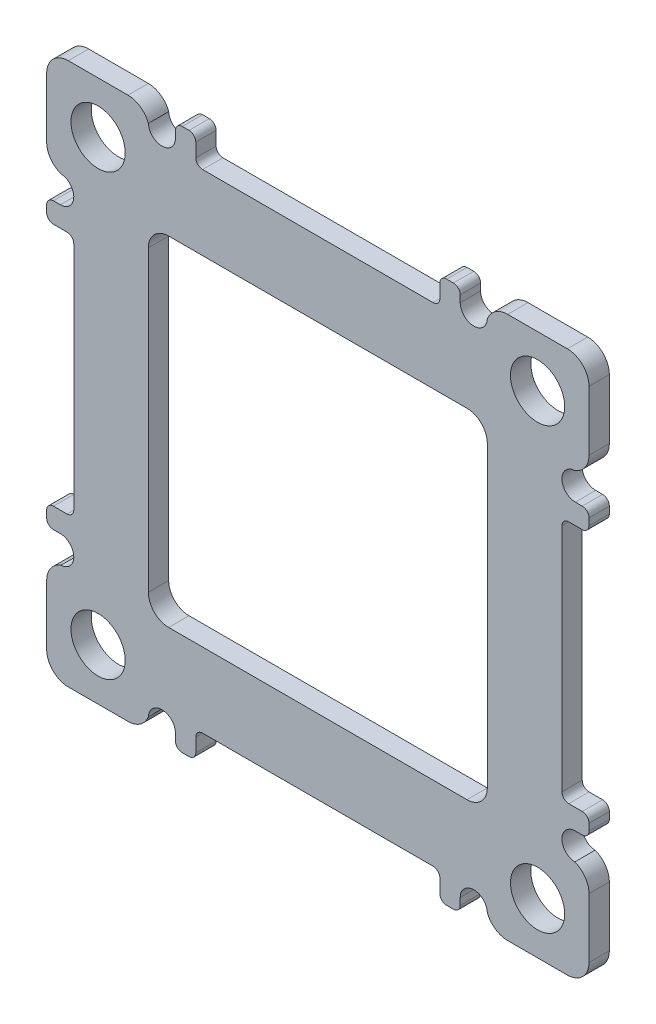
ISO-10303-21;
HEADER;
FILE_DESCRIPTION(('STEP AP214'),'2;1');
FILE_NAME('part.step','',(''),(''),'','','');
FILE_SCHEMA(('AUTOMOTIVE_DESIGN { 1 0 10303 214 1 1 1 1 }'));
ENDSEC;
DATA;
#1=APPLICATION_CONTEXT('core data for automotive mechanical design processes');
#2=APPLICATION_PROTOCOL_DEFINITION('international standard','automotive_design',2000,#1);
#3=PRODUCT_CONTEXT('',#1,'mechanical');
#4=PRODUCT('Part','Part','',(#3));
#5=PRODUCT_RELATED_PRODUCT_CATEGORY('part','',(#4));
#6=PRODUCT_DEFINITION_FORMATION('','',#4);
#7=PRODUCT_DEFINITION_CONTEXT('part definition',#1,'design');
#8=PRODUCT_DEFINITION('design','',#6,#7);
#9=PRODUCT_DEFINITION_SHAPE('','',#8);
#10=(LENGTH_UNIT() NAMED_UNIT(*) SI_UNIT(.MILLI.,.METRE.));
#11=(NAMED_UNIT(*) PLANE_ANGLE_UNIT() SI_UNIT($,.RADIAN.));
#12=(NAMED_UNIT(*) SI_UNIT($,.STERADIAN.) SOLID_ANGLE_UNIT());
#13=UNCERTAINTY_MEASURE_WITH_UNIT(LENGTH_MEASURE(1.E-05),#10,'distance_accuracy_value','');
#14=(GEOMETRIC_REPRESENTATION_CONTEXT(3) GLOBAL_UNCERTAINTY_ASSIGNED_CONTEXT((#13)) GLOBAL_UNIT_ASSIGNED_CONTEXT((#10,
#11,#12)) REPRESENTATION_CONTEXT('',''));
#15=CARTESIAN_POINT('',(0.,0.,0.));
#16=DIRECTION('',(0.,0.,1.));
#17=DIRECTION('',(1.,0.,0.));
#18=AXIS2_PLACEMENT_3D('',#15,#16,#17);
#19=CARTESIAN_POINT('',(-37.9885414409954,-21.5025846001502,3.));
#20=DIRECTION('',(0.,0.,-1.));
#21=DIRECTION('',(-1.,0.,0.));
#22=AXIS2_PLACEMENT_3D('',#19,#20,#21);
#23=CYLINDRICAL_SURFACE('',#22,0.5);
#24=CARTESIAN_POINT('',(-37.9885414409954,-21.5025846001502,0.));
#25=DIRECTION('',(0.,0.,1.));
#26=DIRECTION('',(1.,0.,0.));
#27=AXIS2_PLACEMENT_3D('',#24,#25,#26);
#28=CIRCLE('',#27,0.5);
#29=CARTESIAN_POINT('',(-37.9885414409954,-21.0025846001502,0.));
#30=VERTEX_POINT('',#29);
#31=CARTESIAN_POINT('',(-37.9847219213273,-21.0025991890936,0.));
#32=VERTEX_POINT('',#31);
#33=EDGE_CURVE('E688',#30,#32,#28,.F.);
#34=ORIENTED_EDGE('',*,*,#33,.T.);
#35=DIRECTION('',(0.,0.,-1.));
#36=VECTOR('',#35,1.);
#37=CARTESIAN_POINT('',(-37.9847219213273,-21.0025991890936,3.));
#38=LINE('',#37,#36);
#39=CARTESIAN_POINT('',(-37.9847219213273,-21.0025991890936,3.));
#40=VERTEX_POINT('',#39);
#41=EDGE_CURVE('E11',#40,#32,#38,.T.);
#42=ORIENTED_EDGE('',*,*,#41,.F.);
#43=CARTESIAN_POINT('',(-37.9885414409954,-21.5025846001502,3.));
#44=DIRECTION('',(0.,0.,1.));
#45=DIRECTION('',(1.,0.,0.));
#46=AXIS2_PLACEMENT_3D('',#43,#44,#45);
#47=CIRCLE('',#46,0.5);
#48=CARTESIAN_POINT('',(-37.9885414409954,-21.0025846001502,3.));
#49=VERTEX_POINT('',#48);
#50=EDGE_CURVE('E1183',#49,#40,#47,.F.);
#51=ORIENTED_EDGE('',*,*,#50,.F.);
#52=DIRECTION('',(0.,0.,-1.));
#53=VECTOR('',#52,1.);
#54=CARTESIAN_POINT('',(-37.9885414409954,-21.0025846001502,3.));
#55=LINE('',#54,#53);
#56=EDGE_CURVE('E54',#49,#30,#55,.T.);
#57=ORIENTED_EDGE('',*,*,#56,.T.);
#58=EDGE_LOOP('',(#34,#42,#51,#57));
#59=FACE_BOUND('',#58,.T.);
#60=ADVANCED_FACE('F35',(#59),#23,.F.);
#61=CARTESIAN_POINT('',(-38.,-23.0025408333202,3.));
#62=DIRECTION('',(0.,0.,-1.));
#63=DIRECTION('',(-1.,0.,0.));
#64=AXIS2_PLACEMENT_3D('',#61,#62,#63);
#65=CYLINDRICAL_SURFACE('',#64,1.99999999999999);
#66=CARTESIAN_POINT('',(-38.,-23.0025408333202,0.));
#67=DIRECTION('',(0.,0.,1.));
#68=DIRECTION('',(1.,0.,0.));
#69=AXIS2_PLACEMENT_3D('',#66,#67,#68);
#70=CIRCLE('',#69,1.99999999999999);
#71=CARTESIAN_POINT('',(-37.8992186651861,-25.,0.));
#72=VERTEX_POINT('',#71);
#73=EDGE_CURVE('E690',#32,#72,#70,.F.);
#74=ORIENTED_EDGE('',*,*,#73,.T.);
#75=DIRECTION('',(0.,0.,-1.));
#76=VECTOR('',#75,1.);
#77=CARTESIAN_POINT('',(-37.8992186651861,-25.,3.));
#78=LINE('',#77,#76);
#79=CARTESIAN_POINT('',(-37.8992186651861,-25.,3.));
#80=VERTEX_POINT('',#79);
#81=EDGE_CURVE('E45',#80,#72,#78,.T.);
#82=ORIENTED_EDGE('',*,*,#81,.F.);
#83=CARTESIAN_POINT('',(-38.,-23.0025408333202,3.));
#84=DIRECTION('',(0.,0.,1.));
#85=DIRECTION('',(1.,0.,0.));
#86=AXIS2_PLACEMENT_3D('',#83,#84,#85);
#87=CIRCLE('',#86,1.99999999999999);
#88=EDGE_CURVE('E1185',#40,#80,#87,.F.);
#89=ORIENTED_EDGE('',*,*,#88,.F.);
#90=ORIENTED_EDGE('',*,*,#41,.T.);
#91=EDGE_LOOP('',(#74,#82,#89,#90));
#92=FACE_BOUND('',#91,.T.);
#93=ADVANCED_FACE('F1415',(#92),#65,.F.);
#94=CARTESIAN_POINT('',(-36.8038566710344,-28.0025846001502,3.));
#95=DIRECTION('',(0.,0.,-1.));
#96=DIRECTION('',(-1.,0.,0.));
#97=AXIS2_PLACEMENT_3D('',#94,#95,#96);
#98=CYLINDRICAL_SURFACE('',#97,3.19614332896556);
#99=CARTESIAN_POINT('',(-36.8038566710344,-28.0025846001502,0.));
#100=DIRECTION('',(0.,0.,1.));
#101=DIRECTION('',(1.,0.,0.));
#102=AXIS2_PLACEMENT_3D('',#99,#100,#101);
#103=CIRCLE('',#102,3.19614332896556);
#104=CARTESIAN_POINT('',(-40.,-28.0025846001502,0.));
#105=VERTEX_POINT('',#104);
#106=EDGE_CURVE('E693',#105,#72,#103,.F.);
#107=ORIENTED_EDGE('',*,*,#106,.F.);
#108=DIRECTION('',(0.,0.,-1.));
#109=VECTOR('',#108,1.);
#110=CARTESIAN_POINT('',(-40.,-28.0025846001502,3.));
#111=LINE('',#110,#109);
#112=CARTESIAN_POINT('',(-40.,-28.0025846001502,3.));
#113=VERTEX_POINT('',#112);
#114=EDGE_CURVE('E1114',#113,#105,#111,.T.);
#115=ORIENTED_EDGE('',*,*,#114,.F.);
#116=CARTESIAN_POINT('',(-36.8038566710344,-28.0025846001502,3.));
#117=DIRECTION('',(0.,0.,1.));
#118=DIRECTION('',(1.,0.,0.));
#119=AXIS2_PLACEMENT_3D('',#116,#117,#118);
#120=CIRCLE('',#119,3.19614332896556);
#121=EDGE_CURVE('E1187',#113,#80,#120,.F.);
#122=ORIENTED_EDGE('',*,*,#121,.T.);
#123=ORIENTED_EDGE('',*,*,#81,.T.);
#124=EDGE_LOOP('',(#107,#115,#122,#123));
#125=FACE_BOUND('',#124,.T.);
#126=ADVANCED_FACE('F1420',(#125),#98,.T.);
#127=CARTESIAN_POINT('',(-40.,0.,3.));
#128=DIRECTION('',(-1.,0.,0.));
#129=DIRECTION('',(0.,0.,1.));
#130=AXIS2_PLACEMENT_3D('',#127,#128,#129);
#131=PLANE('',#130);
#132=DIRECTION('',(0.,1.,0.));
#133=VECTOR('',#132,1.);
#134=CARTESIAN_POINT('',(-40.,0.,0.));
#135=LINE('',#134,#133);
#136=CARTESIAN_POINT('',(-40.,-36.8038566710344,0.));
#137=VERTEX_POINT('',#136);
#138=EDGE_CURVE('E696',#137,#105,#135,.T.);
#139=ORIENTED_EDGE('',*,*,#138,.F.);
#140=DIRECTION('',(0.,0.,-1.));
#141=VECTOR('',#140,1.);
#142=CARTESIAN_POINT('',(-40.,-36.8038566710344,3.));
#143=LINE('',#142,#141);
#144=CARTESIAN_POINT('',(-40.,-36.8038566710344,3.));
#145=VERTEX_POINT('',#144);
#146=EDGE_CURVE('E1112',#145,#137,#143,.T.);
#147=ORIENTED_EDGE('',*,*,#146,.F.);
#148=DIRECTION('',(0.,1.,0.));
#149=VECTOR('',#148,1.);
#150=CARTESIAN_POINT('',(-40.,0.,3.));
#151=LINE('',#150,#149);
#152=EDGE_CURVE('E1190',#145,#113,#151,.T.);
#153=ORIENTED_EDGE('',*,*,#152,.T.);
#154=ORIENTED_EDGE('',*,*,#114,.T.);
#155=EDGE_LOOP('',(#139,#147,#153,#154));
#156=FACE_BOUND('',#155,.T.);
#157=ADVANCED_FACE('F1765',(#156),#131,.T.);
#158=CARTESIAN_POINT('',(-36.8038566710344,-36.8038566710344,3.));
#159=DIRECTION('',(0.,0.,-1.));
#160=DIRECTION('',(-1.,0.,0.));
#161=AXIS2_PLACEMENT_3D('',#158,#159,#160);
#162=CYLINDRICAL_SURFACE('',#161,3.19614332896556);
#163=CARTESIAN_POINT('',(-36.8038566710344,-36.8038566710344,0.));
#164=DIRECTION('',(0.,0.,1.));
#165=DIRECTION('',(1.,0.,0.));
#166=AXIS2_PLACEMENT_3D('',#163,#164,#165);
#167=CIRCLE('',#166,3.19614332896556);
#168=CARTESIAN_POINT('',(-36.8038566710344,-40.,0.));
#169=VERTEX_POINT('',#168);
#170=EDGE_CURVE('E699',#137,#169,#167,.T.);
#171=ORIENTED_EDGE('',*,*,#170,.T.);
#172=DIRECTION('',(0.,0.,-1.));
#173=VECTOR('',#172,1.);
#174=CARTESIAN_POINT('',(-36.8038566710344,-40.,3.));
#175=LINE('',#174,#173);
#176=CARTESIAN_POINT('',(-36.8038566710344,-40.,3.));
#177=VERTEX_POINT('',#176);
#178=EDGE_CURVE('E1109',#177,#169,#175,.T.);
#179=ORIENTED_EDGE('',*,*,#178,.F.);
#180=CARTESIAN_POINT('',(-36.8038566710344,-36.8038566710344,3.));
#181=DIRECTION('',(0.,0.,1.));
#182=DIRECTION('',(1.,0.,0.));
#183=AXIS2_PLACEMENT_3D('',#180,#181,#182);
#184=CIRCLE('',#183,3.19614332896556);
#185=EDGE_CURVE('E1193',#145,#177,#184,.T.);
#186=ORIENTED_EDGE('',*,*,#185,.F.);
#187=ORIENTED_EDGE('',*,*,#146,.T.);
#188=EDGE_LOOP('',(#171,#179,#186,#187));
#189=FACE_BOUND('',#188,.T.);
#190=ADVANCED_FACE('F1761',(#189),#162,.T.);
#191=CARTESIAN_POINT('',(0.,-39.9999999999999,3.));
#192=DIRECTION('',(0.,1.,0.));
#193=DIRECTION('',(-1.,0.,0.));
#194=AXIS2_PLACEMENT_3D('',#191,#192,#193);
#195=PLANE('',#194);
#196=DIRECTION('',(1.,0.,0.));
#197=VECTOR('',#196,1.);
#198=CARTESIAN_POINT('',(0.,-39.9999999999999,0.));
#199=LINE('',#198,#197);
#200=CARTESIAN_POINT('',(-28.0025846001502,-40.,0.));
#201=VERTEX_POINT('',#200);
#202=EDGE_CURVE('E701',#169,#201,#199,.T.);
#203=ORIENTED_EDGE('',*,*,#202,.T.);
#204=DIRECTION('',(0.,0.,-1.));
#205=VECTOR('',#204,1.);
#206=CARTESIAN_POINT('',(-28.0025846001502,-40.,3.));
#207=LINE('',#206,#205);
#208=CARTESIAN_POINT('',(-28.0025846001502,-40.,3.));
#209=VERTEX_POINT('',#208);
#210=EDGE_CURVE('E1107',#209,#201,#207,.T.);
#211=ORIENTED_EDGE('',*,*,#210,.F.);
#212=DIRECTION('',(1.,0.,0.));
#213=VECTOR('',#212,1.);
#214=CARTESIAN_POINT('',(0.,-39.9999999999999,3.));
#215=LINE('',#214,#213);
#216=EDGE_CURVE('E1195',#177,#209,#215,.T.);
#217=ORIENTED_EDGE('',*,*,#216,.F.);
#218=ORIENTED_EDGE('',*,*,#178,.T.);
#219=EDGE_LOOP('',(#203,#211,#217,#218));
#220=FACE_BOUND('',#219,.T.);
#221=ADVANCED_FACE('F1757',(#220),#195,.F.);
#222=CARTESIAN_POINT('',(-28.0025846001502,-36.8038566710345,3.));
#223=DIRECTION('',(0.,0.,-1.));
#224=DIRECTION('',(-1.,0.,0.));
#225=AXIS2_PLACEMENT_3D('',#222,#223,#224);
#226=CYLINDRICAL_SURFACE('',#225,3.19614332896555);
#227=CARTESIAN_POINT('',(-28.0025846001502,-36.8038566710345,0.));
#228=DIRECTION('',(0.,0.,1.));
#229=DIRECTION('',(1.,0.,0.));
#230=AXIS2_PLACEMENT_3D('',#227,#228,#229);
#231=CIRCLE('',#230,3.19614332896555);
#232=CARTESIAN_POINT('',(-25.,-37.8992186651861,0.));
#233=VERTEX_POINT('',#232);
#234=EDGE_CURVE('E704',#233,#201,#231,.F.);
#235=ORIENTED_EDGE('',*,*,#234,.F.);
#236=DIRECTION('',(0.,0.,-1.));
#237=VECTOR('',#236,1.);
#238=CARTESIAN_POINT('',(-25.,-37.8992186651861,3.));
#239=LINE('',#238,#237);
#240=CARTESIAN_POINT('',(-25.,-37.8992186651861,3.));
#241=VERTEX_POINT('',#240);
#242=EDGE_CURVE('E1105',#241,#233,#239,.T.);
#243=ORIENTED_EDGE('',*,*,#242,.F.);
#244=CARTESIAN_POINT('',(-28.0025846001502,-36.8038566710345,3.));
#245=DIRECTION('',(0.,0.,1.));
#246=DIRECTION('',(1.,0.,0.));
#247=AXIS2_PLACEMENT_3D('',#244,#245,#246);
#248=CIRCLE('',#247,3.19614332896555);
#249=EDGE_CURVE('E1197',#241,#209,#248,.F.);
#250=ORIENTED_EDGE('',*,*,#249,.T.);
#251=ORIENTED_EDGE('',*,*,#210,.T.);
#252=EDGE_LOOP('',(#235,#243,#250,#251));
#253=FACE_BOUND('',#252,.T.);
#254=ADVANCED_FACE('F1753',(#253),#226,.T.);
#255=CARTESIAN_POINT('',(-23.0025408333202,-38.,3.));
#256=DIRECTION('',(0.,0.,-1.));
#257=DIRECTION('',(-1.,0.,0.));
#258=AXIS2_PLACEMENT_3D('',#255,#256,#257);
#259=CYLINDRICAL_SURFACE('',#258,1.99999999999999);
#260=CARTESIAN_POINT('',(-23.0025408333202,-38.,0.));
#261=DIRECTION('',(0.,0.,1.));
#262=DIRECTION('',(1.,0.,0.));
#263=AXIS2_PLACEMENT_3D('',#260,#261,#262);
#264=CIRCLE('',#263,1.99999999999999);
#265=CARTESIAN_POINT('',(-21.0025991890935,-37.9847219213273,0.));
#266=VERTEX_POINT('',#265);
#267=EDGE_CURVE('E707',#266,#233,#264,.T.);
#268=ORIENTED_EDGE('',*,*,#267,.F.);
#269=DIRECTION('',(0.,0.,-1.));
#270=VECTOR('',#269,1.);
#271=CARTESIAN_POINT('',(-21.0025991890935,-37.9847219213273,3.));
#272=LINE('',#271,#270);
#273=CARTESIAN_POINT('',(-21.0025991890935,-37.9847219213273,3.));
#274=VERTEX_POINT('',#273);
#275=EDGE_CURVE('E1103',#274,#266,#272,.T.);
#276=ORIENTED_EDGE('',*,*,#275,.F.);
#277=CARTESIAN_POINT('',(-23.0025408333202,-38.,3.));
#278=DIRECTION('',(0.,0.,1.));
#279=DIRECTION('',(1.,0.,0.));
#280=AXIS2_PLACEMENT_3D('',#277,#278,#279);
#281=CIRCLE('',#280,1.99999999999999);
#282=EDGE_CURVE('E1200',#274,#241,#281,.T.);
#283=ORIENTED_EDGE('',*,*,#282,.T.);
#284=ORIENTED_EDGE('',*,*,#242,.T.);
#285=EDGE_LOOP('',(#268,#276,#283,#284));
#286=FACE_BOUND('',#285,.T.);
#287=ADVANCED_FACE('F1749',(#286),#259,.F.);
#288=CARTESIAN_POINT('',(-21.5025846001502,-37.9885414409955,3.));
#289=DIRECTION('',(0.,0.,-1.));
#290=DIRECTION('',(-1.,0.,0.));
#291=AXIS2_PLACEMENT_3D('',#288,#289,#290);
#292=CYLINDRICAL_SURFACE('',#291,0.500000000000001);
#293=CARTESIAN_POINT('',(-21.5025846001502,-37.9885414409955,0.));
#294=DIRECTION('',(0.,0.,1.));
#295=DIRECTION('',(1.,0.,0.));
#296=AXIS2_PLACEMENT_3D('',#293,#294,#295);
#297=CIRCLE('',#296,0.500000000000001);
#298=CARTESIAN_POINT('',(-21.0025846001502,-37.9885414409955,0.));
#299=VERTEX_POINT('',#298);
#300=EDGE_CURVE('E710',#299,#266,#297,.T.);
#301=ORIENTED_EDGE('',*,*,#300,.F.);
#302=DIRECTION('',(0.,0.,-1.));
#303=VECTOR('',#302,1.);
#304=CARTESIAN_POINT('',(-21.0025846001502,-37.9885414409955,3.));
#305=LINE('',#304,#303);
#306=CARTESIAN_POINT('',(-21.0025846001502,-37.9885414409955,3.));
#307=VERTEX_POINT('',#306);
#308=EDGE_CURVE('E1101',#307,#299,#305,.T.);
#309=ORIENTED_EDGE('',*,*,#308,.F.);
#310=CARTESIAN_POINT('',(-21.5025846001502,-37.9885414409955,3.));
#311=DIRECTION('',(0.,0.,1.));
#312=DIRECTION('',(1.,0.,0.));
#313=AXIS2_PLACEMENT_3D('',#310,#311,#312);
#314=CIRCLE('',#313,0.500000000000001);
#315=EDGE_CURVE('E1203',#307,#274,#314,.T.);
#316=ORIENTED_EDGE('',*,*,#315,.T.);
#317=ORIENTED_EDGE('',*,*,#275,.T.);
#318=EDGE_LOOP('',(#301,#309,#316,#317));
#319=FACE_BOUND('',#318,.T.);
#320=ADVANCED_FACE('F1745',(#319),#292,.F.);
#321=CARTESIAN_POINT('',(-21.0025846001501,0.,3.));
#322=DIRECTION('',(1.,0.,0.));
#323=DIRECTION('',(0.,1.,0.));
#324=AXIS2_PLACEMENT_3D('',#321,#322,#323);
#325=PLANE('',#324);
#326=DIRECTION('',(0.,-1.,0.));
#327=VECTOR('',#326,1.);
#328=CARTESIAN_POINT('',(-21.0025846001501,0.,0.));
#329=LINE('',#328,#327);
#330=CARTESIAN_POINT('',(-21.0025846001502,-39.,0.));
#331=VERTEX_POINT('',#330);
#332=EDGE_CURVE('E713',#299,#331,#329,.T.);
#333=ORIENTED_EDGE('',*,*,#332,.T.);
#334=DIRECTION('',(0.,0.,-1.));
#335=VECTOR('',#334,1.);
#336=CARTESIAN_POINT('',(-21.0025846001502,-39.,3.));
#337=LINE('',#336,#335);
#338=CARTESIAN_POINT('',(-21.0025846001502,-39.,3.));
#339=VERTEX_POINT('',#338);
#340=EDGE_CURVE('E1098',#339,#331,#337,.T.);
#341=ORIENTED_EDGE('',*,*,#340,.F.);
#342=DIRECTION('',(0.,-1.,0.));
#343=VECTOR('',#342,1.);
#344=CARTESIAN_POINT('',(-21.0025846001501,0.,3.));
#345=LINE('',#344,#343);
#346=EDGE_CURVE('E1206',#307,#339,#345,.T.);
#347=ORIENTED_EDGE('',*,*,#346,.F.);
#348=ORIENTED_EDGE('',*,*,#308,.T.);
#349=EDGE_LOOP('',(#333,#341,#347,#348));
#350=FACE_BOUND('',#349,.T.);
#351=ADVANCED_FACE('F1741',(#350),#325,.F.);
#352=CARTESIAN_POINT('',(-20.0025846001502,-39.,3.));
#353=DIRECTION('',(0.,0.,-1.));
#354=DIRECTION('',(-1.,0.,0.));
#355=AXIS2_PLACEMENT_3D('',#352,#353,#354);
#356=CYLINDRICAL_SURFACE('',#355,1.);
#357=CARTESIAN_POINT('',(-20.0025846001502,-39.,0.));
#358=DIRECTION('',(0.,0.,1.));
#359=DIRECTION('',(1.,0.,0.));
#360=AXIS2_PLACEMENT_3D('',#357,#358,#359);
#361=CIRCLE('',#360,1.);
#362=CARTESIAN_POINT('',(-20.0025846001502,-40.,0.));
#363=VERTEX_POINT('',#362);
#364=EDGE_CURVE('E715',#331,#363,#361,.T.);
#365=ORIENTED_EDGE('',*,*,#364,.T.);
#366=DIRECTION('',(0.,0.,-1.));
#367=VECTOR('',#366,1.);
#368=CARTESIAN_POINT('',(-20.0025846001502,-40.,3.));
#369=LINE('',#368,#367);
#370=CARTESIAN_POINT('',(-20.0025846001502,-40.,3.));
#371=VERTEX_POINT('',#370);
#372=EDGE_CURVE('E1095',#371,#363,#369,.T.);
#373=ORIENTED_EDGE('',*,*,#372,.F.);
#374=CARTESIAN_POINT('',(-20.0025846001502,-39.,3.));
#375=DIRECTION('',(0.,0.,1.));
#376=DIRECTION('',(1.,0.,0.));
#377=AXIS2_PLACEMENT_3D('',#374,#375,#376);
#378=CIRCLE('',#377,1.);
#379=EDGE_CURVE('E1208',#339,#371,#378,.T.);
#380=ORIENTED_EDGE('',*,*,#379,.F.);
#381=ORIENTED_EDGE('',*,*,#340,.T.);
#382=EDGE_LOOP('',(#365,#373,#380,#381));
#383=FACE_BOUND('',#382,.T.);
#384=ADVANCED_FACE('F1737',(#383),#356,.T.);
#385=CARTESIAN_POINT('',(0.,-40.,3.));
#386=DIRECTION('',(0.,1.,0.));
#387=DIRECTION('',(0.,0.,1.));
#388=AXIS2_PLACEMENT_3D('',#385,#386,#387);
#389=PLANE('',#388);
#390=DIRECTION('',(1.,0.,0.));
#391=VECTOR('',#390,1.);
#392=CARTESIAN_POINT('',(0.,-40.,0.));
#393=LINE('',#392,#391);
#394=CARTESIAN_POINT('',(-19.0025846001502,-40.,0.));
#395=VERTEX_POINT('',#394);
#396=EDGE_CURVE('E717',#363,#395,#393,.T.);
#397=ORIENTED_EDGE('',*,*,#396,.T.);
#398=DIRECTION('',(0.,0.,-1.));
#399=VECTOR('',#398,1.);
#400=CARTESIAN_POINT('',(-19.0025846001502,-40.,3.));
#401=LINE('',#400,#399);
#402=CARTESIAN_POINT('',(-19.0025846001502,-40.,3.));
#403=VERTEX_POINT('',#402);
#404=EDGE_CURVE('E1093',#403,#395,#401,.T.);
#405=ORIENTED_EDGE('',*,*,#404,.F.);
#406=DIRECTION('',(1.,0.,0.));
#407=VECTOR('',#406,1.);
#408=CARTESIAN_POINT('',(0.,-40.,3.));
#409=LINE('',#408,#407);
#410=EDGE_CURVE('E1210',#371,#403,#409,.T.);
#411=ORIENTED_EDGE('',*,*,#410,.F.);
#412=ORIENTED_EDGE('',*,*,#372,.T.);
#413=EDGE_LOOP('',(#397,#405,#411,#412));
#414=FACE_BOUND('',#413,.T.);
#415=ADVANCED_FACE('F1733',(#414),#389,.F.);
#416=CARTESIAN_POINT('',(-19.0025846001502,-39.,3.));
#417=DIRECTION('',(0.,0.,-1.));
#418=DIRECTION('',(-1.,0.,0.));
#419=AXIS2_PLACEMENT_3D('',#416,#417,#418);
#420=CYLINDRICAL_SURFACE('',#419,1.);
#421=CARTESIAN_POINT('',(-19.0025846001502,-39.,0.));
#422=DIRECTION('',(0.,0.,1.));
#423=DIRECTION('',(1.,0.,0.));
#424=AXIS2_PLACEMENT_3D('',#421,#422,#423);
#425=CIRCLE('',#424,1.);
#426=CARTESIAN_POINT('',(-18.0025846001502,-39.,0.));
#427=VERTEX_POINT('',#426);
#428=EDGE_CURVE('E720',#427,#395,#425,.F.);
#429=ORIENTED_EDGE('',*,*,#428,.F.);
#430=DIRECTION('',(0.,0.,-1.));
#431=VECTOR('',#430,1.);
#432=CARTESIAN_POINT('',(-18.0025846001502,-39.,3.));
#433=LINE('',#432,#431);
#434=CARTESIAN_POINT('',(-18.0025846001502,-39.,3.));
#435=VERTEX_POINT('',#434);
#436=EDGE_CURVE('E1091',#435,#427,#433,.T.);
#437=ORIENTED_EDGE('',*,*,#436,.F.);
#438=CARTESIAN_POINT('',(-19.0025846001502,-39.,3.));
#439=DIRECTION('',(0.,0.,1.));
#440=DIRECTION('',(1.,0.,0.));
#441=AXIS2_PLACEMENT_3D('',#438,#439,#440);
#442=CIRCLE('',#441,1.);
#443=EDGE_CURVE('E1212',#435,#403,#442,.F.);
#444=ORIENTED_EDGE('',*,*,#443,.T.);
#445=ORIENTED_EDGE('',*,*,#404,.T.);
#446=EDGE_LOOP('',(#429,#437,#444,#445));
#447=FACE_BOUND('',#446,.T.);
#448=ADVANCED_FACE('F1729',(#447),#420,.T.);
#449=CARTESIAN_POINT('',(-18.0025846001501,0.,3.));
#450=DIRECTION('',(1.,0.,0.));
#451=DIRECTION('',(0.,1.,0.));
#452=AXIS2_PLACEMENT_3D('',#449,#450,#451);
#453=PLANE('',#452);
#454=DIRECTION('',(0.,-1.,0.));
#455=VECTOR('',#454,1.);
#456=CARTESIAN_POINT('',(-18.0025846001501,0.,0.));
#457=LINE('',#456,#455);
#458=CARTESIAN_POINT('',(-18.0025846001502,-37.,0.));
#459=VERTEX_POINT('',#458);
#460=EDGE_CURVE('E723',#459,#427,#457,.T.);
#461=ORIENTED_EDGE('',*,*,#460,.F.);
#462=DIRECTION('',(0.,0.,-1.));
#463=VECTOR('',#462,1.);
#464=CARTESIAN_POINT('',(-18.0025846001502,-37.,3.));
#465=LINE('',#464,#463);
#466=CARTESIAN_POINT('',(-18.0025846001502,-37.,3.));
#467=VERTEX_POINT('',#466);
#468=EDGE_CURVE('E1089',#467,#459,#465,.T.);
#469=ORIENTED_EDGE('',*,*,#468,.F.);
#470=DIRECTION('',(0.,-1.,0.));
#471=VECTOR('',#470,1.);
#472=CARTESIAN_POINT('',(-18.0025846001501,0.,3.));
#473=LINE('',#472,#471);
#474=EDGE_CURVE('E1215',#467,#435,#473,.T.);
#475=ORIENTED_EDGE('',*,*,#474,.T.);
#476=ORIENTED_EDGE('',*,*,#436,.T.);
#477=EDGE_LOOP('',(#461,#469,#475,#476));
#478=FACE_BOUND('',#477,.T.);
#479=ADVANCED_FACE('F1725',(#478),#453,.T.);
#480=CARTESIAN_POINT('',(-17.0025846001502,-37.,3.));
#481=DIRECTION('',(0.,0.,-1.));
#482=DIRECTION('',(-1.,0.,0.));
#483=AXIS2_PLACEMENT_3D('',#480,#481,#482);
#484=CYLINDRICAL_SURFACE('',#483,0.999999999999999);
#485=CARTESIAN_POINT('',(-17.0025846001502,-37.,0.));
#486=DIRECTION('',(0.,0.,1.));
#487=DIRECTION('',(1.,0.,0.));
#488=AXIS2_PLACEMENT_3D('',#485,#486,#487);
#489=CIRCLE('',#488,0.999999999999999);
#490=CARTESIAN_POINT('',(-17.0025846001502,-36.,0.));
#491=VERTEX_POINT('',#490);
#492=EDGE_CURVE('E726',#491,#459,#489,.T.);
#493=ORIENTED_EDGE('',*,*,#492,.F.);
#494=DIRECTION('',(0.,0.,-1.));
#495=VECTOR('',#494,1.);
#496=CARTESIAN_POINT('',(-17.0025846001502,-36.,3.));
#497=LINE('',#496,#495);
#498=CARTESIAN_POINT('',(-17.0025846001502,-36.,3.));
#499=VERTEX_POINT('',#498);
#500=EDGE_CURVE('E1087',#499,#491,#497,.T.);
#501=ORIENTED_EDGE('',*,*,#500,.F.);
#502=CARTESIAN_POINT('',(-17.0025846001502,-37.,3.));
#503=DIRECTION('',(0.,0.,1.));
#504=DIRECTION('',(1.,0.,0.));
#505=AXIS2_PLACEMENT_3D('',#502,#503,#504);
#506=CIRCLE('',#505,0.999999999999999);
#507=EDGE_CURVE('E1218',#499,#467,#506,.T.);
#508=ORIENTED_EDGE('',*,*,#507,.T.);
#509=ORIENTED_EDGE('',*,*,#468,.T.);
#510=EDGE_LOOP('',(#493,#501,#508,#509));
#511=FACE_BOUND('',#510,.T.);
#512=ADVANCED_FACE('F1721',(#511),#484,.F.);
#513=CARTESIAN_POINT('',(0.,-36.,3.));
#514=DIRECTION('',(0.,1.,0.));
#515=DIRECTION('',(0.,0.,1.));
#516=AXIS2_PLACEMENT_3D('',#513,#514,#515);
#517=PLANE('',#516);
#518=DIRECTION('',(1.,0.,0.));
#519=VECTOR('',#518,1.);
#520=CARTESIAN_POINT('',(0.,-36.,0.));
#521=LINE('',#520,#519);
#522=CARTESIAN_POINT('',(17.0025846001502,-36.,0.));
#523=VERTEX_POINT('',#522);
#524=EDGE_CURVE('E729',#491,#523,#521,.T.);
#525=ORIENTED_EDGE('',*,*,#524,.T.);
#526=DIRECTION('',(0.,0.,-1.));
#527=VECTOR('',#526,1.);
#528=CARTESIAN_POINT('',(17.0025846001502,-36.,3.));
#529=LINE('',#528,#527);
#530=CARTESIAN_POINT('',(17.0025846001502,-36.,3.));
#531=VERTEX_POINT('',#530);
#532=EDGE_CURVE('E1084',#531,#523,#529,.T.);
#533=ORIENTED_EDGE('',*,*,#532,.F.);
#534=DIRECTION('',(1.,0.,0.));
#535=VECTOR('',#534,1.);
#536=CARTESIAN_POINT('',(0.,-36.,3.));
#537=LINE('',#536,#535);
#538=EDGE_CURVE('E1221',#499,#531,#537,.T.);
#539=ORIENTED_EDGE('',*,*,#538,.F.);
#540=ORIENTED_EDGE('',*,*,#500,.T.);
#541=EDGE_LOOP('',(#525,#533,#539,#540));
#542=FACE_BOUND('',#541,.T.);
#543=ADVANCED_FACE('F1717',(#542),#517,.F.);
#544=CARTESIAN_POINT('',(17.0025846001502,-37.,3.));
#545=DIRECTION('',(0.,0.,-1.));
#546=DIRECTION('',(-1.,0.,0.));
#547=AXIS2_PLACEMENT_3D('',#544,#545,#546);
#548=CYLINDRICAL_SURFACE('',#547,0.999999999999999);
#549=CARTESIAN_POINT('',(17.0025846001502,-37.,0.));
#550=DIRECTION('',(0.,0.,1.));
#551=DIRECTION('',(1.,0.,0.));
#552=AXIS2_PLACEMENT_3D('',#549,#550,#551);
#553=CIRCLE('',#552,0.999999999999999);
#554=CARTESIAN_POINT('',(18.0025846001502,-37.,0.));
#555=VERTEX_POINT('',#554);
#556=EDGE_CURVE('E731',#523,#555,#553,.F.);
#557=ORIENTED_EDGE('',*,*,#556,.T.);
#558=DIRECTION('',(0.,0.,-1.));
#559=VECTOR('',#558,1.);
#560=CARTESIAN_POINT('',(18.0025846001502,-37.,3.));
#561=LINE('',#560,#559);
#562=CARTESIAN_POINT('',(18.0025846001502,-37.,3.));
#563=VERTEX_POINT('',#562);
#564=EDGE_CURVE('E1081',#563,#555,#561,.T.);
#565=ORIENTED_EDGE('',*,*,#564,.F.);
#566=CARTESIAN_POINT('',(17.0025846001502,-37.,3.));
#567=DIRECTION('',(0.,0.,1.));
#568=DIRECTION('',(1.,0.,0.));
#569=AXIS2_PLACEMENT_3D('',#566,#567,#568);
#570=CIRCLE('',#569,0.999999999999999);
#571=EDGE_CURVE('E1223',#531,#563,#570,.F.);
#572=ORIENTED_EDGE('',*,*,#571,.F.);
#573=ORIENTED_EDGE('',*,*,#532,.T.);
#574=EDGE_LOOP('',(#557,#565,#572,#573));
#575=FACE_BOUND('',#574,.T.);
#576=ADVANCED_FACE('F1713',(#575),#548,.F.);
#577=CARTESIAN_POINT('',(18.0025846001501,0.,3.));
#578=DIRECTION('',(1.,0.,0.));
#579=DIRECTION('',(0.,1.,0.));
#580=AXIS2_PLACEMENT_3D('',#577,#578,#579);
#581=PLANE('',#580);
#582=DIRECTION('',(0.,-1.,0.));
#583=VECTOR('',#582,1.);
#584=CARTESIAN_POINT('',(18.0025846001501,0.,0.));
#585=LINE('',#584,#583);
#586=CARTESIAN_POINT('',(18.0025846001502,-39.,0.));
#587=VERTEX_POINT('',#586);
#588=EDGE_CURVE('E733',#555,#587,#585,.T.);
#589=ORIENTED_EDGE('',*,*,#588,.T.);
#590=DIRECTION('',(0.,0.,-1.));
#591=VECTOR('',#590,1.);
#592=CARTESIAN_POINT('',(18.0025846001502,-39.,3.));
#593=LINE('',#592,#591);
#594=CARTESIAN_POINT('',(18.0025846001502,-39.,3.));
#595=VERTEX_POINT('',#594);
#596=EDGE_CURVE('E1078',#595,#587,#593,.T.);
#597=ORIENTED_EDGE('',*,*,#596,.F.);
#598=DIRECTION('',(0.,-1.,0.));
#599=VECTOR('',#598,1.);
#600=CARTESIAN_POINT('',(18.0025846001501,0.,3.));
#601=LINE('',#600,#599);
#602=EDGE_CURVE('E1225',#563,#595,#601,.T.);
#603=ORIENTED_EDGE('',*,*,#602,.F.);
#604=ORIENTED_EDGE('',*,*,#564,.T.);
#605=EDGE_LOOP('',(#589,#597,#603,#604));
#606=FACE_BOUND('',#605,.T.);
#607=ADVANCED_FACE('F1709',(#606),#581,.F.);
#608=CARTESIAN_POINT('',(19.0025846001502,-39.,3.));
#609=DIRECTION('',(0.,0.,-1.));
#610=DIRECTION('',(-1.,0.,0.));
#611=AXIS2_PLACEMENT_3D('',#608,#609,#610);
#612=CYLINDRICAL_SURFACE('',#611,1.);
#613=CARTESIAN_POINT('',(19.0025846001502,-39.,0.));
#614=DIRECTION('',(0.,0.,1.));
#615=DIRECTION('',(1.,0.,0.));
#616=AXIS2_PLACEMENT_3D('',#613,#614,#615);
#617=CIRCLE('',#616,1.);
#618=CARTESIAN_POINT('',(19.0025846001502,-40.,0.));
#619=VERTEX_POINT('',#618);
#620=EDGE_CURVE('E735',#587,#619,#617,.T.);
#621=ORIENTED_EDGE('',*,*,#620,.T.);
#622=DIRECTION('',(0.,0.,-1.));
#623=VECTOR('',#622,1.);
#624=CARTESIAN_POINT('',(19.0025846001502,-40.,3.));
#625=LINE('',#624,#623);
#626=CARTESIAN_POINT('',(19.0025846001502,-40.,3.));
#627=VERTEX_POINT('',#626);
#628=EDGE_CURVE('E1076',#627,#619,#625,.T.);
#629=ORIENTED_EDGE('',*,*,#628,.F.);
#630=CARTESIAN_POINT('',(19.0025846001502,-39.,3.));
#631=DIRECTION('',(0.,0.,1.));
#632=DIRECTION('',(1.,0.,0.));
#633=AXIS2_PLACEMENT_3D('',#630,#631,#632);
#634=CIRCLE('',#633,1.);
#635=EDGE_CURVE('E1227',#595,#627,#634,.T.);
#636=ORIENTED_EDGE('',*,*,#635,.F.);
#637=ORIENTED_EDGE('',*,*,#596,.T.);
#638=EDGE_LOOP('',(#621,#629,#636,#637));
#639=FACE_BOUND('',#638,.T.);
#640=ADVANCED_FACE('F1705',(#639),#612,.T.);
#641=CARTESIAN_POINT('',(0.,-40.,3.));
#642=DIRECTION('',(0.,-1.,0.));
#643=DIRECTION('',(0.,0.,-1.));
#644=AXIS2_PLACEMENT_3D('',#641,#642,#643);
#645=PLANE('',#644);
#646=DIRECTION('',(-1.,0.,0.));
#647=VECTOR('',#646,1.);
#648=CARTESIAN_POINT('',(0.,-40.,0.));
#649=LINE('',#648,#647);
#650=CARTESIAN_POINT('',(20.0025846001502,-40.,0.));
#651=VERTEX_POINT('',#650);
#652=EDGE_CURVE('E738',#651,#619,#649,.T.);
#653=ORIENTED_EDGE('',*,*,#652,.F.);
#654=DIRECTION('',(0.,0.,-1.));
#655=VECTOR('',#654,1.);
#656=CARTESIAN_POINT('',(20.0025846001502,-40.,3.));
#657=LINE('',#656,#655);
#658=CARTESIAN_POINT('',(20.0025846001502,-40.,3.));
#659=VERTEX_POINT('',#658);
#660=EDGE_CURVE('E1074',#659,#651,#657,.T.);
#661=ORIENTED_EDGE('',*,*,#660,.F.);
#662=DIRECTION('',(-1.,0.,0.));
#663=VECTOR('',#662,1.);
#664=CARTESIAN_POINT('',(0.,-40.,3.));
#665=LINE('',#664,#663);
#666=EDGE_CURVE('E1229',#659,#627,#665,.T.);
#667=ORIENTED_EDGE('',*,*,#666,.T.);
#668=ORIENTED_EDGE('',*,*,#628,.T.);
#669=EDGE_LOOP('',(#653,#661,#667,#668));
#670=FACE_BOUND('',#669,.T.);
#671=ADVANCED_FACE('F1701',(#670),#645,.T.);
#672=CARTESIAN_POINT('',(20.0025846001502,-39.,3.));
#673=DIRECTION('',(0.,0.,-1.));
#674=DIRECTION('',(-1.,0.,0.));
#675=AXIS2_PLACEMENT_3D('',#672,#673,#674);
#676=CYLINDRICAL_SURFACE('',#675,1.);
#677=CARTESIAN_POINT('',(20.0025846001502,-39.,0.));
#678=DIRECTION('',(0.,0.,1.));
#679=DIRECTION('',(1.,0.,0.));
#680=AXIS2_PLACEMENT_3D('',#677,#678,#679);
#681=CIRCLE('',#680,1.);
#682=CARTESIAN_POINT('',(21.0025846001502,-39.,0.));
#683=VERTEX_POINT('',#682);
#684=EDGE_CURVE('E741',#683,#651,#681,.F.);
#685=ORIENTED_EDGE('',*,*,#684,.F.);
#686=DIRECTION('',(0.,0.,-1.));
#687=VECTOR('',#686,1.);
#688=CARTESIAN_POINT('',(21.0025846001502,-39.,3.));
#689=LINE('',#688,#687);
#690=CARTESIAN_POINT('',(21.0025846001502,-39.,3.));
#691=VERTEX_POINT('',#690);
#692=EDGE_CURVE('E1072',#691,#683,#689,.T.);
#693=ORIENTED_EDGE('',*,*,#692,.F.);
#694=CARTESIAN_POINT('',(20.0025846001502,-39.,3.));
#695=DIRECTION('',(0.,0.,1.));
#696=DIRECTION('',(1.,0.,0.));
#697=AXIS2_PLACEMENT_3D('',#694,#695,#696);
#698=CIRCLE('',#697,1.);
#699=EDGE_CURVE('E1232',#691,#659,#698,.F.);
#700=ORIENTED_EDGE('',*,*,#699,.T.);
#701=ORIENTED_EDGE('',*,*,#660,.T.);
#702=EDGE_LOOP('',(#685,#693,#700,#701));
#703=FACE_BOUND('',#702,.T.);
#704=ADVANCED_FACE('F1697',(#703),#676,.T.);
#705=CARTESIAN_POINT('',(21.0025846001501,0.,3.));
#706=DIRECTION('',(1.,0.,0.));
#707=DIRECTION('',(0.,1.,0.));
#708=AXIS2_PLACEMENT_3D('',#705,#706,#707);
#709=PLANE('',#708);
#710=DIRECTION('',(0.,-1.,0.));
#711=VECTOR('',#710,1.);
#712=CARTESIAN_POINT('',(21.0025846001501,0.,0.));
#713=LINE('',#712,#711);
#714=CARTESIAN_POINT('',(21.0025846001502,-37.9885414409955,0.));
#715=VERTEX_POINT('',#714);
#716=EDGE_CURVE('E744',#715,#683,#713,.T.);
#717=ORIENTED_EDGE('',*,*,#716,.F.);
#718=DIRECTION('',(0.,0.,-1.));
#719=VECTOR('',#718,1.);
#720=CARTESIAN_POINT('',(21.0025846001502,-37.9885414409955,3.));
#721=LINE('',#720,#719);
#722=CARTESIAN_POINT('',(21.0025846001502,-37.9885414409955,3.));
#723=VERTEX_POINT('',#722);
#724=EDGE_CURVE('E1070',#723,#715,#721,.T.);
#725=ORIENTED_EDGE('',*,*,#724,.F.);
#726=DIRECTION('',(0.,-1.,0.));
#727=VECTOR('',#726,1.);
#728=CARTESIAN_POINT('',(21.0025846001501,0.,3.));
#729=LINE('',#728,#727);
#730=EDGE_CURVE('E1235',#723,#691,#729,.T.);
#731=ORIENTED_EDGE('',*,*,#730,.T.);
#732=ORIENTED_EDGE('',*,*,#692,.T.);
#733=EDGE_LOOP('',(#717,#725,#731,#732));
#734=FACE_BOUND('',#733,.T.);
#735=ADVANCED_FACE('F1693',(#734),#709,.T.);
#736=CARTESIAN_POINT('',(21.5025846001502,-37.9885414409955,3.));
#737=DIRECTION('',(0.,0.,-1.));
#738=DIRECTION('',(-1.,0.,0.));
#739=AXIS2_PLACEMENT_3D('',#736,#737,#738);
#740=CYLINDRICAL_SURFACE('',#739,0.500000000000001);
#741=CARTESIAN_POINT('',(21.5025846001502,-37.9885414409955,0.));
#742=DIRECTION('',(0.,0.,1.));
#743=DIRECTION('',(1.,0.,0.));
#744=AXIS2_PLACEMENT_3D('',#741,#742,#743);
#745=CIRCLE('',#744,0.500000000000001);
#746=CARTESIAN_POINT('',(21.0025991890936,-37.9847219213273,0.));
#747=VERTEX_POINT('',#746);
#748=EDGE_CURVE('E747',#715,#747,#745,.F.);
#749=ORIENTED_EDGE('',*,*,#748,.T.);
#750=DIRECTION('',(0.,0.,-1.));
#751=VECTOR('',#750,1.);
#752=CARTESIAN_POINT('',(21.0025991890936,-37.9847219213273,3.));
#753=LINE('',#752,#751);
#754=CARTESIAN_POINT('',(21.0025991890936,-37.9847219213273,3.));
#755=VERTEX_POINT('',#754);
#756=EDGE_CURVE('E1067',#755,#747,#753,.T.);
#757=ORIENTED_EDGE('',*,*,#756,.F.);
#758=CARTESIAN_POINT('',(21.5025846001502,-37.9885414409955,3.));
#759=DIRECTION('',(0.,0.,1.));
#760=DIRECTION('',(1.,0.,0.));
#761=AXIS2_PLACEMENT_3D('',#758,#759,#760);
#762=CIRCLE('',#761,0.500000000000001);
#763=EDGE_CURVE('E1238',#723,#755,#762,.F.);
#764=ORIENTED_EDGE('',*,*,#763,.F.);
#765=ORIENTED_EDGE('',*,*,#724,.T.);
#766=EDGE_LOOP('',(#749,#757,#764,#765));
#767=FACE_BOUND('',#766,.T.);
#768=ADVANCED_FACE('F1689',(#767),#740,.F.);
#769=CARTESIAN_POINT('',(23.0025408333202,-38.,3.));
#770=DIRECTION('',(0.,0.,-1.));
#771=DIRECTION('',(-1.,0.,0.));
#772=AXIS2_PLACEMENT_3D('',#769,#770,#771);
#773=CYLINDRICAL_SURFACE('',#772,1.99999999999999);
#774=CARTESIAN_POINT('',(23.0025408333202,-38.,0.));
#775=DIRECTION('',(0.,0.,1.));
#776=DIRECTION('',(1.,0.,0.));
#777=AXIS2_PLACEMENT_3D('',#774,#775,#776);
#778=CIRCLE('',#777,1.99999999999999);
#779=CARTESIAN_POINT('',(25.,-37.8992186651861,0.));
#780=VERTEX_POINT('',#779);
#781=EDGE_CURVE('E749',#747,#780,#778,.F.);
#782=ORIENTED_EDGE('',*,*,#781,.T.);
#783=DIRECTION('',(0.,0.,-1.));
#784=VECTOR('',#783,1.);
#785=CARTESIAN_POINT('',(25.,-37.8992186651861,3.));
#786=LINE('',#785,#784);
#787=CARTESIAN_POINT('',(25.,-37.8992186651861,3.));
#788=VERTEX_POINT('',#787);
#789=EDGE_CURVE('E1064',#788,#780,#786,.T.);
#790=ORIENTED_EDGE('',*,*,#789,.F.);
#791=CARTESIAN_POINT('',(23.0025408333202,-38.,3.));
#792=DIRECTION('',(0.,0.,1.));
#793=DIRECTION('',(1.,0.,0.));
#794=AXIS2_PLACEMENT_3D('',#791,#792,#793);
#795=CIRCLE('',#794,1.99999999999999);
#796=EDGE_CURVE('E1240',#755,#788,#795,.F.);
#797=ORIENTED_EDGE('',*,*,#796,.F.);
#798=ORIENTED_EDGE('',*,*,#756,.T.);
#799=EDGE_LOOP('',(#782,#790,#797,#798));
#800=FACE_BOUND('',#799,.T.);
#801=ADVANCED_FACE('F1685',(#800),#773,.F.);
#802=CARTESIAN_POINT('',(28.0025846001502,-36.8038566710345,3.));
#803=DIRECTION('',(0.,0.,-1.));
#804=DIRECTION('',(-1.,0.,0.));
#805=AXIS2_PLACEMENT_3D('',#802,#803,#804);
#806=CYLINDRICAL_SURFACE('',#805,3.19614332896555);
#807=CARTESIAN_POINT('',(28.0025846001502,-36.8038566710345,0.));
#808=DIRECTION('',(0.,0.,1.));
#809=DIRECTION('',(1.,0.,0.));
#810=AXIS2_PLACEMENT_3D('',#807,#808,#809);
#811=CIRCLE('',#810,3.19614332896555);
#812=CARTESIAN_POINT('',(28.0025846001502,-40.,0.));
#813=VERTEX_POINT('',#812);
#814=EDGE_CURVE('E751',#780,#813,#811,.T.);
#815=ORIENTED_EDGE('',*,*,#814,.T.);
#816=DIRECTION('',(0.,0.,-1.));
#817=VECTOR('',#816,1.);
#818=CARTESIAN_POINT('',(28.0025846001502,-40.,3.));
#819=LINE('',#818,#817);
#820=CARTESIAN_POINT('',(28.0025846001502,-40.,3.));
#821=VERTEX_POINT('',#820);
#822=EDGE_CURVE('E1061',#821,#813,#819,.T.);
#823=ORIENTED_EDGE('',*,*,#822,.F.);
#824=CARTESIAN_POINT('',(28.0025846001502,-36.8038566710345,3.));
#825=DIRECTION('',(0.,0.,1.));
#826=DIRECTION('',(1.,0.,0.));
#827=AXIS2_PLACEMENT_3D('',#824,#825,#826);
#828=CIRCLE('',#827,3.19614332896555);
#829=EDGE_CURVE('E1242',#788,#821,#828,.T.);
#830=ORIENTED_EDGE('',*,*,#829,.F.);
#831=ORIENTED_EDGE('',*,*,#789,.T.);
#832=EDGE_LOOP('',(#815,#823,#830,#831));
#833=FACE_BOUND('',#832,.T.);
#834=ADVANCED_FACE('F1681',(#833),#806,.T.);
#835=CARTESIAN_POINT('',(-1.48591681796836E-13,-39.9999999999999,3.));
#836=DIRECTION('',(0.,1.,0.));
#837=DIRECTION('',(-1.,0.,0.));
#838=AXIS2_PLACEMENT_3D('',#835,#836,#837);
#839=PLANE('',#838);
#840=DIRECTION('',(1.,0.,0.));
#841=VECTOR('',#840,1.);
#842=CARTESIAN_POINT('',(-1.48591681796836E-13,-39.9999999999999,0.));
#843=LINE('',#842,#841);
#844=CARTESIAN_POINT('',(36.8038566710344,-40.,0.));
#845=VERTEX_POINT('',#844);
#846=EDGE_CURVE('E753',#813,#845,#843,.T.);
#847=ORIENTED_EDGE('',*,*,#846,.T.);
#848=DIRECTION('',(0.,0.,-1.));
#849=VECTOR('',#848,1.);
#850=CARTESIAN_POINT('',(36.8038566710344,-40.,3.));
#851=LINE('',#850,#849);
#852=CARTESIAN_POINT('',(36.8038566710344,-40.,3.));
#853=VERTEX_POINT('',#852);
#854=EDGE_CURVE('E1058',#853,#845,#851,.T.);
#855=ORIENTED_EDGE('',*,*,#854,.F.);
#856=DIRECTION('',(1.,0.,0.));
#857=VECTOR('',#856,1.);
#858=CARTESIAN_POINT('',(-1.48591681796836E-13,-39.9999999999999,3.));
#859=LINE('',#858,#857);
#860=EDGE_CURVE('E1244',#821,#853,#859,.T.);
#861=ORIENTED_EDGE('',*,*,#860,.F.);
#862=ORIENTED_EDGE('',*,*,#822,.T.);
#863=EDGE_LOOP('',(#847,#855,#861,#862));
#864=FACE_BOUND('',#863,.T.);
#865=ADVANCED_FACE('F1677',(#864),#839,.F.);
#866=CARTESIAN_POINT('',(36.8038566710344,-36.8038566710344,3.));
#867=DIRECTION('',(0.,0.,-1.));
#868=DIRECTION('',(-1.,0.,0.));
#869=AXIS2_PLACEMENT_3D('',#866,#867,#868);
#870=CYLINDRICAL_SURFACE('',#869,3.19614332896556);
#871=CARTESIAN_POINT('',(36.8038566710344,-36.8038566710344,0.));
#872=DIRECTION('',(0.,0.,1.));
#873=DIRECTION('',(1.,0.,0.));
#874=AXIS2_PLACEMENT_3D('',#871,#872,#873);
#875=CIRCLE('',#874,3.19614332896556);
#876=CARTESIAN_POINT('',(40.,-36.8038566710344,0.));
#877=VERTEX_POINT('',#876);
#878=EDGE_CURVE('E755',#845,#877,#875,.T.);
#879=ORIENTED_EDGE('',*,*,#878,.T.);
#880=DIRECTION('',(0.,0.,-1.));
#881=VECTOR('',#880,1.);
#882=CARTESIAN_POINT('',(40.,-36.8038566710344,3.));
#883=LINE('',#882,#881);
#884=CARTESIAN_POINT('',(40.,-36.8038566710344,3.));
#885=VERTEX_POINT('',#884);
#886=EDGE_CURVE('E1055',#885,#877,#883,.T.);
#887=ORIENTED_EDGE('',*,*,#886,.F.);
#888=CARTESIAN_POINT('',(36.8038566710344,-36.8038566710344,3.));
#889=DIRECTION('',(0.,0.,1.));
#890=DIRECTION('',(1.,0.,0.));
#891=AXIS2_PLACEMENT_3D('',#888,#889,#890);
#892=CIRCLE('',#891,3.19614332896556);
#893=EDGE_CURVE('E1246',#853,#885,#892,.T.);
#894=ORIENTED_EDGE('',*,*,#893,.F.);
#895=ORIENTED_EDGE('',*,*,#854,.T.);
#896=EDGE_LOOP('',(#879,#887,#894,#895));
#897=FACE_BOUND('',#896,.T.);
#898=ADVANCED_FACE('F1673',(#897),#870,.T.);
#899=CARTESIAN_POINT('',(40.,0.,3.));
#900=DIRECTION('',(-1.,0.,0.));
#901=DIRECTION('',(0.,0.,1.));
#902=AXIS2_PLACEMENT_3D('',#899,#900,#901);
#903=PLANE('',#902);
#904=DIRECTION('',(0.,1.,0.));
#905=VECTOR('',#904,1.);
#906=CARTESIAN_POINT('',(40.,0.,0.));
#907=LINE('',#906,#905);
#908=CARTESIAN_POINT('',(40.,-28.0025846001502,0.));
#909=VERTEX_POINT('',#908);
#910=EDGE_CURVE('E757',#877,#909,#907,.T.);
#911=ORIENTED_EDGE('',*,*,#910,.T.);
#912=DIRECTION('',(0.,0.,-1.));
#913=VECTOR('',#912,1.);
#914=CARTESIAN_POINT('',(40.,-28.0025846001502,3.));
#915=LINE('',#914,#913);
#916=CARTESIAN_POINT('',(40.,-28.0025846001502,3.));
#917=VERTEX_POINT('',#916);
#918=EDGE_CURVE('E1053',#917,#909,#915,.T.);
#919=ORIENTED_EDGE('',*,*,#918,.F.);
#920=DIRECTION('',(0.,1.,0.));
#921=VECTOR('',#920,1.);
#922=CARTESIAN_POINT('',(40.,0.,3.));
#923=LINE('',#922,#921);
#924=EDGE_CURVE('E1248',#885,#917,#923,.T.);
#925=ORIENTED_EDGE('',*,*,#924,.F.);
#926=ORIENTED_EDGE('',*,*,#886,.T.);
#927=EDGE_LOOP('',(#911,#919,#925,#926));
#928=FACE_BOUND('',#927,.T.);
#929=ADVANCED_FACE('F1669',(#928),#903,.F.);
#930=CARTESIAN_POINT('',(36.8038566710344,-28.0025846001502,3.));
#931=DIRECTION('',(0.,0.,-1.));
#932=DIRECTION('',(-1.,0.,0.));
#933=AXIS2_PLACEMENT_3D('',#930,#931,#932);
#934=CYLINDRICAL_SURFACE('',#933,3.19614332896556);
#935=CARTESIAN_POINT('',(36.8038566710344,-28.0025846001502,0.));
#936=DIRECTION('',(0.,0.,1.));
#937=DIRECTION('',(1.,0.,0.));
#938=AXIS2_PLACEMENT_3D('',#935,#936,#937);
#939=CIRCLE('',#938,3.19614332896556);
#940=CARTESIAN_POINT('',(37.8992186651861,-25.,0.));
#941=VERTEX_POINT('',#940);
#942=EDGE_CURVE('E760',#941,#909,#939,.F.);
#943=ORIENTED_EDGE('',*,*,#942,.F.);
#944=DIRECTION('',(0.,0.,-1.));
#945=VECTOR('',#944,1.);
#946=CARTESIAN_POINT('',(37.8992186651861,-25.,3.));
#947=LINE('',#946,#945);
#948=CARTESIAN_POINT('',(37.8992186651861,-25.,3.));
#949=VERTEX_POINT('',#948);
#950=EDGE_CURVE('E1051',#949,#941,#947,.T.);
#951=ORIENTED_EDGE('',*,*,#950,.F.);
#952=CARTESIAN_POINT('',(36.8038566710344,-28.0025846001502,3.));
#953=DIRECTION('',(0.,0.,1.));
#954=DIRECTION('',(1.,0.,0.));
#955=AXIS2_PLACEMENT_3D('',#952,#953,#954);
#956=CIRCLE('',#955,3.19614332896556);
#957=EDGE_CURVE('E1250',#949,#917,#956,.F.);
#958=ORIENTED_EDGE('',*,*,#957,.T.);
#959=ORIENTED_EDGE('',*,*,#918,.T.);
#960=EDGE_LOOP('',(#943,#951,#958,#959));
#961=FACE_BOUND('',#960,.T.);
#962=ADVANCED_FACE('F1665',(#961),#934,.T.);
#963=CARTESIAN_POINT('',(38.,-23.0025408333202,3.));
#964=DIRECTION('',(0.,0.,-1.));
#965=DIRECTION('',(-1.,0.,0.));
#966=AXIS2_PLACEMENT_3D('',#963,#964,#965);
#967=CYLINDRICAL_SURFACE('',#966,1.99999999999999);
#968=CARTESIAN_POINT('',(38.,-23.0025408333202,0.));
#969=DIRECTION('',(0.,0.,1.));
#970=DIRECTION('',(1.,0.,0.));
#971=AXIS2_PLACEMENT_3D('',#968,#969,#970);
#972=CIRCLE('',#971,1.99999999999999);
#973=CARTESIAN_POINT('',(37.9847219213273,-21.0025991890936,0.));
#974=VERTEX_POINT('',#973);
#975=EDGE_CURVE('E763',#974,#941,#972,.T.);
#976=ORIENTED_EDGE('',*,*,#975,.F.);
#977=DIRECTION('',(0.,0.,-1.));
#978=VECTOR('',#977,1.);
#979=CARTESIAN_POINT('',(37.9847219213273,-21.0025991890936,3.));
#980=LINE('',#979,#978);
#981=CARTESIAN_POINT('',(37.9847219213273,-21.0025991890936,3.));
#982=VERTEX_POINT('',#981);
#983=EDGE_CURVE('E1049',#982,#974,#980,.T.);
#984=ORIENTED_EDGE('',*,*,#983,.F.);
#985=CARTESIAN_POINT('',(38.,-23.0025408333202,3.));
#986=DIRECTION('',(0.,0.,1.));
#987=DIRECTION('',(1.,0.,0.));
#988=AXIS2_PLACEMENT_3D('',#985,#986,#987);
#989=CIRCLE('',#988,1.99999999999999);
#990=EDGE_CURVE('E1253',#982,#949,#989,.T.);
#991=ORIENTED_EDGE('',*,*,#990,.T.);
#992=ORIENTED_EDGE('',*,*,#950,.T.);
#993=EDGE_LOOP('',(#976,#984,#991,#992));
#994=FACE_BOUND('',#993,.T.);
#995=ADVANCED_FACE('F1661',(#994),#967,.F.);
#996=CARTESIAN_POINT('',(37.9885414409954,-21.5025846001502,3.));
#997=DIRECTION('',(0.,0.,-1.));
#998=DIRECTION('',(-1.,0.,0.));
#999=AXIS2_PLACEMENT_3D('',#996,#997,#998);
#1000=CYLINDRICAL_SURFACE('',#999,0.5);
#1001=CARTESIAN_POINT('',(37.9885414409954,-21.5025846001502,0.));
#1002=DIRECTION('',(0.,0.,1.));
#1003=DIRECTION('',(1.,0.,0.));
#1004=AXIS2_PLACEMENT_3D('',#1001,#1002,#1003);
#1005=CIRCLE('',#1004,0.5);
#1006=CARTESIAN_POINT('',(37.9885414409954,-21.0025846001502,0.));
#1007=VERTEX_POINT('',#1006);
#1008=EDGE_CURVE('E766',#1007,#974,#1005,.T.);
#1009=ORIENTED_EDGE('',*,*,#1008,.F.);
#1010=DIRECTION('',(0.,0.,-1.));
#1011=VECTOR('',#1010,1.);
#1012=CARTESIAN_POINT('',(37.9885414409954,-21.0025846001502,3.));
#1013=LINE('',#1012,#1011);
#1014=CARTESIAN_POINT('',(37.9885414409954,-21.0025846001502,3.));
#1015=VERTEX_POINT('',#1014);
#1016=EDGE_CURVE('E1047',#1015,#1007,#1013,.T.);
#1017=ORIENTED_EDGE('',*,*,#1016,.F.);
#1018=CARTESIAN_POINT('',(37.9885414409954,-21.5025846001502,3.));
#1019=DIRECTION('',(0.,0.,1.));
#1020=DIRECTION('',(1.,0.,0.));
#1021=AXIS2_PLACEMENT_3D('',#1018,#1019,#1020);
#1022=CIRCLE('',#1021,0.5);
#1023=EDGE_CURVE('E1256',#1015,#982,#1022,.T.);
#1024=ORIENTED_EDGE('',*,*,#1023,.T.);
#1025=ORIENTED_EDGE('',*,*,#983,.T.);
#1026=EDGE_LOOP('',(#1009,#1017,#1024,#1025));
#1027=FACE_BOUND('',#1026,.T.);
#1028=ADVANCED_FACE('F1657',(#1027),#1000,.F.);
#1029=CARTESIAN_POINT('',(0.,-21.0025846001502,3.));
#1030=DIRECTION('',(0.,1.,0.));
#1031=DIRECTION('',(0.,0.,1.));
#1032=AXIS2_PLACEMENT_3D('',#1029,#1030,#1031);
#1033=PLANE('',#1032);
#1034=DIRECTION('',(1.,0.,0.));
#1035=VECTOR('',#1034,1.);
#1036=CARTESIAN_POINT('',(0.,-21.0025846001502,0.));
#1037=LINE('',#1036,#1035);
#1038=CARTESIAN_POINT('',(39.,-21.0025846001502,0.));
#1039=VERTEX_POINT('',#1038);
#1040=EDGE_CURVE('E769',#1007,#1039,#1037,.T.);
#1041=ORIENTED_EDGE('',*,*,#1040,.T.);
#1042=DIRECTION('',(0.,0.,-1.));
#1043=VECTOR('',#1042,1.);
#1044=CARTESIAN_POINT('',(39.,-21.0025846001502,3.));
#1045=LINE('',#1044,#1043);
#1046=CARTESIAN_POINT('',(39.,-21.0025846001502,3.));
#1047=VERTEX_POINT('',#1046);
#1048=EDGE_CURVE('E1044',#1047,#1039,#1045,.T.);
#1049=ORIENTED_EDGE('',*,*,#1048,.F.);
#1050=DIRECTION('',(1.,0.,0.));
#1051=VECTOR('',#1050,1.);
#1052=CARTESIAN_POINT('',(0.,-21.0025846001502,3.));
#1053=LINE('',#1052,#1051);
#1054=EDGE_CURVE('E1259',#1015,#1047,#1053,.T.);
#1055=ORIENTED_EDGE('',*,*,#1054,.F.);
#1056=ORIENTED_EDGE('',*,*,#1016,.T.);
#1057=EDGE_LOOP('',(#1041,#1049,#1055,#1056));
#1058=FACE_BOUND('',#1057,.T.);
#1059=ADVANCED_FACE('F1653',(#1058),#1033,.F.);
#1060=CARTESIAN_POINT('',(39.,-20.0025846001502,3.));
#1061=DIRECTION('',(0.,0.,-1.));
#1062=DIRECTION('',(-1.,0.,0.));
#1063=AXIS2_PLACEMENT_3D('',#1060,#1061,#1062);
#1064=CYLINDRICAL_SURFACE('',#1063,1.);
#1065=CARTESIAN_POINT('',(39.,-20.0025846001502,0.));
#1066=DIRECTION('',(0.,0.,1.));
#1067=DIRECTION('',(1.,0.,0.));
#1068=AXIS2_PLACEMENT_3D('',#1065,#1066,#1067);
#1069=CIRCLE('',#1068,1.);
#1070=CARTESIAN_POINT('',(40.,-20.0025846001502,0.));
#1071=VERTEX_POINT('',#1070);
#1072=EDGE_CURVE('E771',#1039,#1071,#1069,.T.);
#1073=ORIENTED_EDGE('',*,*,#1072,.T.);
#1074=DIRECTION('',(0.,0.,-1.));
#1075=VECTOR('',#1074,1.);
#1076=CARTESIAN_POINT('',(40.,-20.0025846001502,3.));
#1077=LINE('',#1076,#1075);
#1078=CARTESIAN_POINT('',(40.,-20.0025846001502,3.));
#1079=VERTEX_POINT('',#1078);
#1080=EDGE_CURVE('E1041',#1079,#1071,#1077,.T.);
#1081=ORIENTED_EDGE('',*,*,#1080,.F.);
#1082=CARTESIAN_POINT('',(39.,-20.0025846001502,3.));
#1083=DIRECTION('',(0.,0.,1.));
#1084=DIRECTION('',(1.,0.,0.));
#1085=AXIS2_PLACEMENT_3D('',#1082,#1083,#1084);
#1086=CIRCLE('',#1085,1.);
#1087=EDGE_CURVE('E1261',#1047,#1079,#1086,.T.);
#1088=ORIENTED_EDGE('',*,*,#1087,.F.);
#1089=ORIENTED_EDGE('',*,*,#1048,.T.);
#1090=EDGE_LOOP('',(#1073,#1081,#1088,#1089));
#1091=FACE_BOUND('',#1090,.T.);
#1092=ADVANCED_FACE('F1649',(#1091),#1064,.T.);
#1093=CARTESIAN_POINT('',(40.,0.,3.));
#1094=DIRECTION('',(-1.,0.,0.));
#1095=DIRECTION('',(0.,0.,1.));
#1096=AXIS2_PLACEMENT_3D('',#1093,#1094,#1095);
#1097=PLANE('',#1096);
#1098=DIRECTION('',(0.,1.,0.));
#1099=VECTOR('',#1098,1.);
#1100=CARTESIAN_POINT('',(40.,0.,0.));
#1101=LINE('',#1100,#1099);
#1102=CARTESIAN_POINT('',(40.,-19.0025846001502,0.));
#1103=VERTEX_POINT('',#1102);
#1104=EDGE_CURVE('E773',#1071,#1103,#1101,.T.);
#1105=ORIENTED_EDGE('',*,*,#1104,.T.);
#1106=DIRECTION('',(0.,0.,-1.));
#1107=VECTOR('',#1106,1.);
#1108=CARTESIAN_POINT('',(40.,-19.0025846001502,3.));
#1109=LINE('',#1108,#1107);
#1110=CARTESIAN_POINT('',(40.,-19.0025846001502,3.));
#1111=VERTEX_POINT('',#1110);
#1112=EDGE_CURVE('E1039',#1111,#1103,#1109,.T.);
#1113=ORIENTED_EDGE('',*,*,#1112,.F.);
#1114=DIRECTION('',(0.,1.,0.));
#1115=VECTOR('',#1114,1.);
#1116=CARTESIAN_POINT('',(40.,0.,3.));
#1117=LINE('',#1116,#1115);
#1118=EDGE_CURVE('E1263',#1079,#1111,#1117,.T.);
#1119=ORIENTED_EDGE('',*,*,#1118,.F.);
#1120=ORIENTED_EDGE('',*,*,#1080,.T.);
#1121=EDGE_LOOP('',(#1105,#1113,#1119,#1120));
#1122=FACE_BOUND('',#1121,.T.);
#1123=ADVANCED_FACE('F1645',(#1122),#1097,.F.);
#1124=CARTESIAN_POINT('',(39.,-19.0025846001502,3.));
#1125=DIRECTION('',(0.,0.,-1.));
#1126=DIRECTION('',(-1.,0.,0.));
#1127=AXIS2_PLACEMENT_3D('',#1124,#1125,#1126);
#1128=CYLINDRICAL_SURFACE('',#1127,1.);
#1129=CARTESIAN_POINT('',(39.,-19.0025846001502,0.));
#1130=DIRECTION('',(0.,0.,1.));
#1131=DIRECTION('',(1.,0.,0.));
#1132=AXIS2_PLACEMENT_3D('',#1129,#1130,#1131);
#1133=CIRCLE('',#1132,1.);
#1134=CARTESIAN_POINT('',(39.,-18.0025846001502,0.));
#1135=VERTEX_POINT('',#1134);
#1136=EDGE_CURVE('E776',#1135,#1103,#1133,.F.);
#1137=ORIENTED_EDGE('',*,*,#1136,.F.);
#1138=DIRECTION('',(0.,0.,-1.));
#1139=VECTOR('',#1138,1.);
#1140=CARTESIAN_POINT('',(39.,-18.0025846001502,3.));
#1141=LINE('',#1140,#1139);
#1142=CARTESIAN_POINT('',(39.,-18.0025846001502,3.));
#1143=VERTEX_POINT('',#1142);
#1144=EDGE_CURVE('E1037',#1143,#1135,#1141,.T.);
#1145=ORIENTED_EDGE('',*,*,#1144,.F.);
#1146=CARTESIAN_POINT('',(39.,-19.0025846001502,3.));
#1147=DIRECTION('',(0.,0.,1.));
#1148=DIRECTION('',(1.,0.,0.));
#1149=AXIS2_PLACEMENT_3D('',#1146,#1147,#1148);
#1150=CIRCLE('',#1149,1.);
#1151=EDGE_CURVE('E1265',#1143,#1111,#1150,.F.);
#1152=ORIENTED_EDGE('',*,*,#1151,.T.);
#1153=ORIENTED_EDGE('',*,*,#1112,.T.);
#1154=EDGE_LOOP('',(#1137,#1145,#1152,#1153));
#1155=FACE_BOUND('',#1154,.T.);
#1156=ADVANCED_FACE('F1641',(#1155),#1128,.T.);
#1157=CARTESIAN_POINT('',(-1.24918024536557E-13,-18.00258460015,3.));
#1158=DIRECTION('',(0.,1.,0.));
#1159=DIRECTION('',(-1.,0.,0.));
#1160=AXIS2_PLACEMENT_3D('',#1157,#1158,#1159);
#1161=PLANE('',#1160);
#1162=DIRECTION('',(1.,0.,0.));
#1163=VECTOR('',#1162,1.);
#1164=CARTESIAN_POINT('',(-1.24918024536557E-13,-18.00258460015,0.));
#1165=LINE('',#1164,#1163);
#1166=CARTESIAN_POINT('',(37.,-18.0025846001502,0.));
#1167=VERTEX_POINT('',#1166);
#1168=EDGE_CURVE('E779',#1167,#1135,#1165,.T.);
#1169=ORIENTED_EDGE('',*,*,#1168,.F.);
#1170=DIRECTION('',(0.,0.,-1.));
#1171=VECTOR('',#1170,1.);
#1172=CARTESIAN_POINT('',(37.,-18.0025846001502,3.));
#1173=LINE('',#1172,#1171);
#1174=CARTESIAN_POINT('',(37.,-18.0025846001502,3.));
#1175=VERTEX_POINT('',#1174);
#1176=EDGE_CURVE('E1035',#1175,#1167,#1173,.T.);
#1177=ORIENTED_EDGE('',*,*,#1176,.F.);
#1178=DIRECTION('',(1.,0.,0.));
#1179=VECTOR('',#1178,1.);
#1180=CARTESIAN_POINT('',(-1.24918024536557E-13,-18.00258460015,3.));
#1181=LINE('',#1180,#1179);
#1182=EDGE_CURVE('E1268',#1175,#1143,#1181,.T.);
#1183=ORIENTED_EDGE('',*,*,#1182,.T.);
#1184=ORIENTED_EDGE('',*,*,#1144,.T.);
#1185=EDGE_LOOP('',(#1169,#1177,#1183,#1184));
#1186=FACE_BOUND('',#1185,.T.);
#1187=ADVANCED_FACE('F1637',(#1186),#1161,.T.);
#1188=CARTESIAN_POINT('',(37.,-17.0025846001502,3.));
#1189=DIRECTION('',(0.,0.,-1.));
#1190=DIRECTION('',(-1.,0.,0.));
#1191=AXIS2_PLACEMENT_3D('',#1188,#1189,#1190);
#1192=CYLINDRICAL_SURFACE('',#1191,0.999999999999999);
#1193=CARTESIAN_POINT('',(37.,-17.0025846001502,0.));
#1194=DIRECTION('',(0.,0.,1.));
#1195=DIRECTION('',(1.,0.,0.));
#1196=AXIS2_PLACEMENT_3D('',#1193,#1194,#1195);
#1197=CIRCLE('',#1196,0.999999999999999);
#1198=CARTESIAN_POINT('',(36.,-17.0025846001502,0.));
#1199=VERTEX_POINT('',#1198);
#1200=EDGE_CURVE('E782',#1199,#1167,#1197,.T.);
#1201=ORIENTED_EDGE('',*,*,#1200,.F.);
#1202=DIRECTION('',(0.,0.,-1.));
#1203=VECTOR('',#1202,1.);
#1204=CARTESIAN_POINT('',(36.,-17.0025846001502,3.));
#1205=LINE('',#1204,#1203);
#1206=CARTESIAN_POINT('',(36.,-17.0025846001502,3.));
#1207=VERTEX_POINT('',#1206);
#1208=EDGE_CURVE('E1033',#1207,#1199,#1205,.T.);
#1209=ORIENTED_EDGE('',*,*,#1208,.F.);
#1210=CARTESIAN_POINT('',(37.,-17.0025846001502,3.));
#1211=DIRECTION('',(0.,0.,1.));
#1212=DIRECTION('',(1.,0.,0.));
#1213=AXIS2_PLACEMENT_3D('',#1210,#1211,#1212);
#1214=CIRCLE('',#1213,0.999999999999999);
#1215=EDGE_CURVE('E1271',#1207,#1175,#1214,.T.);
#1216=ORIENTED_EDGE('',*,*,#1215,.T.);
#1217=ORIENTED_EDGE('',*,*,#1176,.T.);
#1218=EDGE_LOOP('',(#1201,#1209,#1216,#1217));
#1219=FACE_BOUND('',#1218,.T.);
#1220=ADVANCED_FACE('F1633',(#1219),#1192,.F.);
#1221=CARTESIAN_POINT('',(36.,0.,3.));
#1222=DIRECTION('',(1.,0.,0.));
#1223=DIRECTION('',(0.,0.,-1.));
#1224=AXIS2_PLACEMENT_3D('',#1221,#1222,#1223);
#1225=PLANE('',#1224);
#1226=DIRECTION('',(0.,-1.,0.));
#1227=VECTOR('',#1226,1.);
#1228=CARTESIAN_POINT('',(36.,0.,0.));
#1229=LINE('',#1228,#1227);
#1230=CARTESIAN_POINT('',(36.,17.0025846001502,0.));
#1231=VERTEX_POINT('',#1230);
#1232=EDGE_CURVE('E785',#1231,#1199,#1229,.T.);
#1233=ORIENTED_EDGE('',*,*,#1232,.F.);
#1234=DIRECTION('',(0.,0.,-1.));
#1235=VECTOR('',#1234,1.);
#1236=CARTESIAN_POINT('',(36.,17.0025846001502,3.));
#1237=LINE('',#1236,#1235);
#1238=CARTESIAN_POINT('',(36.,17.0025846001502,3.));
#1239=VERTEX_POINT('',#1238);
#1240=EDGE_CURVE('E1031',#1239,#1231,#1237,.T.);
#1241=ORIENTED_EDGE('',*,*,#1240,.F.);
#1242=DIRECTION('',(0.,-1.,0.));
#1243=VECTOR('',#1242,1.);
#1244=CARTESIAN_POINT('',(36.,0.,3.));
#1245=LINE('',#1244,#1243);
#1246=EDGE_CURVE('E1274',#1239,#1207,#1245,.T.);
#1247=ORIENTED_EDGE('',*,*,#1246,.T.);
#1248=ORIENTED_EDGE('',*,*,#1208,.T.);
#1249=EDGE_LOOP('',(#1233,#1241,#1247,#1248));
#1250=FACE_BOUND('',#1249,.T.);
#1251=ADVANCED_FACE('F1629',(#1250),#1225,.T.);
#1252=CARTESIAN_POINT('',(37.,17.0025846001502,3.));
#1253=DIRECTION('',(0.,0.,-1.));
#1254=DIRECTION('',(-1.,0.,0.));
#1255=AXIS2_PLACEMENT_3D('',#1252,#1253,#1254);
#1256=CYLINDRICAL_SURFACE('',#1255,0.999999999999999);
#1257=CARTESIAN_POINT('',(37.,17.0025846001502,0.));
#1258=DIRECTION('',(0.,0.,1.));
#1259=DIRECTION('',(1.,0.,0.));
#1260=AXIS2_PLACEMENT_3D('',#1257,#1258,#1259);
#1261=CIRCLE('',#1260,0.999999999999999);
#1262=CARTESIAN_POINT('',(37.,18.0025846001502,0.));
#1263=VERTEX_POINT('',#1262);
#1264=EDGE_CURVE('E788',#1231,#1263,#1261,.F.);
#1265=ORIENTED_EDGE('',*,*,#1264,.T.);
#1266=DIRECTION('',(0.,0.,-1.));
#1267=VECTOR('',#1266,1.);
#1268=CARTESIAN_POINT('',(37.,18.0025846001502,3.));
#1269=LINE('',#1268,#1267);
#1270=CARTESIAN_POINT('',(37.,18.0025846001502,3.));
#1271=VERTEX_POINT('',#1270);
#1272=EDGE_CURVE('E1028',#1271,#1263,#1269,.T.);
#1273=ORIENTED_EDGE('',*,*,#1272,.F.);
#1274=CARTESIAN_POINT('',(37.,17.0025846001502,3.));
#1275=DIRECTION('',(0.,0.,1.));
#1276=DIRECTION('',(1.,0.,0.));
#1277=AXIS2_PLACEMENT_3D('',#1274,#1275,#1276);
#1278=CIRCLE('',#1277,0.999999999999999);
#1279=EDGE_CURVE('E1277',#1239,#1271,#1278,.F.);
#1280=ORIENTED_EDGE('',*,*,#1279,.F.);
#1281=ORIENTED_EDGE('',*,*,#1240,.T.);
#1282=EDGE_LOOP('',(#1265,#1273,#1280,#1281));
#1283=FACE_BOUND('',#1282,.T.);
#1284=ADVANCED_FACE('F1625',(#1283),#1256,.F.);
#1285=CARTESIAN_POINT('',(-1.24918024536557E-13,18.00258460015,3.));
#1286=DIRECTION('',(0.,1.,0.));
#1287=DIRECTION('',(-1.,0.,0.));
#1288=AXIS2_PLACEMENT_3D('',#1285,#1286,#1287);
#1289=PLANE('',#1288);
#1290=DIRECTION('',(1.,0.,0.));
#1291=VECTOR('',#1290,1.);
#1292=CARTESIAN_POINT('',(-1.24918024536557E-13,18.00258460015,0.));
#1293=LINE('',#1292,#1291);
#1294=CARTESIAN_POINT('',(39.,18.0025846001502,0.));
#1295=VERTEX_POINT('',#1294);
#1296=EDGE_CURVE('E790',#1263,#1295,#1293,.T.);
#1297=ORIENTED_EDGE('',*,*,#1296,.T.);
#1298=DIRECTION('',(0.,0.,-1.));
#1299=VECTOR('',#1298,1.);
#1300=CARTESIAN_POINT('',(39.,18.0025846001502,3.));
#1301=LINE('',#1300,#1299);
#1302=CARTESIAN_POINT('',(39.,18.0025846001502,3.));
#1303=VERTEX_POINT('',#1302);
#1304=EDGE_CURVE('E1025',#1303,#1295,#1301,.T.);
#1305=ORIENTED_EDGE('',*,*,#1304,.F.);
#1306=DIRECTION('',(1.,0.,0.));
#1307=VECTOR('',#1306,1.);
#1308=CARTESIAN_POINT('',(-1.24918024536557E-13,18.00258460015,3.));
#1309=LINE('',#1308,#1307);
#1310=EDGE_CURVE('E1279',#1271,#1303,#1309,.T.);
#1311=ORIENTED_EDGE('',*,*,#1310,.F.);
#1312=ORIENTED_EDGE('',*,*,#1272,.T.);
#1313=EDGE_LOOP('',(#1297,#1305,#1311,#1312));
#1314=FACE_BOUND('',#1313,.T.);
#1315=ADVANCED_FACE('F1621',(#1314),#1289,.F.);
#1316=CARTESIAN_POINT('',(39.,19.0025846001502,3.));
#1317=DIRECTION('',(0.,0.,-1.));
#1318=DIRECTION('',(-1.,0.,0.));
#1319=AXIS2_PLACEMENT_3D('',#1316,#1317,#1318);
#1320=CYLINDRICAL_SURFACE('',#1319,1.);
#1321=CARTESIAN_POINT('',(39.,19.0025846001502,0.));
#1322=DIRECTION('',(0.,0.,1.));
#1323=DIRECTION('',(1.,0.,0.));
#1324=AXIS2_PLACEMENT_3D('',#1321,#1322,#1323);
#1325=CIRCLE('',#1324,1.);
#1326=CARTESIAN_POINT('',(40.,19.0025846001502,0.));
#1327=VERTEX_POINT('',#1326);
#1328=EDGE_CURVE('E792',#1295,#1327,#1325,.T.);
#1329=ORIENTED_EDGE('',*,*,#1328,.T.);
#1330=DIRECTION('',(0.,0.,-1.));
#1331=VECTOR('',#1330,1.);
#1332=CARTESIAN_POINT('',(40.,19.0025846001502,3.));
#1333=LINE('',#1332,#1331);
#1334=CARTESIAN_POINT('',(40.,19.0025846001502,3.));
#1335=VERTEX_POINT('',#1334);
#1336=EDGE_CURVE('E1023',#1335,#1327,#1333,.T.);
#1337=ORIENTED_EDGE('',*,*,#1336,.F.);
#1338=CARTESIAN_POINT('',(39.,19.0025846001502,3.));
#1339=DIRECTION('',(0.,0.,1.));
#1340=DIRECTION('',(1.,0.,0.));
#1341=AXIS2_PLACEMENT_3D('',#1338,#1339,#1340);
#1342=CIRCLE('',#1341,1.);
#1343=EDGE_CURVE('E1281',#1303,#1335,#1342,.T.);
#1344=ORIENTED_EDGE('',*,*,#1343,.F.);
#1345=ORIENTED_EDGE('',*,*,#1304,.T.);
#1346=EDGE_LOOP('',(#1329,#1337,#1344,#1345));
#1347=FACE_BOUND('',#1346,.T.);
#1348=ADVANCED_FACE('F1617',(#1347),#1320,.T.);
#1349=CARTESIAN_POINT('',(40.,0.,3.));
#1350=DIRECTION('',(1.,0.,0.));
#1351=DIRECTION('',(0.,0.,-1.));
#1352=AXIS2_PLACEMENT_3D('',#1349,#1350,#1351);
#1353=PLANE('',#1352);
#1354=DIRECTION('',(0.,-1.,0.));
#1355=VECTOR('',#1354,1.);
#1356=CARTESIAN_POINT('',(40.,0.,0.));
#1357=LINE('',#1356,#1355);
#1358=CARTESIAN_POINT('',(40.,20.0025846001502,0.));
#1359=VERTEX_POINT('',#1358);
#1360=EDGE_CURVE('E795',#1359,#1327,#1357,.T.);
#1361=ORIENTED_EDGE('',*,*,#1360,.F.);
#1362=DIRECTION('',(0.,0.,-1.));
#1363=VECTOR('',#1362,1.);
#1364=CARTESIAN_POINT('',(40.,20.0025846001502,3.));
#1365=LINE('',#1364,#1363);
#1366=CARTESIAN_POINT('',(40.,20.0025846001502,3.));
#1367=VERTEX_POINT('',#1366);
#1368=EDGE_CURVE('E1021',#1367,#1359,#1365,.T.);
#1369=ORIENTED_EDGE('',*,*,#1368,.F.);
#1370=DIRECTION('',(0.,-1.,0.));
#1371=VECTOR('',#1370,1.);
#1372=CARTESIAN_POINT('',(40.,0.,3.));
#1373=LINE('',#1372,#1371);
#1374=EDGE_CURVE('E1283',#1367,#1335,#1373,.T.);
#1375=ORIENTED_EDGE('',*,*,#1374,.T.);
#1376=ORIENTED_EDGE('',*,*,#1336,.T.);
#1377=EDGE_LOOP('',(#1361,#1369,#1375,#1376));
#1378=FACE_BOUND('',#1377,.T.);
#1379=ADVANCED_FACE('F1613',(#1378),#1353,.T.);
#1380=CARTESIAN_POINT('',(39.,20.0025846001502,3.));
#1381=DIRECTION('',(0.,0.,-1.));
#1382=DIRECTION('',(-1.,0.,0.));
#1383=AXIS2_PLACEMENT_3D('',#1380,#1381,#1382);
#1384=CYLINDRICAL_SURFACE('',#1383,1.);
#1385=CARTESIAN_POINT('',(39.,20.0025846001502,0.));
#1386=DIRECTION('',(0.,0.,1.));
#1387=DIRECTION('',(1.,0.,0.));
#1388=AXIS2_PLACEMENT_3D('',#1385,#1386,#1387);
#1389=CIRCLE('',#1388,1.);
#1390=CARTESIAN_POINT('',(39.,21.0025846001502,0.));
#1391=VERTEX_POINT('',#1390);
#1392=EDGE_CURVE('E798',#1391,#1359,#1389,.F.);
#1393=ORIENTED_EDGE('',*,*,#1392,.F.);
#1394=DIRECTION('',(0.,0.,-1.));
#1395=VECTOR('',#1394,1.);
#1396=CARTESIAN_POINT('',(39.,21.0025846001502,3.));
#1397=LINE('',#1396,#1395);
#1398=CARTESIAN_POINT('',(39.,21.0025846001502,3.));
#1399=VERTEX_POINT('',#1398);
#1400=EDGE_CURVE('E1019',#1399,#1391,#1397,.T.);
#1401=ORIENTED_EDGE('',*,*,#1400,.F.);
#1402=CARTESIAN_POINT('',(39.,20.0025846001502,3.));
#1403=DIRECTION('',(0.,0.,1.));
#1404=DIRECTION('',(1.,0.,0.));
#1405=AXIS2_PLACEMENT_3D('',#1402,#1403,#1404);
#1406=CIRCLE('',#1405,1.);
#1407=EDGE_CURVE('E1286',#1399,#1367,#1406,.F.);
#1408=ORIENTED_EDGE('',*,*,#1407,.T.);
#1409=ORIENTED_EDGE('',*,*,#1368,.T.);
#1410=EDGE_LOOP('',(#1393,#1401,#1408,#1409));
#1411=FACE_BOUND('',#1410,.T.);
#1412=ADVANCED_FACE('F1609',(#1411),#1384,.T.);
#1413=CARTESIAN_POINT('',(0.,21.0025846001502,3.));
#1414=DIRECTION('',(0.,1.,0.));
#1415=DIRECTION('',(0.,0.,1.));
#1416=AXIS2_PLACEMENT_3D('',#1413,#1414,#1415);
#1417=PLANE('',#1416);
#1418=DIRECTION('',(1.,0.,0.));
#1419=VECTOR('',#1418,1.);
#1420=CARTESIAN_POINT('',(0.,21.0025846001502,0.));
#1421=LINE('',#1420,#1419);
#1422=CARTESIAN_POINT('',(37.9885414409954,21.0025846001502,0.));
#1423=VERTEX_POINT('',#1422);
#1424=EDGE_CURVE('E801',#1423,#1391,#1421,.T.);
#1425=ORIENTED_EDGE('',*,*,#1424,.F.);
#1426=DIRECTION('',(0.,0.,-1.));
#1427=VECTOR('',#1426,1.);
#1428=CARTESIAN_POINT('',(37.9885414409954,21.0025846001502,3.));
#1429=LINE('',#1428,#1427);
#1430=CARTESIAN_POINT('',(37.9885414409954,21.0025846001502,3.));
#1431=VERTEX_POINT('',#1430);
#1432=EDGE_CURVE('E1017',#1431,#1423,#1429,.T.);
#1433=ORIENTED_EDGE('',*,*,#1432,.F.);
#1434=DIRECTION('',(1.,0.,0.));
#1435=VECTOR('',#1434,1.);
#1436=CARTESIAN_POINT('',(0.,21.0025846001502,3.));
#1437=LINE('',#1436,#1435);
#1438=EDGE_CURVE('E1289',#1431,#1399,#1437,.T.);
#1439=ORIENTED_EDGE('',*,*,#1438,.T.);
#1440=ORIENTED_EDGE('',*,*,#1400,.T.);
#1441=EDGE_LOOP('',(#1425,#1433,#1439,#1440));
#1442=FACE_BOUND('',#1441,.T.);
#1443=ADVANCED_FACE('F1605',(#1442),#1417,.T.);
#1444=CARTESIAN_POINT('',(37.9885414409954,21.5025846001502,3.));
#1445=DIRECTION('',(0.,0.,-1.));
#1446=DIRECTION('',(-1.,0.,0.));
#1447=AXIS2_PLACEMENT_3D('',#1444,#1445,#1446);
#1448=CYLINDRICAL_SURFACE('',#1447,0.5);
#1449=CARTESIAN_POINT('',(37.9885414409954,21.5025846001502,0.));
#1450=DIRECTION('',(0.,0.,1.));
#1451=DIRECTION('',(1.,0.,0.));
#1452=AXIS2_PLACEMENT_3D('',#1449,#1450,#1451);
#1453=CIRCLE('',#1452,0.5);
#1454=CARTESIAN_POINT('',(37.9847219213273,21.0025991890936,0.));
#1455=VERTEX_POINT('',#1454);
#1456=EDGE_CURVE('E804',#1423,#1455,#1453,.F.);
#1457=ORIENTED_EDGE('',*,*,#1456,.T.);
#1458=DIRECTION('',(0.,0.,-1.));
#1459=VECTOR('',#1458,1.);
#1460=CARTESIAN_POINT('',(37.9847219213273,21.0025991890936,3.));
#1461=LINE('',#1460,#1459);
#1462=CARTESIAN_POINT('',(37.9847219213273,21.0025991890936,3.));
#1463=VERTEX_POINT('',#1462);
#1464=EDGE_CURVE('E1014',#1463,#1455,#1461,.T.);
#1465=ORIENTED_EDGE('',*,*,#1464,.F.);
#1466=CARTESIAN_POINT('',(37.9885414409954,21.5025846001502,3.));
#1467=DIRECTION('',(0.,0.,1.));
#1468=DIRECTION('',(1.,0.,0.));
#1469=AXIS2_PLACEMENT_3D('',#1466,#1467,#1468);
#1470=CIRCLE('',#1469,0.5);
#1471=EDGE_CURVE('E1292',#1431,#1463,#1470,.F.);
#1472=ORIENTED_EDGE('',*,*,#1471,.F.);
#1473=ORIENTED_EDGE('',*,*,#1432,.T.);
#1474=EDGE_LOOP('',(#1457,#1465,#1472,#1473));
#1475=FACE_BOUND('',#1474,.T.);
#1476=ADVANCED_FACE('F1601',(#1475),#1448,.F.);
#1477=CARTESIAN_POINT('',(38.,23.0025408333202,3.));
#1478=DIRECTION('',(0.,0.,-1.));
#1479=DIRECTION('',(-1.,0.,0.));
#1480=AXIS2_PLACEMENT_3D('',#1477,#1478,#1479);
#1481=CYLINDRICAL_SURFACE('',#1480,1.99999999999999);
#1482=CARTESIAN_POINT('',(38.,23.0025408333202,0.));
#1483=DIRECTION('',(0.,0.,1.));
#1484=DIRECTION('',(1.,0.,0.));
#1485=AXIS2_PLACEMENT_3D('',#1482,#1483,#1484);
#1486=CIRCLE('',#1485,1.99999999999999);
#1487=CARTESIAN_POINT('',(37.8992186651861,25.,0.));
#1488=VERTEX_POINT('',#1487);
#1489=EDGE_CURVE('E806',#1455,#1488,#1486,.F.);
#1490=ORIENTED_EDGE('',*,*,#1489,.T.);
#1491=DIRECTION('',(0.,0.,-1.));
#1492=VECTOR('',#1491,1.);
#1493=CARTESIAN_POINT('',(37.8992186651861,25.,3.));
#1494=LINE('',#1493,#1492);
#1495=CARTESIAN_POINT('',(37.8992186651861,25.,3.));
#1496=VERTEX_POINT('',#1495);
#1497=EDGE_CURVE('E1012',#1496,#1488,#1494,.T.);
#1498=ORIENTED_EDGE('',*,*,#1497,.F.);
#1499=CARTESIAN_POINT('',(38.,23.0025408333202,3.));
#1500=DIRECTION('',(0.,0.,1.));
#1501=DIRECTION('',(1.,0.,0.));
#1502=AXIS2_PLACEMENT_3D('',#1499,#1500,#1501);
#1503=CIRCLE('',#1502,1.99999999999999);
#1504=EDGE_CURVE('E1294',#1463,#1496,#1503,.F.);
#1505=ORIENTED_EDGE('',*,*,#1504,.F.);
#1506=ORIENTED_EDGE('',*,*,#1464,.T.);
#1507=EDGE_LOOP('',(#1490,#1498,#1505,#1506));
#1508=FACE_BOUND('',#1507,.T.);
#1509=ADVANCED_FACE('F1597',(#1508),#1481,.F.);
#1510=CARTESIAN_POINT('',(36.8038566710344,28.0025846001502,3.));
#1511=DIRECTION('',(0.,0.,-1.));
#1512=DIRECTION('',(-1.,0.,0.));
#1513=AXIS2_PLACEMENT_3D('',#1510,#1511,#1512);
#1514=CYLINDRICAL_SURFACE('',#1513,3.19614332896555);
#1515=CARTESIAN_POINT('',(36.8038566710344,28.0025846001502,0.));
#1516=DIRECTION('',(0.,0.,1.));
#1517=DIRECTION('',(1.,0.,0.));
#1518=AXIS2_PLACEMENT_3D('',#1515,#1516,#1517);
#1519=CIRCLE('',#1518,3.19614332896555);
#1520=CARTESIAN_POINT('',(40.,28.0025846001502,0.));
#1521=VERTEX_POINT('',#1520);
#1522=EDGE_CURVE('E809',#1521,#1488,#1519,.F.);
#1523=ORIENTED_EDGE('',*,*,#1522,.F.);
#1524=DIRECTION('',(0.,0.,-1.));
#1525=VECTOR('',#1524,1.);
#1526=CARTESIAN_POINT('',(40.,28.0025846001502,3.));
#1527=LINE('',#1526,#1525);
#1528=CARTESIAN_POINT('',(40.,28.0025846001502,3.));
#1529=VERTEX_POINT('',#1528);
#1530=EDGE_CURVE('E1010',#1529,#1521,#1527,.T.);
#1531=ORIENTED_EDGE('',*,*,#1530,.F.);
#1532=CARTESIAN_POINT('',(36.8038566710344,28.0025846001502,3.));
#1533=DIRECTION('',(0.,0.,1.));
#1534=DIRECTION('',(1.,0.,0.));
#1535=AXIS2_PLACEMENT_3D('',#1532,#1533,#1534);
#1536=CIRCLE('',#1535,3.19614332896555);
#1537=EDGE_CURVE('E1296',#1529,#1496,#1536,.F.);
#1538=ORIENTED_EDGE('',*,*,#1537,.T.);
#1539=ORIENTED_EDGE('',*,*,#1497,.T.);
#1540=EDGE_LOOP('',(#1523,#1531,#1538,#1539));
#1541=FACE_BOUND('',#1540,.T.);
#1542=ADVANCED_FACE('F1593',(#1541),#1514,.T.);
#1543=CARTESIAN_POINT('',(40.,0.,3.));
#1544=DIRECTION('',(1.,0.,0.));
#1545=DIRECTION('',(0.,0.,-1.));
#1546=AXIS2_PLACEMENT_3D('',#1543,#1544,#1545);
#1547=PLANE('',#1546);
#1548=DIRECTION('',(0.,-1.,0.));
#1549=VECTOR('',#1548,1.);
#1550=CARTESIAN_POINT('',(40.,0.,0.));
#1551=LINE('',#1550,#1549);
#1552=CARTESIAN_POINT('',(40.,36.8038566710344,0.));
#1553=VERTEX_POINT('',#1552);
#1554=EDGE_CURVE('E812',#1553,#1521,#1551,.T.);
#1555=ORIENTED_EDGE('',*,*,#1554,.F.);
#1556=DIRECTION('',(0.,0.,-1.));
#1557=VECTOR('',#1556,1.);
#1558=CARTESIAN_POINT('',(40.,36.8038566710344,3.));
#1559=LINE('',#1558,#1557);
#1560=CARTESIAN_POINT('',(40.,36.8038566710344,3.));
#1561=VERTEX_POINT('',#1560);
#1562=EDGE_CURVE('E1008',#1561,#1553,#1559,.T.);
#1563=ORIENTED_EDGE('',*,*,#1562,.F.);
#1564=DIRECTION('',(0.,-1.,0.));
#1565=VECTOR('',#1564,1.);
#1566=CARTESIAN_POINT('',(40.,0.,3.));
#1567=LINE('',#1566,#1565);
#1568=EDGE_CURVE('E1299',#1561,#1529,#1567,.T.);
#1569=ORIENTED_EDGE('',*,*,#1568,.T.);
#1570=ORIENTED_EDGE('',*,*,#1530,.T.);
#1571=EDGE_LOOP('',(#1555,#1563,#1569,#1570));
#1572=FACE_BOUND('',#1571,.T.);
#1573=ADVANCED_FACE('F1589',(#1572),#1547,.T.);
#1574=CARTESIAN_POINT('',(36.8038566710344,36.8038566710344,3.));
#1575=DIRECTION('',(0.,0.,-1.));
#1576=DIRECTION('',(-1.,0.,0.));
#1577=AXIS2_PLACEMENT_3D('',#1574,#1575,#1576);
#1578=CYLINDRICAL_SURFACE('',#1577,3.19614332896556);
#1579=CARTESIAN_POINT('',(36.8038566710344,36.8038566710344,0.));
#1580=DIRECTION('',(0.,0.,1.));
#1581=DIRECTION('',(1.,0.,0.));
#1582=AXIS2_PLACEMENT_3D('',#1579,#1580,#1581);
#1583=CIRCLE('',#1582,3.19614332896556);
#1584=CARTESIAN_POINT('',(36.8038566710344,40.,0.));
#1585=VERTEX_POINT('',#1584);
#1586=EDGE_CURVE('E815',#1585,#1553,#1583,.F.);
#1587=ORIENTED_EDGE('',*,*,#1586,.F.);
#1588=DIRECTION('',(0.,0.,-1.));
#1589=VECTOR('',#1588,1.);
#1590=CARTESIAN_POINT('',(36.8038566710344,40.,3.));
#1591=LINE('',#1590,#1589);
#1592=CARTESIAN_POINT('',(36.8038566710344,40.,3.));
#1593=VERTEX_POINT('',#1592);
#1594=EDGE_CURVE('E1006',#1593,#1585,#1591,.T.);
#1595=ORIENTED_EDGE('',*,*,#1594,.F.);
#1596=CARTESIAN_POINT('',(36.8038566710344,36.8038566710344,3.));
#1597=DIRECTION('',(0.,0.,1.));
#1598=DIRECTION('',(1.,0.,0.));
#1599=AXIS2_PLACEMENT_3D('',#1596,#1597,#1598);
#1600=CIRCLE('',#1599,3.19614332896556);
#1601=EDGE_CURVE('E1302',#1593,#1561,#1600,.F.);
#1602=ORIENTED_EDGE('',*,*,#1601,.T.);
#1603=ORIENTED_EDGE('',*,*,#1562,.T.);
#1604=EDGE_LOOP('',(#1587,#1595,#1602,#1603));
#1605=FACE_BOUND('',#1604,.T.);
#1606=ADVANCED_FACE('F1585',(#1605),#1578,.T.);
#1607=CARTESIAN_POINT('',(0.,40.,3.));
#1608=DIRECTION('',(0.,1.,0.));
#1609=DIRECTION('',(-1.,0.,0.));
#1610=AXIS2_PLACEMENT_3D('',#1607,#1608,#1609);
#1611=PLANE('',#1610);
#1612=DIRECTION('',(1.,0.,0.));
#1613=VECTOR('',#1612,1.);
#1614=CARTESIAN_POINT('',(0.,40.,0.));
#1615=LINE('',#1614,#1613);
#1616=CARTESIAN_POINT('',(28.0025846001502,40.,0.));
#1617=VERTEX_POINT('',#1616);
#1618=EDGE_CURVE('E818',#1617,#1585,#1615,.T.);
#1619=ORIENTED_EDGE('',*,*,#1618,.F.);
#1620=DIRECTION('',(0.,0.,-1.));
#1621=VECTOR('',#1620,1.);
#1622=CARTESIAN_POINT('',(28.0025846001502,40.,3.));
#1623=LINE('',#1622,#1621);
#1624=CARTESIAN_POINT('',(28.0025846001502,40.,3.));
#1625=VERTEX_POINT('',#1624);
#1626=EDGE_CURVE('E1004',#1625,#1617,#1623,.T.);
#1627=ORIENTED_EDGE('',*,*,#1626,.F.);
#1628=DIRECTION('',(1.,0.,0.));
#1629=VECTOR('',#1628,1.);
#1630=CARTESIAN_POINT('',(0.,40.,3.));
#1631=LINE('',#1630,#1629);
#1632=EDGE_CURVE('E1305',#1625,#1593,#1631,.T.);
#1633=ORIENTED_EDGE('',*,*,#1632,.T.);
#1634=ORIENTED_EDGE('',*,*,#1594,.T.);
#1635=EDGE_LOOP('',(#1619,#1627,#1633,#1634));
#1636=FACE_BOUND('',#1635,.T.);
#1637=ADVANCED_FACE('F1581',(#1636),#1611,.T.);
#1638=CARTESIAN_POINT('',(28.0025846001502,36.8038566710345,3.));
#1639=DIRECTION('',(0.,0.,-1.));
#1640=DIRECTION('',(-1.,0.,0.));
#1641=AXIS2_PLACEMENT_3D('',#1638,#1639,#1640);
#1642=CYLINDRICAL_SURFACE('',#1641,3.19614332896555);
#1643=CARTESIAN_POINT('',(28.0025846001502,36.8038566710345,0.));
#1644=DIRECTION('',(0.,0.,1.));
#1645=DIRECTION('',(1.,0.,0.));
#1646=AXIS2_PLACEMENT_3D('',#1643,#1644,#1645);
#1647=CIRCLE('',#1646,3.19614332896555);
#1648=CARTESIAN_POINT('',(25.,37.8992186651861,0.));
#1649=VERTEX_POINT('',#1648);
#1650=EDGE_CURVE('E821',#1649,#1617,#1647,.F.);
#1651=ORIENTED_EDGE('',*,*,#1650,.F.);
#1652=DIRECTION('',(0.,0.,-1.));
#1653=VECTOR('',#1652,1.);
#1654=CARTESIAN_POINT('',(25.,37.8992186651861,3.));
#1655=LINE('',#1654,#1653);
#1656=CARTESIAN_POINT('',(25.,37.8992186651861,3.));
#1657=VERTEX_POINT('',#1656);
#1658=EDGE_CURVE('E1002',#1657,#1649,#1655,.T.);
#1659=ORIENTED_EDGE('',*,*,#1658,.F.);
#1660=CARTESIAN_POINT('',(28.0025846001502,36.8038566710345,3.));
#1661=DIRECTION('',(0.,0.,1.));
#1662=DIRECTION('',(1.,0.,0.));
#1663=AXIS2_PLACEMENT_3D('',#1660,#1661,#1662);
#1664=CIRCLE('',#1663,3.19614332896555);
#1665=EDGE_CURVE('E1308',#1657,#1625,#1664,.F.);
#1666=ORIENTED_EDGE('',*,*,#1665,.T.);
#1667=ORIENTED_EDGE('',*,*,#1626,.T.);
#1668=EDGE_LOOP('',(#1651,#1659,#1666,#1667));
#1669=FACE_BOUND('',#1668,.T.);
#1670=ADVANCED_FACE('F1577',(#1669),#1642,.T.);
#1671=CARTESIAN_POINT('',(23.0025408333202,38.,3.));
#1672=DIRECTION('',(0.,0.,-1.));
#1673=DIRECTION('',(-1.,0.,0.));
#1674=AXIS2_PLACEMENT_3D('',#1671,#1672,#1673);
#1675=CYLINDRICAL_SURFACE('',#1674,1.99999999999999);
#1676=CARTESIAN_POINT('',(23.0025408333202,38.,0.));
#1677=DIRECTION('',(0.,0.,1.));
#1678=DIRECTION('',(1.,0.,0.));
#1679=AXIS2_PLACEMENT_3D('',#1676,#1677,#1678);
#1680=CIRCLE('',#1679,1.99999999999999);
#1681=CARTESIAN_POINT('',(21.0025991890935,37.9847219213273,0.));
#1682=VERTEX_POINT('',#1681);
#1683=EDGE_CURVE('E824',#1682,#1649,#1680,.T.);
#1684=ORIENTED_EDGE('',*,*,#1683,.F.);
#1685=DIRECTION('',(0.,0.,-1.));
#1686=VECTOR('',#1685,1.);
#1687=CARTESIAN_POINT('',(21.0025991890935,37.9847219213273,3.));
#1688=LINE('',#1687,#1686);
#1689=CARTESIAN_POINT('',(21.0025991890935,37.9847219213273,3.));
#1690=VERTEX_POINT('',#1689);
#1691=EDGE_CURVE('E1000',#1690,#1682,#1688,.T.);
#1692=ORIENTED_EDGE('',*,*,#1691,.F.);
#1693=CARTESIAN_POINT('',(23.0025408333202,38.,3.));
#1694=DIRECTION('',(0.,0.,1.));
#1695=DIRECTION('',(1.,0.,0.));
#1696=AXIS2_PLACEMENT_3D('',#1693,#1694,#1695);
#1697=CIRCLE('',#1696,1.99999999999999);
#1698=EDGE_CURVE('E1311',#1690,#1657,#1697,.T.);
#1699=ORIENTED_EDGE('',*,*,#1698,.T.);
#1700=ORIENTED_EDGE('',*,*,#1658,.T.);
#1701=EDGE_LOOP('',(#1684,#1692,#1699,#1700));
#1702=FACE_BOUND('',#1701,.T.);
#1703=ADVANCED_FACE('F1573',(#1702),#1675,.F.);
#1704=CARTESIAN_POINT('',(21.5025846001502,37.9885414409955,3.));
#1705=DIRECTION('',(0.,0.,-1.));
#1706=DIRECTION('',(-1.,0.,0.));
#1707=AXIS2_PLACEMENT_3D('',#1704,#1705,#1706);
#1708=CYLINDRICAL_SURFACE('',#1707,0.500000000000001);
#1709=CARTESIAN_POINT('',(21.5025846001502,37.9885414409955,0.));
#1710=DIRECTION('',(0.,0.,1.));
#1711=DIRECTION('',(1.,0.,0.));
#1712=AXIS2_PLACEMENT_3D('',#1709,#1710,#1711);
#1713=CIRCLE('',#1712,0.500000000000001);
#1714=CARTESIAN_POINT('',(21.0025846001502,37.9885414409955,0.));
#1715=VERTEX_POINT('',#1714);
#1716=EDGE_CURVE('E827',#1715,#1682,#1713,.T.);
#1717=ORIENTED_EDGE('',*,*,#1716,.F.);
#1718=DIRECTION('',(0.,0.,-1.));
#1719=VECTOR('',#1718,1.);
#1720=CARTESIAN_POINT('',(21.0025846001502,37.9885414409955,3.));
#1721=LINE('',#1720,#1719);
#1722=CARTESIAN_POINT('',(21.0025846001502,37.9885414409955,3.));
#1723=VERTEX_POINT('',#1722);
#1724=EDGE_CURVE('E998',#1723,#1715,#1721,.T.);
#1725=ORIENTED_EDGE('',*,*,#1724,.F.);
#1726=CARTESIAN_POINT('',(21.5025846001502,37.9885414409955,3.));
#1727=DIRECTION('',(0.,0.,1.));
#1728=DIRECTION('',(1.,0.,0.));
#1729=AXIS2_PLACEMENT_3D('',#1726,#1727,#1728);
#1730=CIRCLE('',#1729,0.500000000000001);
#1731=EDGE_CURVE('E1314',#1723,#1690,#1730,.T.);
#1732=ORIENTED_EDGE('',*,*,#1731,.T.);
#1733=ORIENTED_EDGE('',*,*,#1691,.T.);
#1734=EDGE_LOOP('',(#1717,#1725,#1732,#1733));
#1735=FACE_BOUND('',#1734,.T.);
#1736=ADVANCED_FACE('F1569',(#1735),#1708,.F.);
#1737=CARTESIAN_POINT('',(21.0025846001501,0.,3.));
#1738=DIRECTION('',(-1.,0.,0.));
#1739=DIRECTION('',(0.,-1.,0.));
#1740=AXIS2_PLACEMENT_3D('',#1737,#1738,#1739);
#1741=PLANE('',#1740);
#1742=DIRECTION('',(0.,1.,0.));
#1743=VECTOR('',#1742,1.);
#1744=CARTESIAN_POINT('',(21.0025846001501,0.,0.));
#1745=LINE('',#1744,#1743);
#1746=CARTESIAN_POINT('',(21.0025846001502,39.,0.));
#1747=VERTEX_POINT('',#1746);
#1748=EDGE_CURVE('E830',#1715,#1747,#1745,.T.);
#1749=ORIENTED_EDGE('',*,*,#1748,.T.);
#1750=DIRECTION('',(0.,0.,-1.));
#1751=VECTOR('',#1750,1.);
#1752=CARTESIAN_POINT('',(21.0025846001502,39.,3.));
#1753=LINE('',#1752,#1751);
#1754=CARTESIAN_POINT('',(21.0025846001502,39.,3.));
#1755=VERTEX_POINT('',#1754);
#1756=EDGE_CURVE('E995',#1755,#1747,#1753,.T.);
#1757=ORIENTED_EDGE('',*,*,#1756,.F.);
#1758=DIRECTION('',(0.,1.,0.));
#1759=VECTOR('',#1758,1.);
#1760=CARTESIAN_POINT('',(21.0025846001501,0.,3.));
#1761=LINE('',#1760,#1759);
#1762=EDGE_CURVE('E1317',#1723,#1755,#1761,.T.);
#1763=ORIENTED_EDGE('',*,*,#1762,.F.);
#1764=ORIENTED_EDGE('',*,*,#1724,.T.);
#1765=EDGE_LOOP('',(#1749,#1757,#1763,#1764));
#1766=FACE_BOUND('',#1765,.T.);
#1767=ADVANCED_FACE('F1565',(#1766),#1741,.F.);
#1768=CARTESIAN_POINT('',(20.0025846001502,39.,3.));
#1769=DIRECTION('',(0.,0.,-1.));
#1770=DIRECTION('',(-1.,0.,0.));
#1771=AXIS2_PLACEMENT_3D('',#1768,#1769,#1770);
#1772=CYLINDRICAL_SURFACE('',#1771,1.);
#1773=CARTESIAN_POINT('',(20.0025846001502,39.,0.));
#1774=DIRECTION('',(0.,0.,1.));
#1775=DIRECTION('',(1.,0.,0.));
#1776=AXIS2_PLACEMENT_3D('',#1773,#1774,#1775);
#1777=CIRCLE('',#1776,1.);
#1778=CARTESIAN_POINT('',(20.0025846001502,40.,0.));
#1779=VERTEX_POINT('',#1778);
#1780=EDGE_CURVE('E832',#1747,#1779,#1777,.T.);
#1781=ORIENTED_EDGE('',*,*,#1780,.T.);
#1782=DIRECTION('',(0.,0.,-1.));
#1783=VECTOR('',#1782,1.);
#1784=CARTESIAN_POINT('',(20.0025846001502,40.,3.));
#1785=LINE('',#1784,#1783);
#1786=CARTESIAN_POINT('',(20.0025846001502,40.,3.));
#1787=VERTEX_POINT('',#1786);
#1788=EDGE_CURVE('E992',#1787,#1779,#1785,.T.);
#1789=ORIENTED_EDGE('',*,*,#1788,.F.);
#1790=CARTESIAN_POINT('',(20.0025846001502,39.,3.));
#1791=DIRECTION('',(0.,0.,1.));
#1792=DIRECTION('',(1.,0.,0.));
#1793=AXIS2_PLACEMENT_3D('',#1790,#1791,#1792);
#1794=CIRCLE('',#1793,1.);
#1795=EDGE_CURVE('E1319',#1755,#1787,#1794,.T.);
#1796=ORIENTED_EDGE('',*,*,#1795,.F.);
#1797=ORIENTED_EDGE('',*,*,#1756,.T.);
#1798=EDGE_LOOP('',(#1781,#1789,#1796,#1797));
#1799=FACE_BOUND('',#1798,.T.);
#1800=ADVANCED_FACE('F1561',(#1799),#1772,.T.);
#1801=CARTESIAN_POINT('',(0.,40.,3.));
#1802=DIRECTION('',(0.,-1.,0.));
#1803=DIRECTION('',(0.,0.,-1.));
#1804=AXIS2_PLACEMENT_3D('',#1801,#1802,#1803);
#1805=PLANE('',#1804);
#1806=DIRECTION('',(-1.,0.,0.));
#1807=VECTOR('',#1806,1.);
#1808=CARTESIAN_POINT('',(0.,40.,0.));
#1809=LINE('',#1808,#1807);
#1810=CARTESIAN_POINT('',(19.0025846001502,40.,0.));
#1811=VERTEX_POINT('',#1810);
#1812=EDGE_CURVE('E834',#1779,#1811,#1809,.T.);
#1813=ORIENTED_EDGE('',*,*,#1812,.T.);
#1814=DIRECTION('',(0.,0.,-1.));
#1815=VECTOR('',#1814,1.);
#1816=CARTESIAN_POINT('',(19.0025846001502,40.,3.));
#1817=LINE('',#1816,#1815);
#1818=CARTESIAN_POINT('',(19.0025846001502,40.,3.));
#1819=VERTEX_POINT('',#1818);
#1820=EDGE_CURVE('E990',#1819,#1811,#1817,.T.);
#1821=ORIENTED_EDGE('',*,*,#1820,.F.);
#1822=DIRECTION('',(-1.,0.,0.));
#1823=VECTOR('',#1822,1.);
#1824=CARTESIAN_POINT('',(0.,40.,3.));
#1825=LINE('',#1824,#1823);
#1826=EDGE_CURVE('E1321',#1787,#1819,#1825,.T.);
#1827=ORIENTED_EDGE('',*,*,#1826,.F.);
#1828=ORIENTED_EDGE('',*,*,#1788,.T.);
#1829=EDGE_LOOP('',(#1813,#1821,#1827,#1828));
#1830=FACE_BOUND('',#1829,.T.);
#1831=ADVANCED_FACE('F1557',(#1830),#1805,.F.);
#1832=CARTESIAN_POINT('',(19.0025846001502,39.,3.));
#1833=DIRECTION('',(0.,0.,-1.));
#1834=DIRECTION('',(-1.,0.,0.));
#1835=AXIS2_PLACEMENT_3D('',#1832,#1833,#1834);
#1836=CYLINDRICAL_SURFACE('',#1835,1.);
#1837=CARTESIAN_POINT('',(19.0025846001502,39.,0.));
#1838=DIRECTION('',(0.,0.,1.));
#1839=DIRECTION('',(1.,0.,0.));
#1840=AXIS2_PLACEMENT_3D('',#1837,#1838,#1839);
#1841=CIRCLE('',#1840,1.);
#1842=CARTESIAN_POINT('',(18.0025846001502,39.,0.));
#1843=VERTEX_POINT('',#1842);
#1844=EDGE_CURVE('E837',#1843,#1811,#1841,.F.);
#1845=ORIENTED_EDGE('',*,*,#1844,.F.);
#1846=DIRECTION('',(0.,0.,-1.));
#1847=VECTOR('',#1846,1.);
#1848=CARTESIAN_POINT('',(18.0025846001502,39.,3.));
#1849=LINE('',#1848,#1847);
#1850=CARTESIAN_POINT('',(18.0025846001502,39.,3.));
#1851=VERTEX_POINT('',#1850);
#1852=EDGE_CURVE('E988',#1851,#1843,#1849,.T.);
#1853=ORIENTED_EDGE('',*,*,#1852,.F.);
#1854=CARTESIAN_POINT('',(19.0025846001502,39.,3.));
#1855=DIRECTION('',(0.,0.,1.));
#1856=DIRECTION('',(1.,0.,0.));
#1857=AXIS2_PLACEMENT_3D('',#1854,#1855,#1856);
#1858=CIRCLE('',#1857,1.);
#1859=EDGE_CURVE('E1323',#1851,#1819,#1858,.F.);
#1860=ORIENTED_EDGE('',*,*,#1859,.T.);
#1861=ORIENTED_EDGE('',*,*,#1820,.T.);
#1862=EDGE_LOOP('',(#1845,#1853,#1860,#1861));
#1863=FACE_BOUND('',#1862,.T.);
#1864=ADVANCED_FACE('F1553',(#1863),#1836,.T.);
#1865=CARTESIAN_POINT('',(18.0025846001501,0.,3.));
#1866=DIRECTION('',(-1.,0.,0.));
#1867=DIRECTION('',(0.,-1.,0.));
#1868=AXIS2_PLACEMENT_3D('',#1865,#1866,#1867);
#1869=PLANE('',#1868);
#1870=DIRECTION('',(0.,1.,0.));
#1871=VECTOR('',#1870,1.);
#1872=CARTESIAN_POINT('',(18.0025846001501,0.,0.));
#1873=LINE('',#1872,#1871);
#1874=CARTESIAN_POINT('',(18.0025846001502,37.,0.));
#1875=VERTEX_POINT('',#1874);
#1876=EDGE_CURVE('E840',#1875,#1843,#1873,.T.);
#1877=ORIENTED_EDGE('',*,*,#1876,.F.);
#1878=DIRECTION('',(0.,0.,-1.));
#1879=VECTOR('',#1878,1.);
#1880=CARTESIAN_POINT('',(18.0025846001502,37.,3.));
#1881=LINE('',#1880,#1879);
#1882=CARTESIAN_POINT('',(18.0025846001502,37.,3.));
#1883=VERTEX_POINT('',#1882);
#1884=EDGE_CURVE('E986',#1883,#1875,#1881,.T.);
#1885=ORIENTED_EDGE('',*,*,#1884,.F.);
#1886=DIRECTION('',(0.,1.,0.));
#1887=VECTOR('',#1886,1.);
#1888=CARTESIAN_POINT('',(18.0025846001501,0.,3.));
#1889=LINE('',#1888,#1887);
#1890=EDGE_CURVE('E1326',#1883,#1851,#1889,.T.);
#1891=ORIENTED_EDGE('',*,*,#1890,.T.);
#1892=ORIENTED_EDGE('',*,*,#1852,.T.);
#1893=EDGE_LOOP('',(#1877,#1885,#1891,#1892));
#1894=FACE_BOUND('',#1893,.T.);
#1895=ADVANCED_FACE('F1549',(#1894),#1869,.T.);
#1896=CARTESIAN_POINT('',(17.0025846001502,37.,3.));
#1897=DIRECTION('',(0.,0.,-1.));
#1898=DIRECTION('',(-1.,0.,0.));
#1899=AXIS2_PLACEMENT_3D('',#1896,#1897,#1898);
#1900=CYLINDRICAL_SURFACE('',#1899,0.999999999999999);
#1901=CARTESIAN_POINT('',(17.0025846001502,37.,0.));
#1902=DIRECTION('',(0.,0.,1.));
#1903=DIRECTION('',(1.,0.,0.));
#1904=AXIS2_PLACEMENT_3D('',#1901,#1902,#1903);
#1905=CIRCLE('',#1904,0.999999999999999);
#1906=CARTESIAN_POINT('',(17.0025846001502,36.,0.));
#1907=VERTEX_POINT('',#1906);
#1908=EDGE_CURVE('E843',#1907,#1875,#1905,.T.);
#1909=ORIENTED_EDGE('',*,*,#1908,.F.);
#1910=DIRECTION('',(0.,0.,-1.));
#1911=VECTOR('',#1910,1.);
#1912=CARTESIAN_POINT('',(17.0025846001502,36.,3.));
#1913=LINE('',#1912,#1911);
#1914=CARTESIAN_POINT('',(17.0025846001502,36.,3.));
#1915=VERTEX_POINT('',#1914);
#1916=EDGE_CURVE('E984',#1915,#1907,#1913,.T.);
#1917=ORIENTED_EDGE('',*,*,#1916,.F.);
#1918=CARTESIAN_POINT('',(17.0025846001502,37.,3.));
#1919=DIRECTION('',(0.,0.,1.));
#1920=DIRECTION('',(1.,0.,0.));
#1921=AXIS2_PLACEMENT_3D('',#1918,#1919,#1920);
#1922=CIRCLE('',#1921,0.999999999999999);
#1923=EDGE_CURVE('E1329',#1915,#1883,#1922,.T.);
#1924=ORIENTED_EDGE('',*,*,#1923,.T.);
#1925=ORIENTED_EDGE('',*,*,#1884,.T.);
#1926=EDGE_LOOP('',(#1909,#1917,#1924,#1925));
#1927=FACE_BOUND('',#1926,.T.);
#1928=ADVANCED_FACE('F1545',(#1927),#1900,.F.);
#1929=CARTESIAN_POINT('',(0.,36.,3.));
#1930=DIRECTION('',(0.,1.,0.));
#1931=DIRECTION('',(0.,0.,1.));
#1932=AXIS2_PLACEMENT_3D('',#1929,#1930,#1931);
#1933=PLANE('',#1932);
#1934=DIRECTION('',(1.,0.,0.));
#1935=VECTOR('',#1934,1.);
#1936=CARTESIAN_POINT('',(0.,36.,0.));
#1937=LINE('',#1936,#1935);
#1938=CARTESIAN_POINT('',(-17.0025846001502,36.,0.));
#1939=VERTEX_POINT('',#1938);
#1940=EDGE_CURVE('E846',#1939,#1907,#1937,.T.);
#1941=ORIENTED_EDGE('',*,*,#1940,.F.);
#1942=DIRECTION('',(0.,0.,-1.));
#1943=VECTOR('',#1942,1.);
#1944=CARTESIAN_POINT('',(-17.0025846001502,36.,3.));
#1945=LINE('',#1944,#1943);
#1946=CARTESIAN_POINT('',(-17.0025846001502,36.,3.));
#1947=VERTEX_POINT('',#1946);
#1948=EDGE_CURVE('E982',#1947,#1939,#1945,.T.);
#1949=ORIENTED_EDGE('',*,*,#1948,.F.);
#1950=DIRECTION('',(1.,0.,0.));
#1951=VECTOR('',#1950,1.);
#1952=CARTESIAN_POINT('',(0.,36.,3.));
#1953=LINE('',#1952,#1951);
#1954=EDGE_CURVE('E1332',#1947,#1915,#1953,.T.);
#1955=ORIENTED_EDGE('',*,*,#1954,.T.);
#1956=ORIENTED_EDGE('',*,*,#1916,.T.);
#1957=EDGE_LOOP('',(#1941,#1949,#1955,#1956));
#1958=FACE_BOUND('',#1957,.T.);
#1959=ADVANCED_FACE('F1541',(#1958),#1933,.T.);
#1960=CARTESIAN_POINT('',(-17.0025846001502,37.,3.));
#1961=DIRECTION('',(0.,0.,-1.));
#1962=DIRECTION('',(-1.,0.,0.));
#1963=AXIS2_PLACEMENT_3D('',#1960,#1961,#1962);
#1964=CYLINDRICAL_SURFACE('',#1963,0.999999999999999);
#1965=CARTESIAN_POINT('',(-17.0025846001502,37.,0.));
#1966=DIRECTION('',(0.,0.,1.));
#1967=DIRECTION('',(1.,0.,0.));
#1968=AXIS2_PLACEMENT_3D('',#1965,#1966,#1967);
#1969=CIRCLE('',#1968,0.999999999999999);
#1970=CARTESIAN_POINT('',(-18.0025846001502,37.,0.));
#1971=VERTEX_POINT('',#1970);
#1972=EDGE_CURVE('E849',#1939,#1971,#1969,.F.);
#1973=ORIENTED_EDGE('',*,*,#1972,.T.);
#1974=DIRECTION('',(0.,0.,-1.));
#1975=VECTOR('',#1974,1.);
#1976=CARTESIAN_POINT('',(-18.0025846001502,37.,3.));
#1977=LINE('',#1976,#1975);
#1978=CARTESIAN_POINT('',(-18.0025846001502,37.,3.));
#1979=VERTEX_POINT('',#1978);
#1980=EDGE_CURVE('E979',#1979,#1971,#1977,.T.);
#1981=ORIENTED_EDGE('',*,*,#1980,.F.);
#1982=CARTESIAN_POINT('',(-17.0025846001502,37.,3.));
#1983=DIRECTION('',(0.,0.,1.));
#1984=DIRECTION('',(1.,0.,0.));
#1985=AXIS2_PLACEMENT_3D('',#1982,#1983,#1984);
#1986=CIRCLE('',#1985,0.999999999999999);
#1987=EDGE_CURVE('E1335',#1947,#1979,#1986,.F.);
#1988=ORIENTED_EDGE('',*,*,#1987,.F.);
#1989=ORIENTED_EDGE('',*,*,#1948,.T.);
#1990=EDGE_LOOP('',(#1973,#1981,#1988,#1989));
#1991=FACE_BOUND('',#1990,.T.);
#1992=ADVANCED_FACE('F1537',(#1991),#1964,.F.);
#1993=CARTESIAN_POINT('',(-18.0025846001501,0.,3.));
#1994=DIRECTION('',(-1.,0.,0.));
#1995=DIRECTION('',(0.,-1.,0.));
#1996=AXIS2_PLACEMENT_3D('',#1993,#1994,#1995);
#1997=PLANE('',#1996);
#1998=DIRECTION('',(0.,1.,0.));
#1999=VECTOR('',#1998,1.);
#2000=CARTESIAN_POINT('',(-18.0025846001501,0.,0.));
#2001=LINE('',#2000,#1999);
#2002=CARTESIAN_POINT('',(-18.0025846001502,39.,0.));
#2003=VERTEX_POINT('',#2002);
#2004=EDGE_CURVE('E851',#1971,#2003,#2001,.T.);
#2005=ORIENTED_EDGE('',*,*,#2004,.T.);
#2006=DIRECTION('',(0.,0.,-1.));
#2007=VECTOR('',#2006,1.);
#2008=CARTESIAN_POINT('',(-18.0025846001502,39.,3.));
#2009=LINE('',#2008,#2007);
#2010=CARTESIAN_POINT('',(-18.0025846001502,39.,3.));
#2011=VERTEX_POINT('',#2010);
#2012=EDGE_CURVE('E976',#2011,#2003,#2009,.T.);
#2013=ORIENTED_EDGE('',*,*,#2012,.F.);
#2014=DIRECTION('',(0.,1.,0.));
#2015=VECTOR('',#2014,1.);
#2016=CARTESIAN_POINT('',(-18.0025846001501,0.,3.));
#2017=LINE('',#2016,#2015);
#2018=EDGE_CURVE('E1337',#1979,#2011,#2017,.T.);
#2019=ORIENTED_EDGE('',*,*,#2018,.F.);
#2020=ORIENTED_EDGE('',*,*,#1980,.T.);
#2021=EDGE_LOOP('',(#2005,#2013,#2019,#2020));
#2022=FACE_BOUND('',#2021,.T.);
#2023=ADVANCED_FACE('F1533',(#2022),#1997,.F.);
#2024=CARTESIAN_POINT('',(-19.0025846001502,39.,3.));
#2025=DIRECTION('',(0.,0.,-1.));
#2026=DIRECTION('',(-1.,0.,0.));
#2027=AXIS2_PLACEMENT_3D('',#2024,#2025,#2026);
#2028=CYLINDRICAL_SURFACE('',#2027,1.);
#2029=CARTESIAN_POINT('',(-19.0025846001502,39.,0.));
#2030=DIRECTION('',(0.,0.,1.));
#2031=DIRECTION('',(1.,0.,0.));
#2032=AXIS2_PLACEMENT_3D('',#2029,#2030,#2031);
#2033=CIRCLE('',#2032,1.);
#2034=CARTESIAN_POINT('',(-19.0025846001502,40.,0.));
#2035=VERTEX_POINT('',#2034);
#2036=EDGE_CURVE('E853',#2003,#2035,#2033,.T.);
#2037=ORIENTED_EDGE('',*,*,#2036,.T.);
#2038=DIRECTION('',(0.,0.,-1.));
#2039=VECTOR('',#2038,1.);
#2040=CARTESIAN_POINT('',(-19.0025846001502,40.,3.));
#2041=LINE('',#2040,#2039);
#2042=CARTESIAN_POINT('',(-19.0025846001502,40.,3.));
#2043=VERTEX_POINT('',#2042);
#2044=EDGE_CURVE('E974',#2043,#2035,#2041,.T.);
#2045=ORIENTED_EDGE('',*,*,#2044,.F.);
#2046=CARTESIAN_POINT('',(-19.0025846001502,39.,3.));
#2047=DIRECTION('',(0.,0.,1.));
#2048=DIRECTION('',(1.,0.,0.));
#2049=AXIS2_PLACEMENT_3D('',#2046,#2047,#2048);
#2050=CIRCLE('',#2049,1.);
#2051=EDGE_CURVE('E1339',#2011,#2043,#2050,.T.);
#2052=ORIENTED_EDGE('',*,*,#2051,.F.);
#2053=ORIENTED_EDGE('',*,*,#2012,.T.);
#2054=EDGE_LOOP('',(#2037,#2045,#2052,#2053));
#2055=FACE_BOUND('',#2054,.T.);
#2056=ADVANCED_FACE('F1529',(#2055),#2028,.T.);
#2057=CARTESIAN_POINT('',(0.,40.,3.));
#2058=DIRECTION('',(0.,1.,0.));
#2059=DIRECTION('',(0.,0.,1.));
#2060=AXIS2_PLACEMENT_3D('',#2057,#2058,#2059);
#2061=PLANE('',#2060);
#2062=DIRECTION('',(1.,0.,0.));
#2063=VECTOR('',#2062,1.);
#2064=CARTESIAN_POINT('',(0.,40.,0.));
#2065=LINE('',#2064,#2063);
#2066=CARTESIAN_POINT('',(-20.0025846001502,40.,0.));
#2067=VERTEX_POINT('',#2066);
#2068=EDGE_CURVE('E856',#2067,#2035,#2065,.T.);
#2069=ORIENTED_EDGE('',*,*,#2068,.F.);
#2070=DIRECTION('',(0.,0.,-1.));
#2071=VECTOR('',#2070,1.);
#2072=CARTESIAN_POINT('',(-20.0025846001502,40.,3.));
#2073=LINE('',#2072,#2071);
#2074=CARTESIAN_POINT('',(-20.0025846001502,40.,3.));
#2075=VERTEX_POINT('',#2074);
#2076=EDGE_CURVE('E972',#2075,#2067,#2073,.T.);
#2077=ORIENTED_EDGE('',*,*,#2076,.F.);
#2078=DIRECTION('',(1.,0.,0.));
#2079=VECTOR('',#2078,1.);
#2080=CARTESIAN_POINT('',(0.,40.,3.));
#2081=LINE('',#2080,#2079);
#2082=EDGE_CURVE('E1341',#2075,#2043,#2081,.T.);
#2083=ORIENTED_EDGE('',*,*,#2082,.T.);
#2084=ORIENTED_EDGE('',*,*,#2044,.T.);
#2085=EDGE_LOOP('',(#2069,#2077,#2083,#2084));
#2086=FACE_BOUND('',#2085,.T.);
#2087=ADVANCED_FACE('F1525',(#2086),#2061,.T.);
#2088=CARTESIAN_POINT('',(-20.0025846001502,39.,3.));
#2089=DIRECTION('',(0.,0.,-1.));
#2090=DIRECTION('',(-1.,0.,0.));
#2091=AXIS2_PLACEMENT_3D('',#2088,#2089,#2090);
#2092=CYLINDRICAL_SURFACE('',#2091,1.);
#2093=CARTESIAN_POINT('',(-20.0025846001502,39.,0.));
#2094=DIRECTION('',(0.,0.,1.));
#2095=DIRECTION('',(1.,0.,0.));
#2096=AXIS2_PLACEMENT_3D('',#2093,#2094,#2095);
#2097=CIRCLE('',#2096,1.);
#2098=CARTESIAN_POINT('',(-21.0025846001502,39.,0.));
#2099=VERTEX_POINT('',#2098);
#2100=EDGE_CURVE('E859',#2099,#2067,#2097,.F.);
#2101=ORIENTED_EDGE('',*,*,#2100,.F.);
#2102=DIRECTION('',(0.,0.,-1.));
#2103=VECTOR('',#2102,1.);
#2104=CARTESIAN_POINT('',(-21.0025846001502,39.,3.));
#2105=LINE('',#2104,#2103);
#2106=CARTESIAN_POINT('',(-21.0025846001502,39.,3.));
#2107=VERTEX_POINT('',#2106);
#2108=EDGE_CURVE('E970',#2107,#2099,#2105,.T.);
#2109=ORIENTED_EDGE('',*,*,#2108,.F.);
#2110=CARTESIAN_POINT('',(-20.0025846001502,39.,3.));
#2111=DIRECTION('',(0.,0.,1.));
#2112=DIRECTION('',(1.,0.,0.));
#2113=AXIS2_PLACEMENT_3D('',#2110,#2111,#2112);
#2114=CIRCLE('',#2113,1.);
#2115=EDGE_CURVE('E1344',#2107,#2075,#2114,.F.);
#2116=ORIENTED_EDGE('',*,*,#2115,.T.);
#2117=ORIENTED_EDGE('',*,*,#2076,.T.);
#2118=EDGE_LOOP('',(#2101,#2109,#2116,#2117));
#2119=FACE_BOUND('',#2118,.T.);
#2120=ADVANCED_FACE('F1521',(#2119),#2092,.T.);
#2121=CARTESIAN_POINT('',(-21.0025846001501,0.,3.));
#2122=DIRECTION('',(-1.,0.,0.));
#2123=DIRECTION('',(0.,-1.,0.));
#2124=AXIS2_PLACEMENT_3D('',#2121,#2122,#2123);
#2125=PLANE('',#2124);
#2126=DIRECTION('',(0.,1.,0.));
#2127=VECTOR('',#2126,1.);
#2128=CARTESIAN_POINT('',(-21.0025846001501,0.,0.));
#2129=LINE('',#2128,#2127);
#2130=CARTESIAN_POINT('',(-21.0025846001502,37.9885414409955,0.));
#2131=VERTEX_POINT('',#2130);
#2132=EDGE_CURVE('E862',#2131,#2099,#2129,.T.);
#2133=ORIENTED_EDGE('',*,*,#2132,.F.);
#2134=DIRECTION('',(0.,0.,-1.));
#2135=VECTOR('',#2134,1.);
#2136=CARTESIAN_POINT('',(-21.0025846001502,37.9885414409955,3.));
#2137=LINE('',#2136,#2135);
#2138=CARTESIAN_POINT('',(-21.0025846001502,37.9885414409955,3.));
#2139=VERTEX_POINT('',#2138);
#2140=EDGE_CURVE('E968',#2139,#2131,#2137,.T.);
#2141=ORIENTED_EDGE('',*,*,#2140,.F.);
#2142=DIRECTION('',(0.,1.,0.));
#2143=VECTOR('',#2142,1.);
#2144=CARTESIAN_POINT('',(-21.0025846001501,0.,3.));
#2145=LINE('',#2144,#2143);
#2146=EDGE_CURVE('E1347',#2139,#2107,#2145,.T.);
#2147=ORIENTED_EDGE('',*,*,#2146,.T.);
#2148=ORIENTED_EDGE('',*,*,#2108,.T.);
#2149=EDGE_LOOP('',(#2133,#2141,#2147,#2148));
#2150=FACE_BOUND('',#2149,.T.);
#2151=ADVANCED_FACE('F1517',(#2150),#2125,.T.);
#2152=CARTESIAN_POINT('',(-21.5025846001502,37.9885414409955,3.));
#2153=DIRECTION('',(0.,0.,-1.));
#2154=DIRECTION('',(-1.,0.,0.));
#2155=AXIS2_PLACEMENT_3D('',#2152,#2153,#2154);
#2156=CYLINDRICAL_SURFACE('',#2155,0.500000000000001);
#2157=CARTESIAN_POINT('',(-21.5025846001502,37.9885414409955,0.));
#2158=DIRECTION('',(0.,0.,1.));
#2159=DIRECTION('',(1.,0.,0.));
#2160=AXIS2_PLACEMENT_3D('',#2157,#2158,#2159);
#2161=CIRCLE('',#2160,0.500000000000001);
#2162=CARTESIAN_POINT('',(-21.0025991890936,37.9847219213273,0.));
#2163=VERTEX_POINT('',#2162);
#2164=EDGE_CURVE('E865',#2131,#2163,#2161,.F.);
#2165=ORIENTED_EDGE('',*,*,#2164,.T.);
#2166=DIRECTION('',(0.,0.,-1.));
#2167=VECTOR('',#2166,1.);
#2168=CARTESIAN_POINT('',(-21.0025991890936,37.9847219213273,3.));
#2169=LINE('',#2168,#2167);
#2170=CARTESIAN_POINT('',(-21.0025991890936,37.9847219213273,3.));
#2171=VERTEX_POINT('',#2170);
#2172=EDGE_CURVE('E965',#2171,#2163,#2169,.T.);
#2173=ORIENTED_EDGE('',*,*,#2172,.F.);
#2174=CARTESIAN_POINT('',(-21.5025846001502,37.9885414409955,3.));
#2175=DIRECTION('',(0.,0.,1.));
#2176=DIRECTION('',(1.,0.,0.));
#2177=AXIS2_PLACEMENT_3D('',#2174,#2175,#2176);
#2178=CIRCLE('',#2177,0.500000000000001);
#2179=EDGE_CURVE('E1350',#2139,#2171,#2178,.F.);
#2180=ORIENTED_EDGE('',*,*,#2179,.F.);
#2181=ORIENTED_EDGE('',*,*,#2140,.T.);
#2182=EDGE_LOOP('',(#2165,#2173,#2180,#2181));
#2183=FACE_BOUND('',#2182,.T.);
#2184=ADVANCED_FACE('F1513',(#2183),#2156,.F.);
#2185=CARTESIAN_POINT('',(-23.0025408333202,38.,3.));
#2186=DIRECTION('',(0.,0.,-1.));
#2187=DIRECTION('',(-1.,0.,0.));
#2188=AXIS2_PLACEMENT_3D('',#2185,#2186,#2187);
#2189=CYLINDRICAL_SURFACE('',#2188,1.99999999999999);
#2190=CARTESIAN_POINT('',(-23.0025408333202,38.,0.));
#2191=DIRECTION('',(0.,0.,1.));
#2192=DIRECTION('',(1.,0.,0.));
#2193=AXIS2_PLACEMENT_3D('',#2190,#2191,#2192);
#2194=CIRCLE('',#2193,1.99999999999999);
#2195=CARTESIAN_POINT('',(-25.,37.8992186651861,0.));
#2196=VERTEX_POINT('',#2195);
#2197=EDGE_CURVE('E867',#2163,#2196,#2194,.F.);
#2198=ORIENTED_EDGE('',*,*,#2197,.T.);
#2199=DIRECTION('',(0.,0.,-1.));
#2200=VECTOR('',#2199,1.);
#2201=CARTESIAN_POINT('',(-25.,37.8992186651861,3.));
#2202=LINE('',#2201,#2200);
#2203=CARTESIAN_POINT('',(-25.,37.8992186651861,3.));
#2204=VERTEX_POINT('',#2203);
#2205=EDGE_CURVE('E962',#2204,#2196,#2202,.T.);
#2206=ORIENTED_EDGE('',*,*,#2205,.F.);
#2207=CARTESIAN_POINT('',(-23.0025408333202,38.,3.));
#2208=DIRECTION('',(0.,0.,1.));
#2209=DIRECTION('',(1.,0.,0.));
#2210=AXIS2_PLACEMENT_3D('',#2207,#2208,#2209);
#2211=CIRCLE('',#2210,1.99999999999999);
#2212=EDGE_CURVE('E1352',#2171,#2204,#2211,.F.);
#2213=ORIENTED_EDGE('',*,*,#2212,.F.);
#2214=ORIENTED_EDGE('',*,*,#2172,.T.);
#2215=EDGE_LOOP('',(#2198,#2206,#2213,#2214));
#2216=FACE_BOUND('',#2215,.T.);
#2217=ADVANCED_FACE('F1509',(#2216),#2189,.F.);
#2218=CARTESIAN_POINT('',(-28.0025846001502,36.8038566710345,3.));
#2219=DIRECTION('',(0.,0.,-1.));
#2220=DIRECTION('',(-1.,0.,0.));
#2221=AXIS2_PLACEMENT_3D('',#2218,#2219,#2220);
#2222=CYLINDRICAL_SURFACE('',#2221,3.19614332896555);
#2223=CARTESIAN_POINT('',(-28.0025846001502,36.8038566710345,0.));
#2224=DIRECTION('',(0.,0.,1.));
#2225=DIRECTION('',(1.,0.,0.));
#2226=AXIS2_PLACEMENT_3D('',#2223,#2224,#2225);
#2227=CIRCLE('',#2226,3.19614332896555);
#2228=CARTESIAN_POINT('',(-28.0025846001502,40.,0.));
#2229=VERTEX_POINT('',#2228);
#2230=EDGE_CURVE('E869',#2196,#2229,#2227,.T.);
#2231=ORIENTED_EDGE('',*,*,#2230,.T.);
#2232=DIRECTION('',(0.,0.,-1.));
#2233=VECTOR('',#2232,1.);
#2234=CARTESIAN_POINT('',(-28.0025846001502,40.,3.));
#2235=LINE('',#2234,#2233);
#2236=CARTESIAN_POINT('',(-28.0025846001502,40.,3.));
#2237=VERTEX_POINT('',#2236);
#2238=EDGE_CURVE('E960',#2237,#2229,#2235,.T.);
#2239=ORIENTED_EDGE('',*,*,#2238,.F.);
#2240=CARTESIAN_POINT('',(-28.0025846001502,36.8038566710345,3.));
#2241=DIRECTION('',(0.,0.,1.));
#2242=DIRECTION('',(1.,0.,0.));
#2243=AXIS2_PLACEMENT_3D('',#2240,#2241,#2242);
#2244=CIRCLE('',#2243,3.19614332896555);
#2245=EDGE_CURVE('E1354',#2204,#2237,#2244,.T.);
#2246=ORIENTED_EDGE('',*,*,#2245,.F.);
#2247=ORIENTED_EDGE('',*,*,#2205,.T.);
#2248=EDGE_LOOP('',(#2231,#2239,#2246,#2247));
#2249=FACE_BOUND('',#2248,.T.);
#2250=ADVANCED_FACE('F1505',(#2249),#2222,.T.);
#2251=CARTESIAN_POINT('',(0.,39.9999999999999,3.));
#2252=DIRECTION('',(0.,1.,0.));
#2253=DIRECTION('',(-1.,0.,0.));
#2254=AXIS2_PLACEMENT_3D('',#2251,#2252,#2253);
#2255=PLANE('',#2254);
#2256=DIRECTION('',(1.,0.,0.));
#2257=VECTOR('',#2256,1.);
#2258=CARTESIAN_POINT('',(0.,39.9999999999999,0.));
#2259=LINE('',#2258,#2257);
#2260=CARTESIAN_POINT('',(-36.8038566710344,40.,0.));
#2261=VERTEX_POINT('',#2260);
#2262=EDGE_CURVE('E872',#2261,#2229,#2259,.T.);
#2263=ORIENTED_EDGE('',*,*,#2262,.F.);
#2264=DIRECTION('',(0.,0.,-1.));
#2265=VECTOR('',#2264,1.);
#2266=CARTESIAN_POINT('',(-36.8038566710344,40.,3.));
#2267=LINE('',#2266,#2265);
#2268=CARTESIAN_POINT('',(-36.8038566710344,40.,3.));
#2269=VERTEX_POINT('',#2268);
#2270=EDGE_CURVE('E958',#2269,#2261,#2267,.T.);
#2271=ORIENTED_EDGE('',*,*,#2270,.F.);
#2272=DIRECTION('',(1.,0.,0.));
#2273=VECTOR('',#2272,1.);
#2274=CARTESIAN_POINT('',(0.,39.9999999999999,3.));
#2275=LINE('',#2274,#2273);
#2276=EDGE_CURVE('E1356',#2269,#2237,#2275,.T.);
#2277=ORIENTED_EDGE('',*,*,#2276,.T.);
#2278=ORIENTED_EDGE('',*,*,#2238,.T.);
#2279=EDGE_LOOP('',(#2263,#2271,#2277,#2278));
#2280=FACE_BOUND('',#2279,.T.);
#2281=ADVANCED_FACE('F1501',(#2280),#2255,.T.);
#2282=CARTESIAN_POINT('',(-36.8038566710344,36.8038566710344,3.));
#2283=DIRECTION('',(0.,0.,-1.));
#2284=DIRECTION('',(-1.,0.,0.));
#2285=AXIS2_PLACEMENT_3D('',#2282,#2283,#2284);
#2286=CYLINDRICAL_SURFACE('',#2285,3.19614332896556);
#2287=CARTESIAN_POINT('',(-36.8038566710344,36.8038566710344,0.));
#2288=DIRECTION('',(0.,0.,1.));
#2289=DIRECTION('',(1.,0.,0.));
#2290=AXIS2_PLACEMENT_3D('',#2287,#2288,#2289);
#2291=CIRCLE('',#2290,3.19614332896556);
#2292=CARTESIAN_POINT('',(-40.,36.8038566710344,0.));
#2293=VERTEX_POINT('',#2292);
#2294=EDGE_CURVE('E875',#2293,#2261,#2291,.F.);
#2295=ORIENTED_EDGE('',*,*,#2294,.F.);
#2296=DIRECTION('',(0.,0.,-1.));
#2297=VECTOR('',#2296,1.);
#2298=CARTESIAN_POINT('',(-40.,36.8038566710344,3.));
#2299=LINE('',#2298,#2297);
#2300=CARTESIAN_POINT('',(-40.,36.8038566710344,3.));
#2301=VERTEX_POINT('',#2300);
#2302=EDGE_CURVE('E956',#2301,#2293,#2299,.T.);
#2303=ORIENTED_EDGE('',*,*,#2302,.F.);
#2304=CARTESIAN_POINT('',(-36.8038566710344,36.8038566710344,3.));
#2305=DIRECTION('',(0.,0.,1.));
#2306=DIRECTION('',(1.,0.,0.));
#2307=AXIS2_PLACEMENT_3D('',#2304,#2305,#2306);
#2308=CIRCLE('',#2307,3.19614332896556);
#2309=EDGE_CURVE('E1359',#2301,#2269,#2308,.F.);
#2310=ORIENTED_EDGE('',*,*,#2309,.T.);
#2311=ORIENTED_EDGE('',*,*,#2270,.T.);
#2312=EDGE_LOOP('',(#2295,#2303,#2310,#2311));
#2313=FACE_BOUND('',#2312,.T.);
#2314=ADVANCED_FACE('F1497',(#2313),#2286,.T.);
#2315=CARTESIAN_POINT('',(-40.,0.,3.));
#2316=DIRECTION('',(1.,0.,0.));
#2317=DIRECTION('',(0.,0.,-1.));
#2318=AXIS2_PLACEMENT_3D('',#2315,#2316,#2317);
#2319=PLANE('',#2318);
#2320=DIRECTION('',(0.,-1.,0.));
#2321=VECTOR('',#2320,1.);
#2322=CARTESIAN_POINT('',(-40.,0.,0.));
#2323=LINE('',#2322,#2321);
#2324=CARTESIAN_POINT('',(-40.,28.0025846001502,0.));
#2325=VERTEX_POINT('',#2324);
#2326=EDGE_CURVE('E878',#2293,#2325,#2323,.T.);
#2327=ORIENTED_EDGE('',*,*,#2326,.T.);
#2328=DIRECTION('',(0.,0.,-1.));
#2329=VECTOR('',#2328,1.);
#2330=CARTESIAN_POINT('',(-40.,28.0025846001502,3.));
#2331=LINE('',#2330,#2329);
#2332=CARTESIAN_POINT('',(-40.,28.0025846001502,3.));
#2333=VERTEX_POINT('',#2332);
#2334=EDGE_CURVE('E953',#2333,#2325,#2331,.T.);
#2335=ORIENTED_EDGE('',*,*,#2334,.F.);
#2336=DIRECTION('',(0.,-1.,0.));
#2337=VECTOR('',#2336,1.);
#2338=CARTESIAN_POINT('',(-40.,0.,3.));
#2339=LINE('',#2338,#2337);
#2340=EDGE_CURVE('E1362',#2301,#2333,#2339,.T.);
#2341=ORIENTED_EDGE('',*,*,#2340,.F.);
#2342=ORIENTED_EDGE('',*,*,#2302,.T.);
#2343=EDGE_LOOP('',(#2327,#2335,#2341,#2342));
#2344=FACE_BOUND('',#2343,.T.);
#2345=ADVANCED_FACE('F1493',(#2344),#2319,.F.);
#2346=CARTESIAN_POINT('',(-36.8038566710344,28.0025846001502,3.));
#2347=DIRECTION('',(0.,0.,-1.));
#2348=DIRECTION('',(-1.,0.,0.));
#2349=AXIS2_PLACEMENT_3D('',#2346,#2347,#2348);
#2350=CYLINDRICAL_SURFACE('',#2349,3.19614332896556);
#2351=CARTESIAN_POINT('',(-36.8038566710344,28.0025846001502,0.));
#2352=DIRECTION('',(0.,0.,1.));
#2353=DIRECTION('',(1.,0.,0.));
#2354=AXIS2_PLACEMENT_3D('',#2351,#2352,#2353);
#2355=CIRCLE('',#2354,3.19614332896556);
#2356=CARTESIAN_POINT('',(-37.8992186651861,25.,0.));
#2357=VERTEX_POINT('',#2356);
#2358=EDGE_CURVE('E880',#2325,#2357,#2355,.T.);
#2359=ORIENTED_EDGE('',*,*,#2358,.T.);
#2360=DIRECTION('',(0.,0.,-1.));
#2361=VECTOR('',#2360,1.);
#2362=CARTESIAN_POINT('',(-37.8992186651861,25.,3.));
#2363=LINE('',#2362,#2361);
#2364=CARTESIAN_POINT('',(-37.8992186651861,25.,3.));
#2365=VERTEX_POINT('',#2364);
#2366=EDGE_CURVE('E951',#2365,#2357,#2363,.T.);
#2367=ORIENTED_EDGE('',*,*,#2366,.F.);
#2368=CARTESIAN_POINT('',(-36.8038566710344,28.0025846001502,3.));
#2369=DIRECTION('',(0.,0.,1.));
#2370=DIRECTION('',(1.,0.,0.));
#2371=AXIS2_PLACEMENT_3D('',#2368,#2369,#2370);
#2372=CIRCLE('',#2371,3.19614332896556);
#2373=EDGE_CURVE('E1364',#2333,#2365,#2372,.T.);
#2374=ORIENTED_EDGE('',*,*,#2373,.F.);
#2375=ORIENTED_EDGE('',*,*,#2334,.T.);
#2376=EDGE_LOOP('',(#2359,#2367,#2374,#2375));
#2377=FACE_BOUND('',#2376,.T.);
#2378=ADVANCED_FACE('F1489',(#2377),#2350,.T.);
#2379=CARTESIAN_POINT('',(-38.,23.0025408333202,3.));
#2380=DIRECTION('',(0.,0.,-1.));
#2381=DIRECTION('',(-1.,0.,0.));
#2382=AXIS2_PLACEMENT_3D('',#2379,#2380,#2381);
#2383=CYLINDRICAL_SURFACE('',#2382,1.99999999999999);
#2384=CARTESIAN_POINT('',(-38.,23.0025408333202,0.));
#2385=DIRECTION('',(0.,0.,1.));
#2386=DIRECTION('',(1.,0.,0.));
#2387=AXIS2_PLACEMENT_3D('',#2384,#2385,#2386);
#2388=CIRCLE('',#2387,1.99999999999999);
#2389=CARTESIAN_POINT('',(-37.9847219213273,21.0025991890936,0.));
#2390=VERTEX_POINT('',#2389);
#2391=EDGE_CURVE('E883',#2390,#2357,#2388,.T.);
#2392=ORIENTED_EDGE('',*,*,#2391,.F.);
#2393=DIRECTION('',(0.,0.,-1.));
#2394=VECTOR('',#2393,1.);
#2395=CARTESIAN_POINT('',(-37.9847219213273,21.0025991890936,3.));
#2396=LINE('',#2395,#2394);
#2397=CARTESIAN_POINT('',(-37.9847219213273,21.0025991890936,3.));
#2398=VERTEX_POINT('',#2397);
#2399=EDGE_CURVE('E949',#2398,#2390,#2396,.T.);
#2400=ORIENTED_EDGE('',*,*,#2399,.F.);
#2401=CARTESIAN_POINT('',(-38.,23.0025408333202,3.));
#2402=DIRECTION('',(0.,0.,1.));
#2403=DIRECTION('',(1.,0.,0.));
#2404=AXIS2_PLACEMENT_3D('',#2401,#2402,#2403);
#2405=CIRCLE('',#2404,1.99999999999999);
#2406=EDGE_CURVE('E1366',#2398,#2365,#2405,.T.);
#2407=ORIENTED_EDGE('',*,*,#2406,.T.);
#2408=ORIENTED_EDGE('',*,*,#2366,.T.);
#2409=EDGE_LOOP('',(#2392,#2400,#2407,#2408));
#2410=FACE_BOUND('',#2409,.T.);
#2411=ADVANCED_FACE('F1485',(#2410),#2383,.F.);
#2412=CARTESIAN_POINT('',(-37.9885414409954,21.5025846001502,3.));
#2413=DIRECTION('',(0.,0.,-1.));
#2414=DIRECTION('',(-1.,0.,0.));
#2415=AXIS2_PLACEMENT_3D('',#2412,#2413,#2414);
#2416=CYLINDRICAL_SURFACE('',#2415,0.5);
#2417=CARTESIAN_POINT('',(-37.9885414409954,21.5025846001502,0.));
#2418=DIRECTION('',(0.,0.,1.));
#2419=DIRECTION('',(1.,0.,0.));
#2420=AXIS2_PLACEMENT_3D('',#2417,#2418,#2419);
#2421=CIRCLE('',#2420,0.5);
#2422=CARTESIAN_POINT('',(-37.9885414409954,21.0025846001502,0.));
#2423=VERTEX_POINT('',#2422);
#2424=EDGE_CURVE('E886',#2423,#2390,#2421,.T.);
#2425=ORIENTED_EDGE('',*,*,#2424,.F.);
#2426=DIRECTION('',(0.,0.,-1.));
#2427=VECTOR('',#2426,1.);
#2428=CARTESIAN_POINT('',(-37.9885414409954,21.0025846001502,3.));
#2429=LINE('',#2428,#2427);
#2430=CARTESIAN_POINT('',(-37.9885414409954,21.0025846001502,3.));
#2431=VERTEX_POINT('',#2430);
#2432=EDGE_CURVE('E947',#2431,#2423,#2429,.T.);
#2433=ORIENTED_EDGE('',*,*,#2432,.F.);
#2434=CARTESIAN_POINT('',(-37.9885414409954,21.5025846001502,3.));
#2435=DIRECTION('',(0.,0.,1.));
#2436=DIRECTION('',(1.,0.,0.));
#2437=AXIS2_PLACEMENT_3D('',#2434,#2435,#2436);
#2438=CIRCLE('',#2437,0.5);
#2439=EDGE_CURVE('E1369',#2431,#2398,#2438,.T.);
#2440=ORIENTED_EDGE('',*,*,#2439,.T.);
#2441=ORIENTED_EDGE('',*,*,#2399,.T.);
#2442=EDGE_LOOP('',(#2425,#2433,#2440,#2441));
#2443=FACE_BOUND('',#2442,.T.);
#2444=ADVANCED_FACE('F1481',(#2443),#2416,.F.);
#2445=CARTESIAN_POINT('',(0.,21.0025846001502,3.));
#2446=DIRECTION('',(0.,-1.,0.));
#2447=DIRECTION('',(0.,0.,-1.));
#2448=AXIS2_PLACEMENT_3D('',#2445,#2446,#2447);
#2449=PLANE('',#2448);
#2450=DIRECTION('',(-1.,0.,0.));
#2451=VECTOR('',#2450,1.);
#2452=CARTESIAN_POINT('',(0.,21.0025846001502,0.));
#2453=LINE('',#2452,#2451);
#2454=CARTESIAN_POINT('',(-39.,21.0025846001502,0.));
#2455=VERTEX_POINT('',#2454);
#2456=EDGE_CURVE('E889',#2423,#2455,#2453,.T.);
#2457=ORIENTED_EDGE('',*,*,#2456,.T.);
#2458=DIRECTION('',(0.,0.,-1.));
#2459=VECTOR('',#2458,1.);
#2460=CARTESIAN_POINT('',(-39.,21.0025846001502,3.));
#2461=LINE('',#2460,#2459);
#2462=CARTESIAN_POINT('',(-39.,21.0025846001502,3.));
#2463=VERTEX_POINT('',#2462);
#2464=EDGE_CURVE('E944',#2463,#2455,#2461,.T.);
#2465=ORIENTED_EDGE('',*,*,#2464,.F.);
#2466=DIRECTION('',(-1.,0.,0.));
#2467=VECTOR('',#2466,1.);
#2468=CARTESIAN_POINT('',(0.,21.0025846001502,3.));
#2469=LINE('',#2468,#2467);
#2470=EDGE_CURVE('E1372',#2431,#2463,#2469,.T.);
#2471=ORIENTED_EDGE('',*,*,#2470,.F.);
#2472=ORIENTED_EDGE('',*,*,#2432,.T.);
#2473=EDGE_LOOP('',(#2457,#2465,#2471,#2472));
#2474=FACE_BOUND('',#2473,.T.);
#2475=ADVANCED_FACE('F1477',(#2474),#2449,.F.);
#2476=CARTESIAN_POINT('',(-39.,20.0025846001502,3.));
#2477=DIRECTION('',(0.,0.,-1.));
#2478=DIRECTION('',(-1.,0.,0.));
#2479=AXIS2_PLACEMENT_3D('',#2476,#2477,#2478);
#2480=CYLINDRICAL_SURFACE('',#2479,1.);
#2481=CARTESIAN_POINT('',(-39.,20.0025846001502,0.));
#2482=DIRECTION('',(0.,0.,1.));
#2483=DIRECTION('',(1.,0.,0.));
#2484=AXIS2_PLACEMENT_3D('',#2481,#2482,#2483);
#2485=CIRCLE('',#2484,1.);
#2486=CARTESIAN_POINT('',(-40.,20.0025846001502,0.));
#2487=VERTEX_POINT('',#2486);
#2488=EDGE_CURVE('E891',#2455,#2487,#2485,.T.);
#2489=ORIENTED_EDGE('',*,*,#2488,.T.);
#2490=DIRECTION('',(0.,0.,-1.));
#2491=VECTOR('',#2490,1.);
#2492=CARTESIAN_POINT('',(-40.,20.0025846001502,3.));
#2493=LINE('',#2492,#2491);
#2494=CARTESIAN_POINT('',(-40.,20.0025846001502,3.));
#2495=VERTEX_POINT('',#2494);
#2496=EDGE_CURVE('E941',#2495,#2487,#2493,.T.);
#2497=ORIENTED_EDGE('',*,*,#2496,.F.);
#2498=CARTESIAN_POINT('',(-39.,20.0025846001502,3.));
#2499=DIRECTION('',(0.,0.,1.));
#2500=DIRECTION('',(1.,0.,0.));
#2501=AXIS2_PLACEMENT_3D('',#2498,#2499,#2500);
#2502=CIRCLE('',#2501,1.);
#2503=EDGE_CURVE('E1374',#2463,#2495,#2502,.T.);
#2504=ORIENTED_EDGE('',*,*,#2503,.F.);
#2505=ORIENTED_EDGE('',*,*,#2464,.T.);
#2506=EDGE_LOOP('',(#2489,#2497,#2504,#2505));
#2507=FACE_BOUND('',#2506,.T.);
#2508=ADVANCED_FACE('F1473',(#2507),#2480,.T.);
#2509=CARTESIAN_POINT('',(-40.,0.,3.));
#2510=DIRECTION('',(1.,0.,0.));
#2511=DIRECTION('',(0.,0.,-1.));
#2512=AXIS2_PLACEMENT_3D('',#2509,#2510,#2511);
#2513=PLANE('',#2512);
#2514=DIRECTION('',(0.,-1.,0.));
#2515=VECTOR('',#2514,1.);
#2516=CARTESIAN_POINT('',(-40.,0.,0.));
#2517=LINE('',#2516,#2515);
#2518=CARTESIAN_POINT('',(-40.,19.0025846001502,0.));
#2519=VERTEX_POINT('',#2518);
#2520=EDGE_CURVE('E893',#2487,#2519,#2517,.T.);
#2521=ORIENTED_EDGE('',*,*,#2520,.T.);
#2522=DIRECTION('',(0.,0.,-1.));
#2523=VECTOR('',#2522,1.);
#2524=CARTESIAN_POINT('',(-40.,19.0025846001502,3.));
#2525=LINE('',#2524,#2523);
#2526=CARTESIAN_POINT('',(-40.,19.0025846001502,3.));
#2527=VERTEX_POINT('',#2526);
#2528=EDGE_CURVE('E939',#2527,#2519,#2525,.T.);
#2529=ORIENTED_EDGE('',*,*,#2528,.F.);
#2530=DIRECTION('',(0.,-1.,0.));
#2531=VECTOR('',#2530,1.);
#2532=CARTESIAN_POINT('',(-40.,0.,3.));
#2533=LINE('',#2532,#2531);
#2534=EDGE_CURVE('E1376',#2495,#2527,#2533,.T.);
#2535=ORIENTED_EDGE('',*,*,#2534,.F.);
#2536=ORIENTED_EDGE('',*,*,#2496,.T.);
#2537=EDGE_LOOP('',(#2521,#2529,#2535,#2536));
#2538=FACE_BOUND('',#2537,.T.);
#2539=ADVANCED_FACE('F1469',(#2538),#2513,.F.);
#2540=CARTESIAN_POINT('',(-39.,19.0025846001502,3.));
#2541=DIRECTION('',(0.,0.,-1.));
#2542=DIRECTION('',(-1.,0.,0.));
#2543=AXIS2_PLACEMENT_3D('',#2540,#2541,#2542);
#2544=CYLINDRICAL_SURFACE('',#2543,1.);
#2545=CARTESIAN_POINT('',(-39.,19.0025846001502,0.));
#2546=DIRECTION('',(0.,0.,1.));
#2547=DIRECTION('',(1.,0.,0.));
#2548=AXIS2_PLACEMENT_3D('',#2545,#2546,#2547);
#2549=CIRCLE('',#2548,1.);
#2550=CARTESIAN_POINT('',(-39.,18.0025846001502,0.));
#2551=VERTEX_POINT('',#2550);
#2552=EDGE_CURVE('E896',#2551,#2519,#2549,.F.);
#2553=ORIENTED_EDGE('',*,*,#2552,.F.);
#2554=DIRECTION('',(0.,0.,-1.));
#2555=VECTOR('',#2554,1.);
#2556=CARTESIAN_POINT('',(-39.,18.0025846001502,3.));
#2557=LINE('',#2556,#2555);
#2558=CARTESIAN_POINT('',(-39.,18.0025846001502,3.));
#2559=VERTEX_POINT('',#2558);
#2560=EDGE_CURVE('E937',#2559,#2551,#2557,.T.);
#2561=ORIENTED_EDGE('',*,*,#2560,.F.);
#2562=CARTESIAN_POINT('',(-39.,19.0025846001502,3.));
#2563=DIRECTION('',(0.,0.,1.));
#2564=DIRECTION('',(1.,0.,0.));
#2565=AXIS2_PLACEMENT_3D('',#2562,#2563,#2564);
#2566=CIRCLE('',#2565,1.);
#2567=EDGE_CURVE('E1378',#2559,#2527,#2566,.F.);
#2568=ORIENTED_EDGE('',*,*,#2567,.T.);
#2569=ORIENTED_EDGE('',*,*,#2528,.T.);
#2570=EDGE_LOOP('',(#2553,#2561,#2568,#2569));
#2571=FACE_BOUND('',#2570,.T.);
#2572=ADVANCED_FACE('F1465',(#2571),#2544,.T.);
#2573=CARTESIAN_POINT('',(1.24918024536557E-13,18.00258460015,3.));
#2574=DIRECTION('',(0.,-1.,0.));
#2575=DIRECTION('',(1.,0.,0.));
#2576=AXIS2_PLACEMENT_3D('',#2573,#2574,#2575);
#2577=PLANE('',#2576);
#2578=DIRECTION('',(-1.,0.,0.));
#2579=VECTOR('',#2578,1.);
#2580=CARTESIAN_POINT('',(1.24918024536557E-13,18.00258460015,0.));
#2581=LINE('',#2580,#2579);
#2582=CARTESIAN_POINT('',(-37.,18.0025846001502,0.));
#2583=VERTEX_POINT('',#2582);
#2584=EDGE_CURVE('E899',#2583,#2551,#2581,.T.);
#2585=ORIENTED_EDGE('',*,*,#2584,.F.);
#2586=DIRECTION('',(0.,0.,-1.));
#2587=VECTOR('',#2586,1.);
#2588=CARTESIAN_POINT('',(-37.,18.0025846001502,3.));
#2589=LINE('',#2588,#2587);
#2590=CARTESIAN_POINT('',(-37.,18.0025846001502,3.));
#2591=VERTEX_POINT('',#2590);
#2592=EDGE_CURVE('E935',#2591,#2583,#2589,.T.);
#2593=ORIENTED_EDGE('',*,*,#2592,.F.);
#2594=DIRECTION('',(-1.,0.,0.));
#2595=VECTOR('',#2594,1.);
#2596=CARTESIAN_POINT('',(1.24918024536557E-13,18.00258460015,3.));
#2597=LINE('',#2596,#2595);
#2598=EDGE_CURVE('E1381',#2591,#2559,#2597,.T.);
#2599=ORIENTED_EDGE('',*,*,#2598,.T.);
#2600=ORIENTED_EDGE('',*,*,#2560,.T.);
#2601=EDGE_LOOP('',(#2585,#2593,#2599,#2600));
#2602=FACE_BOUND('',#2601,.T.);
#2603=ADVANCED_FACE('F1461',(#2602),#2577,.T.);
#2604=CARTESIAN_POINT('',(-37.,17.0025846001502,3.));
#2605=DIRECTION('',(0.,0.,-1.));
#2606=DIRECTION('',(-1.,0.,0.));
#2607=AXIS2_PLACEMENT_3D('',#2604,#2605,#2606);
#2608=CYLINDRICAL_SURFACE('',#2607,0.999999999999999);
#2609=CARTESIAN_POINT('',(-37.,17.0025846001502,0.));
#2610=DIRECTION('',(0.,0.,1.));
#2611=DIRECTION('',(1.,0.,0.));
#2612=AXIS2_PLACEMENT_3D('',#2609,#2610,#2611);
#2613=CIRCLE('',#2612,0.999999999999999);
#2614=CARTESIAN_POINT('',(-36.,17.0025846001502,0.));
#2615=VERTEX_POINT('',#2614);
#2616=EDGE_CURVE('E902',#2615,#2583,#2613,.T.);
#2617=ORIENTED_EDGE('',*,*,#2616,.F.);
#2618=DIRECTION('',(0.,0.,-1.));
#2619=VECTOR('',#2618,1.);
#2620=CARTESIAN_POINT('',(-36.,17.0025846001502,3.));
#2621=LINE('',#2620,#2619);
#2622=CARTESIAN_POINT('',(-36.,17.0025846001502,3.));
#2623=VERTEX_POINT('',#2622);
#2624=EDGE_CURVE('E933',#2623,#2615,#2621,.T.);
#2625=ORIENTED_EDGE('',*,*,#2624,.F.);
#2626=CARTESIAN_POINT('',(-37.,17.0025846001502,3.));
#2627=DIRECTION('',(0.,0.,1.));
#2628=DIRECTION('',(1.,0.,0.));
#2629=AXIS2_PLACEMENT_3D('',#2626,#2627,#2628);
#2630=CIRCLE('',#2629,0.999999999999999);
#2631=EDGE_CURVE('E1384',#2623,#2591,#2630,.T.);
#2632=ORIENTED_EDGE('',*,*,#2631,.T.);
#2633=ORIENTED_EDGE('',*,*,#2592,.T.);
#2634=EDGE_LOOP('',(#2617,#2625,#2632,#2633));
#2635=FACE_BOUND('',#2634,.T.);
#2636=ADVANCED_FACE('F1457',(#2635),#2608,.F.);
#2637=CARTESIAN_POINT('',(-36.,0.,3.));
#2638=DIRECTION('',(1.,0.,0.));
#2639=DIRECTION('',(0.,0.,-1.));
#2640=AXIS2_PLACEMENT_3D('',#2637,#2638,#2639);
#2641=PLANE('',#2640);
#2642=DIRECTION('',(0.,-1.,0.));
#2643=VECTOR('',#2642,1.);
#2644=CARTESIAN_POINT('',(-36.,0.,0.));
#2645=LINE('',#2644,#2643);
#2646=CARTESIAN_POINT('',(-36.,-17.0025846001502,0.));
#2647=VERTEX_POINT('',#2646);
#2648=EDGE_CURVE('E905',#2615,#2647,#2645,.T.);
#2649=ORIENTED_EDGE('',*,*,#2648,.T.);
#2650=DIRECTION('',(0.,0.,-1.));
#2651=VECTOR('',#2650,1.);
#2652=CARTESIAN_POINT('',(-36.,-17.0025846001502,3.));
#2653=LINE('',#2652,#2651);
#2654=CARTESIAN_POINT('',(-36.,-17.0025846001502,3.));
#2655=VERTEX_POINT('',#2654);
#2656=EDGE_CURVE('E930',#2655,#2647,#2653,.T.);
#2657=ORIENTED_EDGE('',*,*,#2656,.F.);
#2658=DIRECTION('',(0.,-1.,0.));
#2659=VECTOR('',#2658,1.);
#2660=CARTESIAN_POINT('',(-36.,0.,3.));
#2661=LINE('',#2660,#2659);
#2662=EDGE_CURVE('E1387',#2623,#2655,#2661,.T.);
#2663=ORIENTED_EDGE('',*,*,#2662,.F.);
#2664=ORIENTED_EDGE('',*,*,#2624,.T.);
#2665=EDGE_LOOP('',(#2649,#2657,#2663,#2664));
#2666=FACE_BOUND('',#2665,.T.);
#2667=ADVANCED_FACE('F1453',(#2666),#2641,.F.);
#2668=CARTESIAN_POINT('',(-37.,-17.0025846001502,3.));
#2669=DIRECTION('',(0.,0.,-1.));
#2670=DIRECTION('',(-1.,0.,0.));
#2671=AXIS2_PLACEMENT_3D('',#2668,#2669,#2670);
#2672=CYLINDRICAL_SURFACE('',#2671,0.999999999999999);
#2673=CARTESIAN_POINT('',(-37.,-17.0025846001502,0.));
#2674=DIRECTION('',(0.,0.,1.));
#2675=DIRECTION('',(1.,0.,0.));
#2676=AXIS2_PLACEMENT_3D('',#2673,#2674,#2675);
#2677=CIRCLE('',#2676,0.999999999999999);
#2678=CARTESIAN_POINT('',(-37.,-18.0025846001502,0.));
#2679=VERTEX_POINT('',#2678);
#2680=EDGE_CURVE('E907',#2647,#2679,#2677,.F.);
#2681=ORIENTED_EDGE('',*,*,#2680,.T.);
#2682=DIRECTION('',(0.,0.,-1.));
#2683=VECTOR('',#2682,1.);
#2684=CARTESIAN_POINT('',(-37.,-18.0025846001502,3.));
#2685=LINE('',#2684,#2683);
#2686=CARTESIAN_POINT('',(-37.,-18.0025846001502,3.));
#2687=VERTEX_POINT('',#2686);
#2688=EDGE_CURVE('E927',#2687,#2679,#2685,.T.);
#2689=ORIENTED_EDGE('',*,*,#2688,.F.);
#2690=CARTESIAN_POINT('',(-37.,-17.0025846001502,3.));
#2691=DIRECTION('',(0.,0.,1.));
#2692=DIRECTION('',(1.,0.,0.));
#2693=AXIS2_PLACEMENT_3D('',#2690,#2691,#2692);
#2694=CIRCLE('',#2693,0.999999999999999);
#2695=EDGE_CURVE('E1389',#2655,#2687,#2694,.F.);
#2696=ORIENTED_EDGE('',*,*,#2695,.F.);
#2697=ORIENTED_EDGE('',*,*,#2656,.T.);
#2698=EDGE_LOOP('',(#2681,#2689,#2696,#2697));
#2699=FACE_BOUND('',#2698,.T.);
#2700=ADVANCED_FACE('F1450',(#2699),#2672,.F.);
#2701=CARTESIAN_POINT('',(1.24918024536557E-13,-18.00258460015,3.));
#2702=DIRECTION('',(0.,-1.,0.));
#2703=DIRECTION('',(1.,0.,0.));
#2704=AXIS2_PLACEMENT_3D('',#2701,#2702,#2703);
#2705=PLANE('',#2704);
#2706=DIRECTION('',(-1.,0.,0.));
#2707=VECTOR('',#2706,1.);
#2708=CARTESIAN_POINT('',(1.24918024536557E-13,-18.00258460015,0.));
#2709=LINE('',#2708,#2707);
#2710=CARTESIAN_POINT('',(-39.,-18.0025846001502,0.));
#2711=VERTEX_POINT('',#2710);
#2712=EDGE_CURVE('E909',#2679,#2711,#2709,.T.);
#2713=ORIENTED_EDGE('',*,*,#2712,.T.);
#2714=DIRECTION('',(0.,0.,-1.));
#2715=VECTOR('',#2714,1.);
#2716=CARTESIAN_POINT('',(-39.,-18.0025846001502,3.));
#2717=LINE('',#2716,#2715);
#2718=CARTESIAN_POINT('',(-39.,-18.0025846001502,3.));
#2719=VERTEX_POINT('',#2718);
#2720=EDGE_CURVE('E924',#2719,#2711,#2717,.T.);
#2721=ORIENTED_EDGE('',*,*,#2720,.F.);
#2722=DIRECTION('',(-1.,0.,0.));
#2723=VECTOR('',#2722,1.);
#2724=CARTESIAN_POINT('',(1.24918024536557E-13,-18.00258460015,3.));
#2725=LINE('',#2724,#2723);
#2726=EDGE_CURVE('E1391',#2687,#2719,#2725,.T.);
#2727=ORIENTED_EDGE('',*,*,#2726,.F.);
#2728=ORIENTED_EDGE('',*,*,#2688,.T.);
#2729=EDGE_LOOP('',(#2713,#2721,#2727,#2728));
#2730=FACE_BOUND('',#2729,.T.);
#2731=ADVANCED_FACE('F1397',(#2730),#2705,.F.);
#2732=CARTESIAN_POINT('',(-39.,-19.0025846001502,3.));
#2733=DIRECTION('',(0.,0.,-1.));
#2734=DIRECTION('',(-1.,0.,0.));
#2735=AXIS2_PLACEMENT_3D('',#2732,#2733,#2734);
#2736=CYLINDRICAL_SURFACE('',#2735,1.);
#2737=CARTESIAN_POINT('',(-39.,-19.0025846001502,0.));
#2738=DIRECTION('',(0.,0.,1.));
#2739=DIRECTION('',(1.,0.,0.));
#2740=AXIS2_PLACEMENT_3D('',#2737,#2738,#2739);
#2741=CIRCLE('',#2740,1.);
#2742=CARTESIAN_POINT('',(-40.,-19.0025846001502,0.));
#2743=VERTEX_POINT('',#2742);
#2744=EDGE_CURVE('E911',#2711,#2743,#2741,.T.);
#2745=ORIENTED_EDGE('',*,*,#2744,.T.);
#2746=DIRECTION('',(0.,0.,-1.));
#2747=VECTOR('',#2746,1.);
#2748=CARTESIAN_POINT('',(-40.,-19.0025846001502,3.));
#2749=LINE('',#2748,#2747);
#2750=CARTESIAN_POINT('',(-40.,-19.0025846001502,3.));
#2751=VERTEX_POINT('',#2750);
#2752=EDGE_CURVE('E646',#2751,#2743,#2749,.T.);
#2753=ORIENTED_EDGE('',*,*,#2752,.F.);
#2754=CARTESIAN_POINT('',(-39.,-19.0025846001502,3.));
#2755=DIRECTION('',(0.,0.,1.));
#2756=DIRECTION('',(1.,0.,0.));
#2757=AXIS2_PLACEMENT_3D('',#2754,#2755,#2756);
#2758=CIRCLE('',#2757,1.);
#2759=EDGE_CURVE('E655',#2719,#2751,#2758,.T.);
#2760=ORIENTED_EDGE('',*,*,#2759,.F.);
#2761=ORIENTED_EDGE('',*,*,#2720,.T.);
#2762=EDGE_LOOP('',(#2745,#2753,#2760,#2761));
#2763=FACE_BOUND('',#2762,.T.);
#2764=ADVANCED_FACE('F1401',(#2763),#2736,.T.);
#2765=CARTESIAN_POINT('',(-40.,0.,3.));
#2766=DIRECTION('',(-1.,0.,0.));
#2767=DIRECTION('',(0.,0.,1.));
#2768=AXIS2_PLACEMENT_3D('',#2765,#2766,#2767);
#2769=PLANE('',#2768);
#2770=DIRECTION('',(0.,1.,0.));
#2771=VECTOR('',#2770,1.);
#2772=CARTESIAN_POINT('',(-40.,0.,0.));
#2773=LINE('',#2772,#2771);
#2774=CARTESIAN_POINT('',(-40.,-20.0025846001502,0.));
#2775=VERTEX_POINT('',#2774);
#2776=EDGE_CURVE('E642',#2775,#2743,#2773,.T.);
#2777=ORIENTED_EDGE('',*,*,#2776,.F.);
#2778=DIRECTION('',(0.,0.,-1.));
#2779=VECTOR('',#2778,1.);
#2780=CARTESIAN_POINT('',(-40.,-20.0025846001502,3.));
#2781=LINE('',#2780,#2779);
#2782=CARTESIAN_POINT('',(-40.,-20.0025846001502,3.));
#2783=VERTEX_POINT('',#2782);
#2784=EDGE_CURVE('E637',#2783,#2775,#2781,.T.);
#2785=ORIENTED_EDGE('',*,*,#2784,.F.);
#2786=DIRECTION('',(0.,1.,0.));
#2787=VECTOR('',#2786,1.);
#2788=CARTESIAN_POINT('',(-40.,0.,3.));
#2789=LINE('',#2788,#2787);
#2790=EDGE_CURVE('E640',#2783,#2751,#2789,.T.);
#2791=ORIENTED_EDGE('',*,*,#2790,.T.);
#2792=ORIENTED_EDGE('',*,*,#2752,.T.);
#2793=EDGE_LOOP('',(#2777,#2785,#2791,#2792));
#2794=FACE_BOUND('',#2793,.T.);
#2795=ADVANCED_FACE('F639',(#2794),#2769,.T.);
#2796=CARTESIAN_POINT('',(-39.,-20.0025846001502,3.));
#2797=DIRECTION('',(0.,0.,-1.));
#2798=DIRECTION('',(-1.,0.,0.));
#2799=AXIS2_PLACEMENT_3D('',#2796,#2797,#2798);
#2800=CYLINDRICAL_SURFACE('',#2799,1.);
#2801=CARTESIAN_POINT('',(-39.,-20.0025846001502,0.));
#2802=DIRECTION('',(0.,0.,1.));
#2803=DIRECTION('',(1.,0.,0.));
#2804=AXIS2_PLACEMENT_3D('',#2801,#2802,#2803);
#2805=CIRCLE('',#2804,1.);
#2806=CARTESIAN_POINT('',(-39.,-21.0025846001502,0.));
#2807=VERTEX_POINT('',#2806);
#2808=EDGE_CURVE('E915',#2807,#2775,#2805,.F.);
#2809=ORIENTED_EDGE('',*,*,#2808,.F.);
#2810=DIRECTION('',(0.,0.,-1.));
#2811=VECTOR('',#2810,1.);
#2812=CARTESIAN_POINT('',(-39.,-21.0025846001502,3.));
#2813=LINE('',#2812,#2811);
#2814=CARTESIAN_POINT('',(-39.,-21.0025846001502,3.));
#2815=VERTEX_POINT('',#2814);
#2816=EDGE_CURVE('E344',#2815,#2807,#2813,.T.);
#2817=ORIENTED_EDGE('',*,*,#2816,.F.);
#2818=CARTESIAN_POINT('',(-39.,-20.0025846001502,3.));
#2819=DIRECTION('',(0.,0.,1.));
#2820=DIRECTION('',(1.,0.,0.));
#2821=AXIS2_PLACEMENT_3D('',#2818,#2819,#2820);
#2822=CIRCLE('',#2821,1.);
#2823=EDGE_CURVE('E653',#2815,#2783,#2822,.F.);
#2824=ORIENTED_EDGE('',*,*,#2823,.T.);
#2825=ORIENTED_EDGE('',*,*,#2784,.T.);
#2826=EDGE_LOOP('',(#2809,#2817,#2824,#2825));
#2827=FACE_BOUND('',#2826,.T.);
#2828=ADVANCED_FACE('F658',(#2827),#2800,.T.);
#2829=CARTESIAN_POINT('',(25.,0.,3.));
#2830=DIRECTION('',(1.,0.,0.));
#2831=DIRECTION('',(0.,0.,-1.));
#2832=AXIS2_PLACEMENT_3D('',#2829,#2830,#2831);
#2833=PLANE('',#2832);
#2834=DIRECTION('',(0.,-1.,0.));
#2835=VECTOR('',#2834,1.);
#2836=CARTESIAN_POINT('',(25.,0.,0.));
#2837=LINE('',#2836,#2835);
#2838=CARTESIAN_POINT('',(25.,22.,0.));
#2839=VERTEX_POINT('',#2838);
#2840=CARTESIAN_POINT('',(25.,-22.,0.));
#2841=VERTEX_POINT('',#2840);
#2842=EDGE_CURVE('E665',#2839,#2841,#2837,.T.);
#2843=ORIENTED_EDGE('',*,*,#2842,.T.);
#2844=DIRECTION('',(0.,0.,-1.));
#2845=VECTOR('',#2844,1.);
#2846=CARTESIAN_POINT('',(25.,-22.,3.));
#2847=LINE('',#2846,#2845);
#2848=CARTESIAN_POINT('',(25.,-22.,3.));
#2849=VERTEX_POINT('',#2848);
#2850=EDGE_CURVE('E39',#2849,#2841,#2847,.T.);
#2851=ORIENTED_EDGE('',*,*,#2850,.F.);
#2852=DIRECTION('',(0.,-1.,0.));
#2853=VECTOR('',#2852,1.);
#2854=CARTESIAN_POINT('',(25.,0.,3.));
#2855=LINE('',#2854,#2853);
#2856=CARTESIAN_POINT('',(25.,22.,3.));
#2857=VERTEX_POINT('',#2856);
#2858=EDGE_CURVE('E920',#2857,#2849,#2855,.T.);
#2859=ORIENTED_EDGE('',*,*,#2858,.F.);
#2860=DIRECTION('',(0.,0.,-1.));
#2861=VECTOR('',#2860,1.);
#2862=CARTESIAN_POINT('',(25.,22.,3.));
#2863=LINE('',#2862,#2861);
#2864=EDGE_CURVE('E661',#2857,#2839,#2863,.T.);
#2865=ORIENTED_EDGE('',*,*,#2864,.T.);
#2866=EDGE_LOOP('',(#2843,#2851,#2859,#2865));
#2867=FACE_BOUND('',#2866,.T.);
#2868=ADVANCED_FACE('F37',(#2867),#2833,.F.);
#2869=CARTESIAN_POINT('',(22.,-22.,3.));
#2870=DIRECTION('',(0.,0.,-1.));
#2871=DIRECTION('',(-1.,0.,0.));
#2872=AXIS2_PLACEMENT_3D('',#2869,#2870,#2871);
#2873=CYLINDRICAL_SURFACE('',#2872,2.99999999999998);
#2874=CARTESIAN_POINT('',(22.,-22.,0.));
#2875=DIRECTION('',(0.,0.,1.));
#2876=DIRECTION('',(1.,0.,0.));
#2877=AXIS2_PLACEMENT_3D('',#2874,#2875,#2876);
#2878=CIRCLE('',#2877,2.99999999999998);
#2879=CARTESIAN_POINT('',(22.,-25.,0.));
#2880=VERTEX_POINT('',#2879);
#2881=EDGE_CURVE('E668',#2841,#2880,#2878,.F.);
#2882=ORIENTED_EDGE('',*,*,#2881,.T.);
#2883=DIRECTION('',(0.,0.,-1.));
#2884=VECTOR('',#2883,1.);
#2885=CARTESIAN_POINT('',(22.,-25.,3.));
#2886=LINE('',#2885,#2884);
#2887=CARTESIAN_POINT('',(22.,-25.,3.));
#2888=VERTEX_POINT('',#2887);
#2889=EDGE_CURVE('E1128',#2888,#2880,#2886,.T.);
#2890=ORIENTED_EDGE('',*,*,#2889,.F.);
#2891=CARTESIAN_POINT('',(22.,-22.,3.));
#2892=DIRECTION('',(0.,0.,1.));
#2893=DIRECTION('',(1.,0.,0.));
#2894=AXIS2_PLACEMENT_3D('',#2891,#2892,#2893);
#2895=CIRCLE('',#2894,2.99999999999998);
#2896=EDGE_CURVE('E357',#2849,#2888,#2895,.F.);
#2897=ORIENTED_EDGE('',*,*,#2896,.F.);
#2898=ORIENTED_EDGE('',*,*,#2850,.T.);
#2899=EDGE_LOOP('',(#2882,#2890,#2897,#2898));
#2900=FACE_BOUND('',#2899,.T.);
#2901=ADVANCED_FACE('F1134',(#2900),#2873,.F.);
#2902=CARTESIAN_POINT('',(0.,-25.,3.));
#2903=DIRECTION('',(0.,-1.,0.));
#2904=DIRECTION('',(1.,0.,0.));
#2905=AXIS2_PLACEMENT_3D('',#2902,#2903,#2904);
#2906=PLANE('',#2905);
#2907=DIRECTION('',(-1.,0.,0.));
#2908=VECTOR('',#2907,1.);
#2909=CARTESIAN_POINT('',(0.,-25.,0.));
#2910=LINE('',#2909,#2908);
#2911=CARTESIAN_POINT('',(-22.,-25.,0.));
#2912=VERTEX_POINT('',#2911);
#2913=EDGE_CURVE('E671',#2880,#2912,#2910,.T.);
#2914=ORIENTED_EDGE('',*,*,#2913,.T.);
#2915=DIRECTION('',(0.,0.,-1.));
#2916=VECTOR('',#2915,1.);
#2917=CARTESIAN_POINT('',(-22.,-25.,3.));
#2918=LINE('',#2917,#2916);
#2919=CARTESIAN_POINT('',(-22.,-25.,3.));
#2920=VERTEX_POINT('',#2919);
#2921=EDGE_CURVE('E1126',#2920,#2912,#2918,.T.);
#2922=ORIENTED_EDGE('',*,*,#2921,.F.);
#2923=DIRECTION('',(-1.,0.,0.));
#2924=VECTOR('',#2923,1.);
#2925=CARTESIAN_POINT('',(0.,-25.,3.));
#2926=LINE('',#2925,#2924);
#2927=EDGE_CURVE('E1171',#2888,#2920,#2926,.T.);
#2928=ORIENTED_EDGE('',*,*,#2927,.F.);
#2929=ORIENTED_EDGE('',*,*,#2889,.T.);
#2930=EDGE_LOOP('',(#2914,#2922,#2928,#2929));
#2931=FACE_BOUND('',#2930,.T.);
#2932=ADVANCED_FACE('F1170',(#2931),#2906,.F.);
#2933=CARTESIAN_POINT('',(-22.,-22.,3.));
#2934=DIRECTION('',(0.,0.,-1.));
#2935=DIRECTION('',(-1.,0.,0.));
#2936=AXIS2_PLACEMENT_3D('',#2933,#2934,#2935);
#2937=CYLINDRICAL_SURFACE('',#2936,2.99999999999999);
#2938=CARTESIAN_POINT('',(-22.,-22.,0.));
#2939=DIRECTION('',(0.,0.,1.));
#2940=DIRECTION('',(1.,0.,0.));
#2941=AXIS2_PLACEMENT_3D('',#2938,#2939,#2940);
#2942=CIRCLE('',#2941,2.99999999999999);
#2943=CARTESIAN_POINT('',(-24.9999999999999,-22.,0.));
#2944=VERTEX_POINT('',#2943);
#2945=EDGE_CURVE('E673',#2912,#2944,#2942,.F.);
#2946=ORIENTED_EDGE('',*,*,#2945,.T.);
#2947=DIRECTION('',(0.,0.,-1.));
#2948=VECTOR('',#2947,1.);
#2949=CARTESIAN_POINT('',(-24.9999999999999,-22.,3.));
#2950=LINE('',#2949,#2948);
#2951=CARTESIAN_POINT('',(-24.9999999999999,-22.,3.));
#2952=VERTEX_POINT('',#2951);
#2953=EDGE_CURVE('E1124',#2952,#2944,#2950,.T.);
#2954=ORIENTED_EDGE('',*,*,#2953,.F.);
#2955=CARTESIAN_POINT('',(-22.,-22.,3.));
#2956=DIRECTION('',(0.,0.,1.));
#2957=DIRECTION('',(1.,0.,0.));
#2958=AXIS2_PLACEMENT_3D('',#2955,#2956,#2957);
#2959=CIRCLE('',#2958,2.99999999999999);
#2960=EDGE_CURVE('E1172',#2920,#2952,#2959,.F.);
#2961=ORIENTED_EDGE('',*,*,#2960,.F.);
#2962=ORIENTED_EDGE('',*,*,#2921,.T.);
#2963=EDGE_LOOP('',(#2946,#2954,#2961,#2962));
#2964=FACE_BOUND('',#2963,.T.);
#2965=ADVANCED_FACE('F1168',(#2964),#2937,.F.);
#2966=CARTESIAN_POINT('',(-25.,0.,3.));
#2967=DIRECTION('',(1.,0.,0.));
#2968=DIRECTION('',(0.,1.,0.));
#2969=AXIS2_PLACEMENT_3D('',#2966,#2967,#2968);
#2970=PLANE('',#2969);
#2971=DIRECTION('',(0.,-1.,0.));
#2972=VECTOR('',#2971,1.);
#2973=CARTESIAN_POINT('',(-25.,0.,0.));
#2974=LINE('',#2973,#2972);
#2975=CARTESIAN_POINT('',(-25.,22.,0.));
#2976=VERTEX_POINT('',#2975);
#2977=EDGE_CURVE('E676',#2976,#2944,#2974,.T.);
#2978=ORIENTED_EDGE('',*,*,#2977,.F.);
#2979=DIRECTION('',(0.,0.,-1.));
#2980=VECTOR('',#2979,1.);
#2981=CARTESIAN_POINT('',(-25.,22.,3.));
#2982=LINE('',#2981,#2980);
#2983=CARTESIAN_POINT('',(-25.,22.,3.));
#2984=VERTEX_POINT('',#2983);
#2985=EDGE_CURVE('E1122',#2984,#2976,#2982,.T.);
#2986=ORIENTED_EDGE('',*,*,#2985,.F.);
#2987=DIRECTION('',(0.,-1.,0.));
#2988=VECTOR('',#2987,1.);
#2989=CARTESIAN_POINT('',(-25.,0.,3.));
#2990=LINE('',#2989,#2988);
#2991=EDGE_CURVE('E1165',#2984,#2952,#2990,.T.);
#2992=ORIENTED_EDGE('',*,*,#2991,.T.);
#2993=ORIENTED_EDGE('',*,*,#2953,.T.);
#2994=EDGE_LOOP('',(#2978,#2986,#2992,#2993));
#2995=FACE_BOUND('',#2994,.T.);
#2996=ADVANCED_FACE('F1163',(#2995),#2970,.T.);
#2997=CARTESIAN_POINT('',(-22.,22.,3.));
#2998=DIRECTION('',(0.,0.,-1.));
#2999=DIRECTION('',(-1.,0.,0.));
#3000=AXIS2_PLACEMENT_3D('',#2997,#2998,#2999);
#3001=CYLINDRICAL_SURFACE('',#3000,2.99999999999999);
#3002=CARTESIAN_POINT('',(-22.,22.,0.));
#3003=DIRECTION('',(0.,0.,1.));
#3004=DIRECTION('',(1.,0.,0.));
#3005=AXIS2_PLACEMENT_3D('',#3002,#3003,#3004);
#3006=CIRCLE('',#3005,2.99999999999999);
#3007=CARTESIAN_POINT('',(-22.,25.,0.));
#3008=VERTEX_POINT('',#3007);
#3009=EDGE_CURVE('E679',#3008,#2976,#3006,.T.);
#3010=ORIENTED_EDGE('',*,*,#3009,.F.);
#3011=DIRECTION('',(0.,0.,-1.));
#3012=VECTOR('',#3011,1.);
#3013=CARTESIAN_POINT('',(-22.,25.,3.));
#3014=LINE('',#3013,#3012);
#3015=CARTESIAN_POINT('',(-22.,25.,3.));
#3016=VERTEX_POINT('',#3015);
#3017=EDGE_CURVE('E1120',#3016,#3008,#3014,.T.);
#3018=ORIENTED_EDGE('',*,*,#3017,.F.);
#3019=CARTESIAN_POINT('',(-22.,22.,3.));
#3020=DIRECTION('',(0.,0.,1.));
#3021=DIRECTION('',(1.,0.,0.));
#3022=AXIS2_PLACEMENT_3D('',#3019,#3020,#3021);
#3023=CIRCLE('',#3022,2.99999999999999);
#3024=EDGE_CURVE('E1159',#3016,#2984,#3023,.T.);
#3025=ORIENTED_EDGE('',*,*,#3024,.T.);
#3026=ORIENTED_EDGE('',*,*,#2985,.T.);
#3027=EDGE_LOOP('',(#3010,#3018,#3025,#3026));
#3028=FACE_BOUND('',#3027,.T.);
#3029=ADVANCED_FACE('F1156',(#3028),#3001,.F.);
#3030=CARTESIAN_POINT('',(0.,25.,3.));
#3031=DIRECTION('',(0.,-1.,0.));
#3032=DIRECTION('',(0.,0.,-1.));
#3033=AXIS2_PLACEMENT_3D('',#3030,#3031,#3032);
#3034=PLANE('',#3033);
#3035=DIRECTION('',(-1.,0.,0.));
#3036=VECTOR('',#3035,1.);
#3037=CARTESIAN_POINT('',(0.,25.,0.));
#3038=LINE('',#3037,#3036);
#3039=CARTESIAN_POINT('',(22.,25.,0.));
#3040=VERTEX_POINT('',#3039);
#3041=EDGE_CURVE('E682',#3040,#3008,#3038,.T.);
#3042=ORIENTED_EDGE('',*,*,#3041,.F.);
#3043=DIRECTION('',(0.,0.,-1.));
#3044=VECTOR('',#3043,1.);
#3045=CARTESIAN_POINT('',(22.,25.,3.));
#3046=LINE('',#3045,#3044);
#3047=CARTESIAN_POINT('',(22.,25.,3.));
#3048=VERTEX_POINT('',#3047);
#3049=EDGE_CURVE('E1118',#3048,#3040,#3046,.T.);
#3050=ORIENTED_EDGE('',*,*,#3049,.F.);
#3051=DIRECTION('',(-1.,0.,0.));
#3052=VECTOR('',#3051,1.);
#3053=CARTESIAN_POINT('',(0.,25.,3.));
#3054=LINE('',#3053,#3052);
#3055=EDGE_CURVE('E1180',#3048,#3016,#3054,.T.);
#3056=ORIENTED_EDGE('',*,*,#3055,.T.);
#3057=ORIENTED_EDGE('',*,*,#3017,.T.);
#3058=EDGE_LOOP('',(#3042,#3050,#3056,#3057));
#3059=FACE_BOUND('',#3058,.T.);
#3060=ADVANCED_FACE('F1151',(#3059),#3034,.T.);
#3061=CARTESIAN_POINT('',(22.,22.,3.));
#3062=DIRECTION('',(0.,0.,-1.));
#3063=DIRECTION('',(-1.,0.,0.));
#3064=AXIS2_PLACEMENT_3D('',#3061,#3062,#3063);
#3065=CYLINDRICAL_SURFACE('',#3064,2.99999999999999);
#3066=CARTESIAN_POINT('',(22.,22.,0.));
#3067=DIRECTION('',(0.,0.,1.));
#3068=DIRECTION('',(1.,0.,0.));
#3069=AXIS2_PLACEMENT_3D('',#3066,#3067,#3068);
#3070=CIRCLE('',#3069,2.99999999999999);
#3071=EDGE_CURVE('E685',#2839,#3040,#3070,.T.);
#3072=ORIENTED_EDGE('',*,*,#3071,.F.);
#3073=ORIENTED_EDGE('',*,*,#2864,.F.);
#3074=CARTESIAN_POINT('',(22.,22.,3.));
#3075=DIRECTION('',(0.,0.,1.));
#3076=DIRECTION('',(1.,0.,0.));
#3077=AXIS2_PLACEMENT_3D('',#3074,#3075,#3076);
#3078=CIRCLE('',#3077,2.99999999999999);
#3079=EDGE_CURVE('E1147',#2857,#3048,#3078,.T.);
#3080=ORIENTED_EDGE('',*,*,#3079,.T.);
#3081=ORIENTED_EDGE('',*,*,#3049,.T.);
#3082=EDGE_LOOP('',(#3072,#3073,#3080,#3081));
#3083=FACE_BOUND('',#3082,.T.);
#3084=ADVANCED_FACE('F1143',(#3083),#3065,.F.);
#3085=CARTESIAN_POINT('',(0.,-21.0025846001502,3.));
#3086=DIRECTION('',(0.,-1.,0.));
#3087=DIRECTION('',(0.,0.,-1.));
#3088=AXIS2_PLACEMENT_3D('',#3085,#3086,#3087);
#3089=PLANE('',#3088);
#3090=DIRECTION('',(-1.,0.,0.));
#3091=VECTOR('',#3090,1.);
#3092=CARTESIAN_POINT('',(0.,-21.0025846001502,0.));
#3093=LINE('',#3092,#3091);
#3094=EDGE_CURVE('E917',#30,#2807,#3093,.T.);
#3095=ORIENTED_EDGE('',*,*,#3094,.F.);
#3096=ORIENTED_EDGE('',*,*,#56,.F.);
#3097=DIRECTION('',(-1.,0.,0.));
#3098=VECTOR('',#3097,1.);
#3099=CARTESIAN_POINT('',(0.,-21.0025846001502,3.));
#3100=LINE('',#3099,#3098);
#3101=EDGE_CURVE('E659',#49,#2815,#3100,.T.);
#3102=ORIENTED_EDGE('',*,*,#3101,.T.);
#3103=ORIENTED_EDGE('',*,*,#2816,.T.);
#3104=EDGE_LOOP('',(#3095,#3096,#3102,#3103));
#3105=FACE_BOUND('',#3104,.T.);
#3106=ADVANCED_FACE('F1402',(#3105),#3089,.T.);
#3107=CARTESIAN_POINT('',(0.,0.,3.));
#3108=DIRECTION('',(0.,0.,1.));
#3109=DIRECTION('',(1.,0.,0.));
#3110=AXIS2_PLACEMENT_3D('',#3107,#3108,#3109);
#3111=PLANE('',#3110);
#3112=CARTESIAN_POINT('',(32.4147474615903,-32.4147474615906,3.));
#3113=DIRECTION('',(0.,0.,1.));
#3114=DIRECTION('',(1.,0.,0.));
#3115=AXIS2_PLACEMENT_3D('',#3112,#3113,#3114);
#3116=CIRCLE('',#3115,4.);
#3117=CARTESIAN_POINT('',(36.4147474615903,-32.4147474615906,3.));
#3118=VERTEX_POINT('',#3117);
#3119=EDGE_CURVE('E2424',#3118,#3118,#3116,.T.);
#3120=ORIENTED_EDGE('',*,*,#3119,.F.);
#3121=EDGE_LOOP('',(#3120));
#3122=FACE_BOUND('',#3121,.T.);
#3123=CARTESIAN_POINT('',(-32.4147474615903,-32.4147474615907,3.));
#3124=DIRECTION('',(0.,0.,1.));
#3125=DIRECTION('',(-1.,0.,0.));
#3126=AXIS2_PLACEMENT_3D('',#3123,#3124,#3125);
#3127=CIRCLE('',#3126,4.);
#3128=CARTESIAN_POINT('',(-36.4147474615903,-32.4147474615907,3.));
#3129=VERTEX_POINT('',#3128);
#3130=EDGE_CURVE('E2426',#3129,#3129,#3127,.T.);
#3131=ORIENTED_EDGE('',*,*,#3130,.F.);
#3132=EDGE_LOOP('',(#3131));
#3133=FACE_BOUND('',#3132,.T.);
#3134=CARTESIAN_POINT('',(32.4147474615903,32.4147474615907,3.));
#3135=DIRECTION('',(0.,0.,1.));
#3136=DIRECTION('',(-1.,0.,0.));
#3137=AXIS2_PLACEMENT_3D('',#3134,#3135,#3136);
#3138=CIRCLE('',#3137,4.);
#3139=CARTESIAN_POINT('',(28.4147474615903,32.4147474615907,3.));
#3140=VERTEX_POINT('',#3139);
#3141=EDGE_CURVE('E2432',#3140,#3140,#3138,.T.);
#3142=ORIENTED_EDGE('',*,*,#3141,.F.);
#3143=EDGE_LOOP('',(#3142));
#3144=FACE_BOUND('',#3143,.T.);
#3145=CARTESIAN_POINT('',(-32.4147474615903,32.4147474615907,3.));
#3146=DIRECTION('',(0.,0.,1.));
#3147=DIRECTION('',(1.,0.,0.));
#3148=AXIS2_PLACEMENT_3D('',#3145,#3146,#3147);
#3149=CIRCLE('',#3148,4.);
#3150=CARTESIAN_POINT('',(-28.4147474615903,32.4147474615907,3.));
#3151=VERTEX_POINT('',#3150);
#3152=EDGE_CURVE('E2438',#3151,#3151,#3149,.T.);
#3153=ORIENTED_EDGE('',*,*,#3152,.F.);
#3154=EDGE_LOOP('',(#3153));
#3155=FACE_BOUND('',#3154,.T.);
#3156=ORIENTED_EDGE('',*,*,#2858,.T.);
#3157=ORIENTED_EDGE('',*,*,#2896,.T.);
#3158=ORIENTED_EDGE('',*,*,#2927,.T.);
#3159=ORIENTED_EDGE('',*,*,#2960,.T.);
#3160=ORIENTED_EDGE('',*,*,#2991,.F.);
#3161=ORIENTED_EDGE('',*,*,#3024,.F.);
#3162=ORIENTED_EDGE('',*,*,#3055,.F.);
#3163=ORIENTED_EDGE('',*,*,#3079,.F.);
#3164=EDGE_LOOP('',(#3156,#3157,#3158,#3159,#3160,#3161,#3162,#3163));
#3165=FACE_BOUND('',#3164,.T.);
#3166=ORIENTED_EDGE('',*,*,#50,.T.);
#3167=ORIENTED_EDGE('',*,*,#88,.T.);
#3168=ORIENTED_EDGE('',*,*,#121,.F.);
#3169=ORIENTED_EDGE('',*,*,#152,.F.);
#3170=ORIENTED_EDGE('',*,*,#185,.T.);
#3171=ORIENTED_EDGE('',*,*,#216,.T.);
#3172=ORIENTED_EDGE('',*,*,#249,.F.);
#3173=ORIENTED_EDGE('',*,*,#282,.F.);
#3174=ORIENTED_EDGE('',*,*,#315,.F.);
#3175=ORIENTED_EDGE('',*,*,#346,.T.);
#3176=ORIENTED_EDGE('',*,*,#379,.T.);
#3177=ORIENTED_EDGE('',*,*,#410,.T.);
#3178=ORIENTED_EDGE('',*,*,#443,.F.);
#3179=ORIENTED_EDGE('',*,*,#474,.F.);
#3180=ORIENTED_EDGE('',*,*,#507,.F.);
#3181=ORIENTED_EDGE('',*,*,#538,.T.);
#3182=ORIENTED_EDGE('',*,*,#571,.T.);
#3183=ORIENTED_EDGE('',*,*,#602,.T.);
#3184=ORIENTED_EDGE('',*,*,#635,.T.);
#3185=ORIENTED_EDGE('',*,*,#666,.F.);
#3186=ORIENTED_EDGE('',*,*,#699,.F.);
#3187=ORIENTED_EDGE('',*,*,#730,.F.);
#3188=ORIENTED_EDGE('',*,*,#763,.T.);
#3189=ORIENTED_EDGE('',*,*,#796,.T.);
#3190=ORIENTED_EDGE('',*,*,#829,.T.);
#3191=ORIENTED_EDGE('',*,*,#860,.T.);
#3192=ORIENTED_EDGE('',*,*,#893,.T.);
#3193=ORIENTED_EDGE('',*,*,#924,.T.);
#3194=ORIENTED_EDGE('',*,*,#957,.F.);
#3195=ORIENTED_EDGE('',*,*,#990,.F.);
#3196=ORIENTED_EDGE('',*,*,#1023,.F.);
#3197=ORIENTED_EDGE('',*,*,#1054,.T.);
#3198=ORIENTED_EDGE('',*,*,#1087,.T.);
#3199=ORIENTED_EDGE('',*,*,#1118,.T.);
#3200=ORIENTED_EDGE('',*,*,#1151,.F.);
#3201=ORIENTED_EDGE('',*,*,#1182,.F.);
#3202=ORIENTED_EDGE('',*,*,#1215,.F.);
#3203=ORIENTED_EDGE('',*,*,#1246,.F.);
#3204=ORIENTED_EDGE('',*,*,#1279,.T.);
#3205=ORIENTED_EDGE('',*,*,#1310,.T.);
#3206=ORIENTED_EDGE('',*,*,#1343,.T.);
#3207=ORIENTED_EDGE('',*,*,#1374,.F.);
#3208=ORIENTED_EDGE('',*,*,#1407,.F.);
#3209=ORIENTED_EDGE('',*,*,#1438,.F.);
#3210=ORIENTED_EDGE('',*,*,#1471,.T.);
#3211=ORIENTED_EDGE('',*,*,#1504,.T.);
#3212=ORIENTED_EDGE('',*,*,#1537,.F.);
#3213=ORIENTED_EDGE('',*,*,#1568,.F.);
#3214=ORIENTED_EDGE('',*,*,#1601,.F.);
#3215=ORIENTED_EDGE('',*,*,#1632,.F.);
#3216=ORIENTED_EDGE('',*,*,#1665,.F.);
#3217=ORIENTED_EDGE('',*,*,#1698,.F.);
#3218=ORIENTED_EDGE('',*,*,#1731,.F.);
#3219=ORIENTED_EDGE('',*,*,#1762,.T.);
#3220=ORIENTED_EDGE('',*,*,#1795,.T.);
#3221=ORIENTED_EDGE('',*,*,#1826,.T.);
#3222=ORIENTED_EDGE('',*,*,#1859,.F.);
#3223=ORIENTED_EDGE('',*,*,#1890,.F.);
#3224=ORIENTED_EDGE('',*,*,#1923,.F.);
#3225=ORIENTED_EDGE('',*,*,#1954,.F.);
#3226=ORIENTED_EDGE('',*,*,#1987,.T.);
#3227=ORIENTED_EDGE('',*,*,#2018,.T.);
#3228=ORIENTED_EDGE('',*,*,#2051,.T.);
#3229=ORIENTED_EDGE('',*,*,#2082,.F.);
#3230=ORIENTED_EDGE('',*,*,#2115,.F.);
#3231=ORIENTED_EDGE('',*,*,#2146,.F.);
#3232=ORIENTED_EDGE('',*,*,#2179,.T.);
#3233=ORIENTED_EDGE('',*,*,#2212,.T.);
#3234=ORIENTED_EDGE('',*,*,#2245,.T.);
#3235=ORIENTED_EDGE('',*,*,#2276,.F.);
#3236=ORIENTED_EDGE('',*,*,#2309,.F.);
#3237=ORIENTED_EDGE('',*,*,#2340,.T.);
#3238=ORIENTED_EDGE('',*,*,#2373,.T.);
#3239=ORIENTED_EDGE('',*,*,#2406,.F.);
#3240=ORIENTED_EDGE('',*,*,#2439,.F.);
#3241=ORIENTED_EDGE('',*,*,#2470,.T.);
#3242=ORIENTED_EDGE('',*,*,#2503,.T.);
#3243=ORIENTED_EDGE('',*,*,#2534,.T.);
#3244=ORIENTED_EDGE('',*,*,#2567,.F.);
#3245=ORIENTED_EDGE('',*,*,#2598,.F.);
#3246=ORIENTED_EDGE('',*,*,#2631,.F.);
#3247=ORIENTED_EDGE('',*,*,#2662,.T.);
#3248=ORIENTED_EDGE('',*,*,#2695,.T.);
#3249=ORIENTED_EDGE('',*,*,#2726,.T.);
#3250=ORIENTED_EDGE('',*,*,#2759,.T.);
#3251=ORIENTED_EDGE('',*,*,#2790,.F.);
#3252=ORIENTED_EDGE('',*,*,#2823,.F.);
#3253=ORIENTED_EDGE('',*,*,#3101,.F.);
#3254=EDGE_LOOP('',(#3166,#3167,#3168,#3169,#3170,#3171,#3172,#3173,#3174,#3175,#3176,#3177,
#3178,#3179,#3180,#3181,#3182,#3183,#3184,#3185,#3186,#3187,#3188,#3189,#3190,#3191,#3192,#3193,
#3194,#3195,#3196,#3197,#3198,#3199,#3200,#3201,#3202,#3203,#3204,#3205,#3206,#3207,#3208,#3209,
#3210,#3211,#3212,#3213,#3214,#3215,#3216,#3217,#3218,#3219,#3220,#3221,#3222,#3223,#3224,#3225,
#3226,#3227,#3228,#3229,#3230,#3231,#3232,#3233,#3234,#3235,#3236,#3237,#3238,#3239,#3240,#3241,
#3242,#3243,#3244,#3245,#3246,#3247,#3248,#3249,#3250,#3251,#3252,#3253));
#3255=FACE_BOUND('',#3254,.T.);
#3256=ADVANCED_FACE('F651',(#3122,#3133,#3144,#3155,#3165,#3255),#3111,.T.);
#3257=CARTESIAN_POINT('',(0.,0.,0.));
#3258=DIRECTION('',(0.,0.,1.));
#3259=DIRECTION('',(1.,0.,0.));
#3260=AXIS2_PLACEMENT_3D('',#3257,#3258,#3259);
#3261=PLANE('',#3260);
#3262=CARTESIAN_POINT('',(32.4147474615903,-32.4147474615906,0.));
#3263=DIRECTION('',(0.,0.,1.));
#3264=DIRECTION('',(1.,0.,0.));
#3265=AXIS2_PLACEMENT_3D('',#3262,#3263,#3264);
#3266=CIRCLE('',#3265,4.);
#3267=CARTESIAN_POINT('',(36.4147474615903,-32.4147474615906,0.));
#3268=VERTEX_POINT('',#3267);
#3269=EDGE_CURVE('E2421',#3268,#3268,#3266,.T.);
#3270=ORIENTED_EDGE('',*,*,#3269,.T.);
#3271=EDGE_LOOP('',(#3270));
#3272=FACE_BOUND('',#3271,.T.);
#3273=CARTESIAN_POINT('',(-32.4147474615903,-32.4147474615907,0.));
#3274=DIRECTION('',(0.,0.,1.));
#3275=DIRECTION('',(-1.,0.,0.));
#3276=AXIS2_PLACEMENT_3D('',#3273,#3274,#3275);
#3277=CIRCLE('',#3276,4.);
#3278=CARTESIAN_POINT('',(-36.4147474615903,-32.4147474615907,0.));
#3279=VERTEX_POINT('',#3278);
#3280=EDGE_CURVE('E2429',#3279,#3279,#3277,.T.);
#3281=ORIENTED_EDGE('',*,*,#3280,.T.);
#3282=EDGE_LOOP('',(#3281));
#3283=FACE_BOUND('',#3282,.T.);
#3284=CARTESIAN_POINT('',(32.4147474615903,32.4147474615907,0.));
#3285=DIRECTION('',(0.,0.,1.));
#3286=DIRECTION('',(-1.,0.,0.));
#3287=AXIS2_PLACEMENT_3D('',#3284,#3285,#3286);
#3288=CIRCLE('',#3287,4.);
#3289=CARTESIAN_POINT('',(28.4147474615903,32.4147474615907,0.));
#3290=VERTEX_POINT('',#3289);
#3291=EDGE_CURVE('E2435',#3290,#3290,#3288,.T.);
#3292=ORIENTED_EDGE('',*,*,#3291,.T.);
#3293=EDGE_LOOP('',(#3292));
#3294=FACE_BOUND('',#3293,.T.);
#3295=CARTESIAN_POINT('',(-32.4147474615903,32.4147474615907,0.));
#3296=DIRECTION('',(0.,0.,1.));
#3297=DIRECTION('',(1.,0.,0.));
#3298=AXIS2_PLACEMENT_3D('',#3295,#3296,#3297);
#3299=CIRCLE('',#3298,4.);
#3300=CARTESIAN_POINT('',(-28.4147474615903,32.4147474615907,0.));
#3301=VERTEX_POINT('',#3300);
#3302=EDGE_CURVE('E669',#3301,#3301,#3299,.T.);
#3303=ORIENTED_EDGE('',*,*,#3302,.T.);
#3304=EDGE_LOOP('',(#3303));
#3305=FACE_BOUND('',#3304,.T.);
#3306=ORIENTED_EDGE('',*,*,#2842,.F.);
#3307=ORIENTED_EDGE('',*,*,#3071,.T.);
#3308=ORIENTED_EDGE('',*,*,#3041,.T.);
#3309=ORIENTED_EDGE('',*,*,#3009,.T.);
#3310=ORIENTED_EDGE('',*,*,#2977,.T.);
#3311=ORIENTED_EDGE('',*,*,#2945,.F.);
#3312=ORIENTED_EDGE('',*,*,#2913,.F.);
#3313=ORIENTED_EDGE('',*,*,#2881,.F.);
#3314=EDGE_LOOP('',(#3306,#3307,#3308,#3309,#3310,#3311,#3312,#3313));
#3315=FACE_BOUND('',#3314,.T.);
#3316=ORIENTED_EDGE('',*,*,#33,.F.);
#3317=ORIENTED_EDGE('',*,*,#3094,.T.);
#3318=ORIENTED_EDGE('',*,*,#2808,.T.);
#3319=ORIENTED_EDGE('',*,*,#2776,.T.);
#3320=ORIENTED_EDGE('',*,*,#2744,.F.);
#3321=ORIENTED_EDGE('',*,*,#2712,.F.);
#3322=ORIENTED_EDGE('',*,*,#2680,.F.);
#3323=ORIENTED_EDGE('',*,*,#2648,.F.);
#3324=ORIENTED_EDGE('',*,*,#2616,.T.);
#3325=ORIENTED_EDGE('',*,*,#2584,.T.);
#3326=ORIENTED_EDGE('',*,*,#2552,.T.);
#3327=ORIENTED_EDGE('',*,*,#2520,.F.);
#3328=ORIENTED_EDGE('',*,*,#2488,.F.);
#3329=ORIENTED_EDGE('',*,*,#2456,.F.);
#3330=ORIENTED_EDGE('',*,*,#2424,.T.);
#3331=ORIENTED_EDGE('',*,*,#2391,.T.);
#3332=ORIENTED_EDGE('',*,*,#2358,.F.);
#3333=ORIENTED_EDGE('',*,*,#2326,.F.);
#3334=ORIENTED_EDGE('',*,*,#2294,.T.);
#3335=ORIENTED_EDGE('',*,*,#2262,.T.);
#3336=ORIENTED_EDGE('',*,*,#2230,.F.);
#3337=ORIENTED_EDGE('',*,*,#2197,.F.);
#3338=ORIENTED_EDGE('',*,*,#2164,.F.);
#3339=ORIENTED_EDGE('',*,*,#2132,.T.);
#3340=ORIENTED_EDGE('',*,*,#2100,.T.);
#3341=ORIENTED_EDGE('',*,*,#2068,.T.);
#3342=ORIENTED_EDGE('',*,*,#2036,.F.);
#3343=ORIENTED_EDGE('',*,*,#2004,.F.);
#3344=ORIENTED_EDGE('',*,*,#1972,.F.);
#3345=ORIENTED_EDGE('',*,*,#1940,.T.);
#3346=ORIENTED_EDGE('',*,*,#1908,.T.);
#3347=ORIENTED_EDGE('',*,*,#1876,.T.);
#3348=ORIENTED_EDGE('',*,*,#1844,.T.);
#3349=ORIENTED_EDGE('',*,*,#1812,.F.);
#3350=ORIENTED_EDGE('',*,*,#1780,.F.);
#3351=ORIENTED_EDGE('',*,*,#1748,.F.);
#3352=ORIENTED_EDGE('',*,*,#1716,.T.);
#3353=ORIENTED_EDGE('',*,*,#1683,.T.);
#3354=ORIENTED_EDGE('',*,*,#1650,.T.);
#3355=ORIENTED_EDGE('',*,*,#1618,.T.);
#3356=ORIENTED_EDGE('',*,*,#1586,.T.);
#3357=ORIENTED_EDGE('',*,*,#1554,.T.);
#3358=ORIENTED_EDGE('',*,*,#1522,.T.);
#3359=ORIENTED_EDGE('',*,*,#1489,.F.);
#3360=ORIENTED_EDGE('',*,*,#1456,.F.);
#3361=ORIENTED_EDGE('',*,*,#1424,.T.);
#3362=ORIENTED_EDGE('',*,*,#1392,.T.);
#3363=ORIENTED_EDGE('',*,*,#1360,.T.);
#3364=ORIENTED_EDGE('',*,*,#1328,.F.);
#3365=ORIENTED_EDGE('',*,*,#1296,.F.);
#3366=ORIENTED_EDGE('',*,*,#1264,.F.);
#3367=ORIENTED_EDGE('',*,*,#1232,.T.);
#3368=ORIENTED_EDGE('',*,*,#1200,.T.);
#3369=ORIENTED_EDGE('',*,*,#1168,.T.);
#3370=ORIENTED_EDGE('',*,*,#1136,.T.);
#3371=ORIENTED_EDGE('',*,*,#1104,.F.);
#3372=ORIENTED_EDGE('',*,*,#1072,.F.);
#3373=ORIENTED_EDGE('',*,*,#1040,.F.);
#3374=ORIENTED_EDGE('',*,*,#1008,.T.);
#3375=ORIENTED_EDGE('',*,*,#975,.T.);
#3376=ORIENTED_EDGE('',*,*,#942,.T.);
#3377=ORIENTED_EDGE('',*,*,#910,.F.);
#3378=ORIENTED_EDGE('',*,*,#878,.F.);
#3379=ORIENTED_EDGE('',*,*,#846,.F.);
#3380=ORIENTED_EDGE('',*,*,#814,.F.);
#3381=ORIENTED_EDGE('',*,*,#781,.F.);
#3382=ORIENTED_EDGE('',*,*,#748,.F.);
#3383=ORIENTED_EDGE('',*,*,#716,.T.);
#3384=ORIENTED_EDGE('',*,*,#684,.T.);
#3385=ORIENTED_EDGE('',*,*,#652,.T.);
#3386=ORIENTED_EDGE('',*,*,#620,.F.);
#3387=ORIENTED_EDGE('',*,*,#588,.F.);
#3388=ORIENTED_EDGE('',*,*,#556,.F.);
#3389=ORIENTED_EDGE('',*,*,#524,.F.);
#3390=ORIENTED_EDGE('',*,*,#492,.T.);
#3391=ORIENTED_EDGE('',*,*,#460,.T.);
#3392=ORIENTED_EDGE('',*,*,#428,.T.);
#3393=ORIENTED_EDGE('',*,*,#396,.F.);
#3394=ORIENTED_EDGE('',*,*,#364,.F.);
#3395=ORIENTED_EDGE('',*,*,#332,.F.);
#3396=ORIENTED_EDGE('',*,*,#300,.T.);
#3397=ORIENTED_EDGE('',*,*,#267,.T.);
#3398=ORIENTED_EDGE('',*,*,#234,.T.);
#3399=ORIENTED_EDGE('',*,*,#202,.F.);
#3400=ORIENTED_EDGE('',*,*,#170,.F.);
#3401=ORIENTED_EDGE('',*,*,#138,.T.);
#3402=ORIENTED_EDGE('',*,*,#106,.T.);
#3403=ORIENTED_EDGE('',*,*,#73,.F.);
#3404=EDGE_LOOP('',(#3316,#3317,#3318,#3319,#3320,#3321,#3322,#3323,#3324,#3325,#3326,#3327,
#3328,#3329,#3330,#3331,#3332,#3333,#3334,#3335,#3336,#3337,#3338,#3339,#3340,#3341,#3342,#3343,
#3344,#3345,#3346,#3347,#3348,#3349,#3350,#3351,#3352,#3353,#3354,#3355,#3356,#3357,#3358,#3359,
#3360,#3361,#3362,#3363,#3364,#3365,#3366,#3367,#3368,#3369,#3370,#3371,#3372,#3373,#3374,#3375,
#3376,#3377,#3378,#3379,#3380,#3381,#3382,#3383,#3384,#3385,#3386,#3387,#3388,#3389,#3390,#3391,
#3392,#3393,#3394,#3395,#3396,#3397,#3398,#3399,#3400,#3401,#3402,#3403));
#3405=FACE_BOUND('',#3404,.T.);
#3406=ADVANCED_FACE('F1140',(#3272,#3283,#3294,#3305,#3315,#3405),#3261,.F.);
#3407=CARTESIAN_POINT('',(-32.4147474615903,32.4147474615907,0.));
#3408=DIRECTION('',(0.,0.,1.));
#3409=DIRECTION('',(1.,0.,0.));
#3410=AXIS2_PLACEMENT_3D('',#3407,#3408,#3409);
#3411=CYLINDRICAL_SURFACE('',#3410,4.);
#3412=ORIENTED_EDGE('',*,*,#3302,.F.);
#3413=EDGE_LOOP('',(#3412));
#3414=FACE_BOUND('',#3413,.T.);
#3415=ORIENTED_EDGE('',*,*,#3152,.T.);
#3416=EDGE_LOOP('',(#3415));
#3417=FACE_BOUND('',#3416,.T.);
#3418=ADVANCED_FACE('F2375',(#3414,#3417),#3411,.F.);
#3419=CARTESIAN_POINT('',(32.4147474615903,32.4147474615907,0.));
#3420=DIRECTION('',(0.,0.,1.));
#3421=DIRECTION('',(1.,0.,0.));
#3422=AXIS2_PLACEMENT_3D('',#3419,#3420,#3421);
#3423=CYLINDRICAL_SURFACE('',#3422,4.);
#3424=ORIENTED_EDGE('',*,*,#3291,.F.);
#3425=EDGE_LOOP('',(#3424));
#3426=FACE_BOUND('',#3425,.T.);
#3427=ORIENTED_EDGE('',*,*,#3141,.T.);
#3428=EDGE_LOOP('',(#3427));
#3429=FACE_BOUND('',#3428,.T.);
#3430=ADVANCED_FACE('F2384',(#3426,#3429),#3423,.F.);
#3431=CARTESIAN_POINT('',(-32.4147474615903,-32.4147474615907,0.));
#3432=DIRECTION('',(0.,0.,1.));
#3433=DIRECTION('',(1.,0.,0.));
#3434=AXIS2_PLACEMENT_3D('',#3431,#3432,#3433);
#3435=CYLINDRICAL_SURFACE('',#3434,4.);
#3436=ORIENTED_EDGE('',*,*,#3280,.F.);
#3437=EDGE_LOOP('',(#3436));
#3438=FACE_BOUND('',#3437,.T.);
#3439=ORIENTED_EDGE('',*,*,#3130,.T.);
#3440=EDGE_LOOP('',(#3439));
#3441=FACE_BOUND('',#3440,.T.);
#3442=ADVANCED_FACE('F2394',(#3438,#3441),#3435,.F.);
#3443=CARTESIAN_POINT('',(32.4147474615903,-32.4147474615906,0.));
#3444=DIRECTION('',(0.,0.,1.));
#3445=DIRECTION('',(1.,0.,0.));
#3446=AXIS2_PLACEMENT_3D('',#3443,#3444,#3445);
#3447=CYLINDRICAL_SURFACE('',#3446,4.);
#3448=ORIENTED_EDGE('',*,*,#3269,.F.);
#3449=EDGE_LOOP('',(#3448));
#3450=FACE_BOUND('',#3449,.T.);
#3451=ORIENTED_EDGE('',*,*,#3119,.T.);
#3452=EDGE_LOOP('',(#3451));
#3453=FACE_BOUND('',#3452,.T.);
#3454=ADVANCED_FACE('F2404',(#3450,#3453),#3447,.F.);
#3455=CLOSED_SHELL('',(#60,#93,#126,#157,#190,#221,#254,#287,#320,#351,#384,#415,#448,#479,#512,
#543,#576,#607,#640,#671,#704,#735,#768,#801,#834,#865,#898,#929,#962,#995,#1028,#1059,#1092,
#1123,#1156,#1187,#1220,#1251,#1284,#1315,#1348,#1379,#1412,#1443,#1476,#1509,#1542,#1573,#1606,
#1637,#1670,#1703,#1736,#1767,#1800,#1831,#1864,#1895,#1928,#1959,#1992,#2023,#2056,#2087,#2120,
#2151,#2184,#2217,#2250,#2281,#2314,#2345,#2378,#2411,#2444,#2475,#2508,#2539,#2572,#2603,#2636,
#2667,#2700,#2731,#2764,#2795,#2828,#2868,#2901,#2932,#2965,#2996,#3029,#3060,#3084,#3106,#3256,
#3406,#3418,#3430,#3442,#3454));
#3456=MANIFOLD_SOLID_BREP('B2',#3455);
#3457=ADVANCED_BREP_SHAPE_REPRESENTATION('',(#18,#3456),#14);
#3458=SHAPE_DEFINITION_REPRESENTATION(#9,#3457);
ENDSEC;
END-ISO-10303-21;
